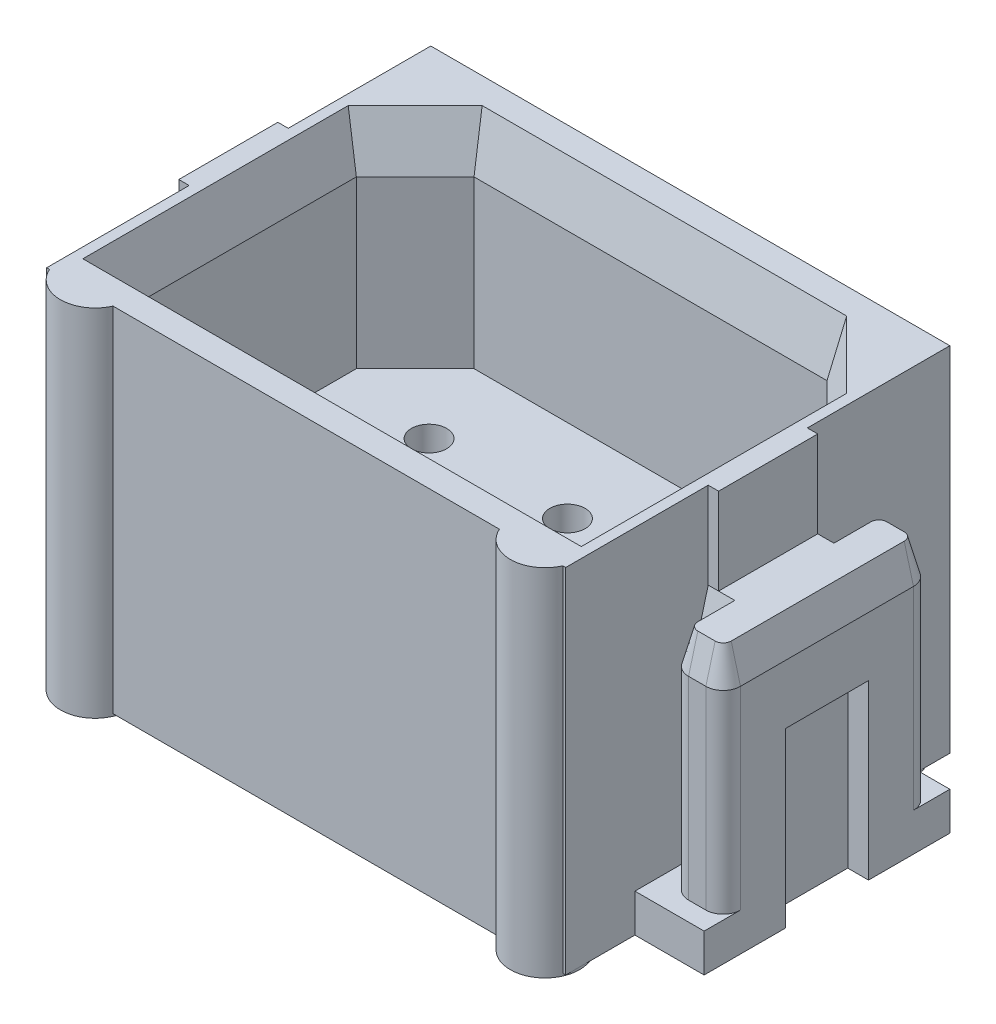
ISO-10303-21;
HEADER;
FILE_DESCRIPTION(('STEP AP214'),'2;1');
FILE_NAME('part.step','',(''),(''),'','','');
FILE_SCHEMA(('AUTOMOTIVE_DESIGN { 1 0 10303 214 1 1 1 1 }'));
ENDSEC;
DATA;
#1=APPLICATION_CONTEXT('core data for automotive mechanical design processes');
#2=APPLICATION_PROTOCOL_DEFINITION('international standard','automotive_design',2000,#1);
#3=PRODUCT_CONTEXT('',#1,'mechanical');
#4=PRODUCT('Part','Part','',(#3));
#5=PRODUCT_RELATED_PRODUCT_CATEGORY('part','',(#4));
#6=PRODUCT_DEFINITION_FORMATION('','',#4);
#7=PRODUCT_DEFINITION_CONTEXT('part definition',#1,'design');
#8=PRODUCT_DEFINITION('design','',#6,#7);
#9=PRODUCT_DEFINITION_SHAPE('','',#8);
#10=(LENGTH_UNIT() NAMED_UNIT(*) SI_UNIT(.MILLI.,.METRE.));
#11=(NAMED_UNIT(*) PLANE_ANGLE_UNIT() SI_UNIT($,.RADIAN.));
#12=(NAMED_UNIT(*) SI_UNIT($,.STERADIAN.) SOLID_ANGLE_UNIT());
#13=UNCERTAINTY_MEASURE_WITH_UNIT(LENGTH_MEASURE(1.E-05),#10,'distance_accuracy_value','');
#14=(GEOMETRIC_REPRESENTATION_CONTEXT(3) GLOBAL_UNCERTAINTY_ASSIGNED_CONTEXT((#13)) GLOBAL_UNIT_ASSIGNED_CONTEXT((#10,
#11,#12)) REPRESENTATION_CONTEXT('',''));
#15=CARTESIAN_POINT('',(0.,0.,0.));
#16=DIRECTION('',(0.,0.,1.));
#17=DIRECTION('',(1.,0.,0.));
#18=AXIS2_PLACEMENT_3D('',#15,#16,#17);
#19=CARTESIAN_POINT('',(-3.885126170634,3.85,1.420666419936));
#20=DIRECTION('',(0.,-1.,0.));
#21=DIRECTION('',(-1.,0.,0.));
#22=AXIS2_PLACEMENT_3D('',#19,#20,#21);
#23=PLANE('',#22);
#24=DIRECTION('',(0.,0.,1.));
#25=VECTOR('',#24,1.);
#26=CARTESIAN_POINT('',(-4.133974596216,3.85,0.));
#27=LINE('',#26,#25);
#28=CARTESIAN_POINT('',(-4.13397459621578,3.84999999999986,-1.25000000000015));
#29=VERTEX_POINT('',#28);
#30=CARTESIAN_POINT('',(-4.13397459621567,3.85,-0.716025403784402));
#31=VERTEX_POINT('',#30);
#32=EDGE_CURVE('E546',#29,#31,#27,.T.);
#33=ORIENTED_EDGE('',*,*,#32,.F.);
#34=CARTESIAN_POINT('',(-4.25,3.84999999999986,-1.25));
#35=DIRECTION('',(0.,-1.,0.));
#36=DIRECTION('',(0.,0.,-1.));
#37=AXIS2_PLACEMENT_3D('',#34,#35,#36);
#38=CIRCLE('',#37,0.116025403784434);
#39=CARTESIAN_POINT('',(-4.24999999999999,3.84999999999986,-1.36602540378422));
#40=VERTEX_POINT('',#39);
#41=EDGE_CURVE('E825',#40,#29,#38,.T.);
#42=ORIENTED_EDGE('',*,*,#41,.F.);
#43=DIRECTION('',(1.,0.,0.));
#44=VECTOR('',#43,1.);
#45=CARTESIAN_POINT('',(-4.258012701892,3.85,-1.366025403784));
#46=LINE('',#45,#44);
#47=CARTESIAN_POINT('',(-4.50000000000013,3.84999999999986,-1.36602540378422));
#48=VERTEX_POINT('',#47);
#49=EDGE_CURVE('E528',#48,#40,#46,.T.);
#50=ORIENTED_EDGE('',*,*,#49,.F.);
#51=CARTESIAN_POINT('',(-4.5,3.84999999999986,-1.25));
#52=DIRECTION('',(0.,-1.,0.));
#53=DIRECTION('',(0.,0.,-1.));
#54=AXIS2_PLACEMENT_3D('',#51,#52,#53);
#55=CIRCLE('',#54,0.116025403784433);
#56=CARTESIAN_POINT('',(-4.61602540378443,3.84999999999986,-1.25));
#57=VERTEX_POINT('',#56);
#58=EDGE_CURVE('E525',#57,#48,#55,.T.);
#59=ORIENTED_EDGE('',*,*,#58,.F.);
#60=DIRECTION('',(0.,0.,1.));
#61=VECTOR('',#60,1.);
#62=CARTESIAN_POINT('',(-4.61602540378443,3.84999999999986,0.));
#63=LINE('',#62,#61);
#64=CARTESIAN_POINT('',(-4.61602540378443,3.84999999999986,1.25));
#65=VERTEX_POINT('',#64);
#66=EDGE_CURVE('E535',#57,#65,#63,.T.);
#67=ORIENTED_EDGE('',*,*,#66,.T.);
#68=CARTESIAN_POINT('',(-4.5,3.84999999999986,1.25));
#69=DIRECTION('',(0.,-1.,0.));
#70=DIRECTION('',(0.,0.,-1.));
#71=AXIS2_PLACEMENT_3D('',#68,#69,#70);
#72=CIRCLE('',#71,0.116025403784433);
#73=CARTESIAN_POINT('',(-4.50000000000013,3.84999999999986,1.36602540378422));
#74=VERTEX_POINT('',#73);
#75=EDGE_CURVE('E523',#74,#65,#72,.T.);
#76=ORIENTED_EDGE('',*,*,#75,.F.);
#77=DIRECTION('',(-1.,0.,0.));
#78=VECTOR('',#77,1.);
#79=CARTESIAN_POINT('',(-4.258012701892,3.85,1.366025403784));
#80=LINE('',#79,#78);
#81=CARTESIAN_POINT('',(-4.25000000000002,3.84999999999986,1.36602540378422));
#82=VERTEX_POINT('',#81);
#83=EDGE_CURVE('E509',#82,#74,#80,.T.);
#84=ORIENTED_EDGE('',*,*,#83,.F.);
#85=CARTESIAN_POINT('',(-4.25,3.84999999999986,1.25));
#86=DIRECTION('',(0.,-1.,0.));
#87=DIRECTION('',(0.,0.,-1.));
#88=AXIS2_PLACEMENT_3D('',#85,#86,#87);
#89=CIRCLE('',#88,0.116025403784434);
#90=CARTESIAN_POINT('',(-4.13397459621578,3.84999999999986,1.25000000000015));
#91=VERTEX_POINT('',#90);
#92=EDGE_CURVE('E21',#91,#82,#89,.T.);
#93=ORIENTED_EDGE('',*,*,#92,.F.);
#94=DIRECTION('',(0.,0.,1.));
#95=VECTOR('',#94,1.);
#96=CARTESIAN_POINT('',(-4.133974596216,3.85,0.));
#97=LINE('',#96,#95);
#98=CARTESIAN_POINT('',(-4.13397459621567,3.85,0.716025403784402));
#99=VERTEX_POINT('',#98);
#100=EDGE_CURVE('E496',#99,#91,#97,.T.);
#101=ORIENTED_EDGE('',*,*,#100,.F.);
#102=DIRECTION('',(-1.,0.,0.));
#103=VECTOR('',#102,1.);
#104=CARTESIAN_POINT('',(-4.258012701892,3.85,0.7160254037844));
#105=LINE('',#104,#103);
#106=CARTESIAN_POINT('',(-3.9,3.85,0.716025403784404));
#107=VERTEX_POINT('',#106);
#108=EDGE_CURVE('E531',#107,#99,#105,.T.);
#109=ORIENTED_EDGE('',*,*,#108,.F.);
#110=DIRECTION('',(0.,0.,1.));
#111=VECTOR('',#110,1.);
#112=CARTESIAN_POINT('',(-3.9,3.85,0.));
#113=LINE('',#112,#111);
#114=CARTESIAN_POINT('',(-3.90000000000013,3.85,-0.7160254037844));
#115=VERTEX_POINT('',#114);
#116=EDGE_CURVE('E539',#115,#107,#113,.T.);
#117=ORIENTED_EDGE('',*,*,#116,.F.);
#118=DIRECTION('',(1.,0.,0.));
#119=VECTOR('',#118,1.);
#120=CARTESIAN_POINT('',(-4.258012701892,3.85,-0.7160254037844));
#121=LINE('',#120,#119);
#122=EDGE_CURVE('E543',#31,#115,#121,.T.);
#123=ORIENTED_EDGE('',*,*,#122,.F.);
#124=EDGE_LOOP('',(#33,#42,#50,#59,#67,#76,#84,#93,#101,#109,#117,#123));
#125=FACE_BOUND('',#124,.T.);
#126=ADVANCED_FACE('F17',(#125),#23,.F.);
#127=CARTESIAN_POINT('',(-4.45,2.601,-0.624));
#128=DIRECTION('',(-1.,0.,0.));
#129=DIRECTION('',(0.,-1.,0.));
#130=AXIS2_PLACEMENT_3D('',#127,#128,#129);
#131=PLANE('',#130);
#132=DIRECTION('',(0.,0.,1.));
#133=VECTOR('',#132,1.);
#134=CARTESIAN_POINT('',(-4.4500000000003,2.54999999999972,0.));
#135=LINE('',#134,#133);
#136=CARTESIAN_POINT('',(-4.45000000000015,2.54999999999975,-0.6));
#137=VERTEX_POINT('',#136);
#138=CARTESIAN_POINT('',(-4.45000000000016,2.54999999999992,0.6));
#139=VERTEX_POINT('',#138);
#140=EDGE_CURVE('E854',#137,#139,#135,.T.);
#141=ORIENTED_EDGE('',*,*,#140,.F.);
#142=DIRECTION('',(0.,-1.,0.));
#143=VECTOR('',#142,1.);
#144=CARTESIAN_POINT('',(-4.45,1.275,-0.6));
#145=LINE('',#144,#143);
#146=CARTESIAN_POINT('',(-4.45,0.,-0.6));
#147=VERTEX_POINT('',#146);
#148=EDGE_CURVE('E532',#137,#147,#145,.T.);
#149=ORIENTED_EDGE('',*,*,#148,.T.);
#150=DIRECTION('',(0.,0.,1.));
#151=VECTOR('',#150,1.);
#152=CARTESIAN_POINT('',(-4.45,0.,0.));
#153=LINE('',#152,#151);
#154=CARTESIAN_POINT('',(-4.45,0.,0.6));
#155=VERTEX_POINT('',#154);
#156=EDGE_CURVE('E545',#147,#155,#153,.T.);
#157=ORIENTED_EDGE('',*,*,#156,.T.);
#158=DIRECTION('',(0.,-1.,0.));
#159=VECTOR('',#158,1.);
#160=CARTESIAN_POINT('',(-4.45,1.275,0.6));
#161=LINE('',#160,#159);
#162=EDGE_CURVE('E820',#139,#155,#161,.T.);
#163=ORIENTED_EDGE('',*,*,#162,.F.);
#164=EDGE_LOOP('',(#141,#149,#157,#163));
#165=FACE_BOUND('',#164,.T.);
#166=ADVANCED_FACE('F1639',(#165),#131,.T.);
#167=CARTESIAN_POINT('',(-4.764647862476,2.494519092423,-0.624));
#168=DIRECTION('',(0.173648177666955,-0.984807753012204,0.));
#169=DIRECTION('',(0.984807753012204,0.173648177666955,0.));
#170=AXIS2_PLACEMENT_3D('',#167,#168,#169);
#171=PLANE('',#170);
#172=ORIENTED_EDGE('',*,*,#140,.T.);
#173=DIRECTION('',(0.98480775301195,0.173648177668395,0.));
#174=VECTOR('',#173,1.);
#175=CARTESIAN_POINT('',(-4.75,2.497101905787,0.6));
#176=LINE('',#175,#174);
#177=CARTESIAN_POINT('',(-4.75,2.497101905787,0.6));
#178=VERTEX_POINT('',#177);
#179=EDGE_CURVE('E817',#178,#139,#176,.T.);
#180=ORIENTED_EDGE('',*,*,#179,.F.);
#181=DIRECTION('',(0.,0.,-1.));
#182=VECTOR('',#181,1.);
#183=CARTESIAN_POINT('',(-4.75,2.497101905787,0.));
#184=LINE('',#183,#182);
#185=CARTESIAN_POINT('',(-4.75,2.49710190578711,-0.6));
#186=VERTEX_POINT('',#185);
#187=EDGE_CURVE('E864',#178,#186,#184,.T.);
#188=ORIENTED_EDGE('',*,*,#187,.T.);
#189=DIRECTION('',(0.984807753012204,0.173648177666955,0.));
#190=VECTOR('',#189,1.);
#191=CARTESIAN_POINT('',(-4.764647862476,2.494519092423,-0.6));
#192=LINE('',#191,#190);
#193=EDGE_CURVE('E536',#186,#137,#192,.T.);
#194=ORIENTED_EDGE('',*,*,#193,.T.);
#195=EDGE_LOOP('',(#172,#180,#188,#194));
#196=FACE_BOUND('',#195,.T.);
#197=ADVANCED_FACE('F1935',(#196),#171,.T.);
#198=CARTESIAN_POINT('',(-4.435126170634,-0.051,-0.6));
#199=DIRECTION('',(0.,0.,-1.));
#200=DIRECTION('',(-1.,0.,0.));
#201=AXIS2_PLACEMENT_3D('',#198,#199,#200);
#202=PLANE('',#201);
#203=ORIENTED_EDGE('',*,*,#193,.F.);
#204=DIRECTION('',(0.,-1.,0.));
#205=VECTOR('',#204,1.);
#206=CARTESIAN_POINT('',(-4.75,1.675,-0.6));
#207=LINE('',#206,#205);
#208=CARTESIAN_POINT('',(-4.75,0.,-0.6));
#209=VERTEX_POINT('',#208);
#210=EDGE_CURVE('E866',#186,#209,#207,.T.);
#211=ORIENTED_EDGE('',*,*,#210,.T.);
#212=DIRECTION('',(-1.,0.,0.));
#213=VECTOR('',#212,1.);
#214=CARTESIAN_POINT('',(-4.6,0.,-0.6));
#215=LINE('',#214,#213);
#216=EDGE_CURVE('E824',#147,#209,#215,.T.);
#217=ORIENTED_EDGE('',*,*,#216,.F.);
#218=ORIENTED_EDGE('',*,*,#148,.F.);
#219=EDGE_LOOP('',(#203,#211,#217,#218));
#220=FACE_BOUND('',#219,.T.);
#221=ADVANCED_FACE('F1642',(#220),#202,.F.);
#222=CARTESIAN_POINT('',(-4.612175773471,3.86436701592,-1.3));
#223=DIRECTION('',(0.965925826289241,-0.258819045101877,0.));
#224=DIRECTION('',(0.,0.,1.));
#225=AXIS2_PLACEMENT_3D('',#222,#223,#224);
#226=PLANE('',#225);
#227=DIRECTION('',(0.,0.,1.));
#228=VECTOR('',#227,1.);
#229=CARTESIAN_POINT('',(-4.75,3.35,0.));
#230=LINE('',#229,#228);
#231=CARTESIAN_POINT('',(-4.74999999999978,3.3500000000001,-1.25));
#232=VERTEX_POINT('',#231);
#233=CARTESIAN_POINT('',(-4.74999999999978,3.3500000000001,1.24999999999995));
#234=VERTEX_POINT('',#233);
#235=EDGE_CURVE('E953',#232,#234,#230,.T.);
#236=ORIENTED_EDGE('',*,*,#235,.T.);
#237=DIRECTION('',(-0.258819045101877,-0.965925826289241,0.));
#238=VECTOR('',#237,1.);
#239=CARTESIAN_POINT('',(-4.683012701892,3.6,1.25));
#240=LINE('',#239,#238);
#241=EDGE_CURVE('E853',#65,#234,#240,.T.);
#242=ORIENTED_EDGE('',*,*,#241,.F.);
#243=ORIENTED_EDGE('',*,*,#66,.F.);
#244=DIRECTION('',(0.258819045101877,0.965925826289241,0.));
#245=VECTOR('',#244,1.);
#246=CARTESIAN_POINT('',(-4.683012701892,3.6,-1.25));
#247=LINE('',#246,#245);
#248=EDGE_CURVE('E821',#232,#57,#247,.T.);
#249=ORIENTED_EDGE('',*,*,#248,.F.);
#250=EDGE_LOOP('',(#236,#242,#243,#249));
#251=FACE_BOUND('',#250,.T.);
#252=ADVANCED_FACE('F1929',(#251),#226,.F.);
#253=CARTESIAN_POINT('',(-4.435126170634,-0.051,0.6));
#254=DIRECTION('',(0.,0.,-1.));
#255=DIRECTION('',(-1.,0.,0.));
#256=AXIS2_PLACEMENT_3D('',#253,#254,#255);
#257=PLANE('',#256);
#258=ORIENTED_EDGE('',*,*,#162,.T.);
#259=DIRECTION('',(-1.,0.,0.));
#260=VECTOR('',#259,1.);
#261=CARTESIAN_POINT('',(-4.6,0.,0.6));
#262=LINE('',#261,#260);
#263=CARTESIAN_POINT('',(-4.75,0.,0.6));
#264=VERTEX_POINT('',#263);
#265=EDGE_CURVE('E863',#155,#264,#262,.T.);
#266=ORIENTED_EDGE('',*,*,#265,.T.);
#267=DIRECTION('',(0.,1.,0.));
#268=VECTOR('',#267,1.);
#269=CARTESIAN_POINT('',(-4.75,1.675,0.6));
#270=LINE('',#269,#268);
#271=EDGE_CURVE('E891',#264,#178,#270,.T.);
#272=ORIENTED_EDGE('',*,*,#271,.T.);
#273=ORIENTED_EDGE('',*,*,#179,.T.);
#274=EDGE_LOOP('',(#258,#266,#272,#273));
#275=FACE_BOUND('',#274,.T.);
#276=ADVANCED_FACE('F1634',(#275),#257,.T.);
#277=CARTESIAN_POINT('',(-4.75,3.417,-1.846));
#278=DIRECTION('',(1.,0.,0.));
#279=DIRECTION('',(0.,0.,1.));
#280=AXIS2_PLACEMENT_3D('',#277,#278,#279);
#281=PLANE('',#280);
#282=DIRECTION('',(0.,0.,-1.));
#283=VECTOR('',#282,1.);
#284=CARTESIAN_POINT('',(-4.75,0.,0.));
#285=LINE('',#284,#283);
#286=CARTESIAN_POINT('',(-4.75,0.,1.775));
#287=VERTEX_POINT('',#286);
#288=EDGE_CURVE('E895',#287,#264,#285,.T.);
#289=ORIENTED_EDGE('',*,*,#288,.F.);
#290=DIRECTION('',(0.,-1.,0.));
#291=VECTOR('',#290,1.);
#292=CARTESIAN_POINT('',(-4.75,1.675,1.775));
#293=LINE('',#292,#291);
#294=CARTESIAN_POINT('',(-4.75,0.55,1.775));
#295=VERTEX_POINT('',#294);
#296=EDGE_CURVE('E903',#295,#287,#293,.T.);
#297=ORIENTED_EDGE('',*,*,#296,.F.);
#298=DIRECTION('',(0.,0.,1.));
#299=VECTOR('',#298,1.);
#300=CARTESIAN_POINT('',(-4.75,0.55,0.));
#301=LINE('',#300,#299);
#302=CARTESIAN_POINT('',(-4.75,0.550000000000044,1.24999999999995));
#303=VERTEX_POINT('',#302);
#304=EDGE_CURVE('E907',#303,#295,#301,.T.);
#305=ORIENTED_EDGE('',*,*,#304,.F.);
#306=DIRECTION('',(0.,1.,0.));
#307=VECTOR('',#306,1.);
#308=CARTESIAN_POINT('',(-4.75,1.95,1.2499999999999));
#309=LINE('',#308,#307);
#310=EDGE_CURVE('E802',#303,#234,#309,.T.);
#311=ORIENTED_EDGE('',*,*,#310,.T.);
#312=ORIENTED_EDGE('',*,*,#235,.F.);
#313=DIRECTION('',(0.,-1.,0.));
#314=VECTOR('',#313,1.);
#315=CARTESIAN_POINT('',(-4.75,1.95,-1.25));
#316=LINE('',#315,#314);
#317=CARTESIAN_POINT('',(-4.75,0.550000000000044,-1.25));
#318=VERTEX_POINT('',#317);
#319=EDGE_CURVE('E798',#232,#318,#316,.T.);
#320=ORIENTED_EDGE('',*,*,#319,.T.);
#321=DIRECTION('',(0.,0.,1.));
#322=VECTOR('',#321,1.);
#323=CARTESIAN_POINT('',(-4.75,0.55,0.));
#324=LINE('',#323,#322);
#325=CARTESIAN_POINT('',(-4.75,0.55,-1.775));
#326=VERTEX_POINT('',#325);
#327=EDGE_CURVE('E882',#326,#318,#324,.T.);
#328=ORIENTED_EDGE('',*,*,#327,.F.);
#329=DIRECTION('',(0.,1.,0.));
#330=VECTOR('',#329,1.);
#331=CARTESIAN_POINT('',(-4.75,1.675,-1.775));
#332=LINE('',#331,#330);
#333=CARTESIAN_POINT('',(-4.75,0.,-1.775));
#334=VERTEX_POINT('',#333);
#335=EDGE_CURVE('E878',#334,#326,#332,.T.);
#336=ORIENTED_EDGE('',*,*,#335,.F.);
#337=DIRECTION('',(0.,0.,-1.));
#338=VECTOR('',#337,1.);
#339=CARTESIAN_POINT('',(-4.75,0.,0.));
#340=LINE('',#339,#338);
#341=EDGE_CURVE('E874',#209,#334,#340,.T.);
#342=ORIENTED_EDGE('',*,*,#341,.F.);
#343=ORIENTED_EDGE('',*,*,#210,.F.);
#344=ORIENTED_EDGE('',*,*,#187,.F.);
#345=ORIENTED_EDGE('',*,*,#271,.F.);
#346=EDGE_LOOP('',(#289,#297,#305,#311,#312,#320,#328,#336,#342,#343,#344,#345));
#347=FACE_BOUND('',#346,.T.);
#348=ADVANCED_FACE('F1629',(#347),#281,.F.);
#349=CARTESIAN_POINT('',(3.885126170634,3.85,1.420666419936));
#350=DIRECTION('',(0.,1.,0.));
#351=DIRECTION('',(1.,0.,0.));
#352=AXIS2_PLACEMENT_3D('',#349,#350,#351);
#353=PLANE('',#352);
#354=DIRECTION('',(0.,0.,1.));
#355=VECTOR('',#354,1.);
#356=CARTESIAN_POINT('',(4.133974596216,3.85,0.));
#357=LINE('',#356,#355);
#358=CARTESIAN_POINT('',(4.13397459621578,3.84999999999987,-1.25000000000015));
#359=VERTEX_POINT('',#358);
#360=CARTESIAN_POINT('',(4.1339745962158,3.85,-0.716025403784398));
#361=VERTEX_POINT('',#360);
#362=EDGE_CURVE('E807',#359,#361,#357,.T.);
#363=ORIENTED_EDGE('',*,*,#362,.T.);
#364=DIRECTION('',(-1.,0.,0.));
#365=VECTOR('',#364,1.);
#366=CARTESIAN_POINT('',(4.258012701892,3.85,-0.7160254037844));
#367=LINE('',#366,#365);
#368=CARTESIAN_POINT('',(3.9,3.85,-0.716025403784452));
#369=VERTEX_POINT('',#368);
#370=EDGE_CURVE('E945',#361,#369,#367,.T.);
#371=ORIENTED_EDGE('',*,*,#370,.T.);
#372=DIRECTION('',(0.,0.,1.));
#373=VECTOR('',#372,1.);
#374=CARTESIAN_POINT('',(3.9,3.85,0.));
#375=LINE('',#374,#373);
#376=CARTESIAN_POINT('',(3.9,3.85,0.716025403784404));
#377=VERTEX_POINT('',#376);
#378=EDGE_CURVE('E894',#369,#377,#375,.T.);
#379=ORIENTED_EDGE('',*,*,#378,.T.);
#380=DIRECTION('',(1.,0.,0.));
#381=VECTOR('',#380,1.);
#382=CARTESIAN_POINT('',(4.258012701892,3.85,0.7160254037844));
#383=LINE('',#382,#381);
#384=CARTESIAN_POINT('',(4.1339745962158,3.85,0.716025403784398));
#385=VERTEX_POINT('',#384);
#386=EDGE_CURVE('E920',#377,#385,#383,.T.);
#387=ORIENTED_EDGE('',*,*,#386,.T.);
#388=DIRECTION('',(0.,0.,1.));
#389=VECTOR('',#388,1.);
#390=CARTESIAN_POINT('',(4.133974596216,3.85,0.));
#391=LINE('',#390,#389);
#392=CARTESIAN_POINT('',(4.13397459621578,3.84999999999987,1.25000000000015));
#393=VERTEX_POINT('',#392);
#394=EDGE_CURVE('E816',#385,#393,#391,.T.);
#395=ORIENTED_EDGE('',*,*,#394,.T.);
#396=CARTESIAN_POINT('',(4.25,3.84999999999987,1.25));
#397=DIRECTION('',(0.,-1.,0.));
#398=DIRECTION('',(0.,0.,-1.));
#399=AXIS2_PLACEMENT_3D('',#396,#397,#398);
#400=CIRCLE('',#399,0.116025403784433);
#401=CARTESIAN_POINT('',(4.25000000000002,3.84999999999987,1.36602540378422));
#402=VERTEX_POINT('',#401);
#403=EDGE_CURVE('E813',#393,#402,#400,.F.);
#404=ORIENTED_EDGE('',*,*,#403,.T.);
#405=DIRECTION('',(1.,0.,0.));
#406=VECTOR('',#405,1.);
#407=CARTESIAN_POINT('',(4.258012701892,3.85,1.366025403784));
#408=LINE('',#407,#406);
#409=CARTESIAN_POINT('',(4.50000000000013,3.84999999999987,1.36602540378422));
#410=VERTEX_POINT('',#409);
#411=EDGE_CURVE('E812',#402,#410,#408,.T.);
#412=ORIENTED_EDGE('',*,*,#411,.T.);
#413=CARTESIAN_POINT('',(4.5,3.84999999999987,1.25));
#414=DIRECTION('',(0.,-1.,0.));
#415=DIRECTION('',(0.,0.,-1.));
#416=AXIS2_PLACEMENT_3D('',#413,#414,#415);
#417=CIRCLE('',#416,0.116025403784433);
#418=CARTESIAN_POINT('',(4.61602540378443,3.84999999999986,1.25));
#419=VERTEX_POINT('',#418);
#420=EDGE_CURVE('E793',#410,#419,#417,.F.);
#421=ORIENTED_EDGE('',*,*,#420,.T.);
#422=DIRECTION('',(0.,0.,-1.));
#423=VECTOR('',#422,1.);
#424=CARTESIAN_POINT('',(4.61602540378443,3.84999999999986,0.));
#425=LINE('',#424,#423);
#426=CARTESIAN_POINT('',(4.61602540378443,3.84999999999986,-1.25));
#427=VERTEX_POINT('',#426);
#428=EDGE_CURVE('E981',#419,#427,#425,.T.);
#429=ORIENTED_EDGE('',*,*,#428,.T.);
#430=CARTESIAN_POINT('',(4.5,3.84999999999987,-1.25));
#431=DIRECTION('',(0.,-1.,0.));
#432=DIRECTION('',(0.,0.,-1.));
#433=AXIS2_PLACEMENT_3D('',#430,#431,#432);
#434=CIRCLE('',#433,0.116025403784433);
#435=CARTESIAN_POINT('',(4.50000000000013,3.84999999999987,-1.36602540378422));
#436=VERTEX_POINT('',#435);
#437=EDGE_CURVE('E809',#427,#436,#434,.F.);
#438=ORIENTED_EDGE('',*,*,#437,.T.);
#439=DIRECTION('',(-1.,0.,0.));
#440=VECTOR('',#439,1.);
#441=CARTESIAN_POINT('',(4.258012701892,3.85,-1.366025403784));
#442=LINE('',#441,#440);
#443=CARTESIAN_POINT('',(4.24999999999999,3.84999999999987,-1.36602540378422));
#444=VERTEX_POINT('',#443);
#445=EDGE_CURVE('E808',#436,#444,#442,.T.);
#446=ORIENTED_EDGE('',*,*,#445,.T.);
#447=CARTESIAN_POINT('',(4.25,3.84999999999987,-1.25));
#448=DIRECTION('',(0.,-1.,0.));
#449=DIRECTION('',(0.,0.,-1.));
#450=AXIS2_PLACEMENT_3D('',#447,#448,#449);
#451=CIRCLE('',#450,0.116025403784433);
#452=EDGE_CURVE('E804',#444,#359,#451,.F.);
#453=ORIENTED_EDGE('',*,*,#452,.T.);
#454=EDGE_LOOP('',(#363,#371,#379,#387,#395,#404,#412,#421,#429,#438,#446,#453));
#455=FACE_BOUND('',#454,.T.);
#456=ADVANCED_FACE('F1920',(#455),#353,.T.);
#457=CARTESIAN_POINT('',(4.45,2.601,-0.624));
#458=DIRECTION('',(-1.,0.,0.));
#459=DIRECTION('',(0.,-1.,0.));
#460=AXIS2_PLACEMENT_3D('',#457,#458,#459);
#461=PLANE('',#460);
#462=DIRECTION('',(0.,0.,1.));
#463=VECTOR('',#462,1.);
#464=CARTESIAN_POINT('',(4.4500000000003,2.54999999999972,0.));
#465=LINE('',#464,#463);
#466=CARTESIAN_POINT('',(4.45000000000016,2.54999999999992,-0.6));
#467=VERTEX_POINT('',#466);
#468=CARTESIAN_POINT('',(4.45000000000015,2.54999999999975,0.6));
#469=VERTEX_POINT('',#468);
#470=EDGE_CURVE('E792',#467,#469,#465,.T.);
#471=ORIENTED_EDGE('',*,*,#470,.T.);
#472=DIRECTION('',(0.,-1.,0.));
#473=VECTOR('',#472,1.);
#474=CARTESIAN_POINT('',(4.45,1.275,0.6));
#475=LINE('',#474,#473);
#476=CARTESIAN_POINT('',(4.45,0.,0.6));
#477=VERTEX_POINT('',#476);
#478=EDGE_CURVE('E782',#469,#477,#475,.T.);
#479=ORIENTED_EDGE('',*,*,#478,.T.);
#480=DIRECTION('',(0.,0.,1.));
#481=VECTOR('',#480,1.);
#482=CARTESIAN_POINT('',(4.45,0.,0.));
#483=LINE('',#482,#481);
#484=CARTESIAN_POINT('',(4.45,0.,-0.6));
#485=VERTEX_POINT('',#484);
#486=EDGE_CURVE('E803',#485,#477,#483,.T.);
#487=ORIENTED_EDGE('',*,*,#486,.F.);
#488=DIRECTION('',(0.,-1.,0.));
#489=VECTOR('',#488,1.);
#490=CARTESIAN_POINT('',(4.45,1.275,-0.6));
#491=LINE('',#490,#489);
#492=EDGE_CURVE('E791',#467,#485,#491,.T.);
#493=ORIENTED_EDGE('',*,*,#492,.F.);
#494=EDGE_LOOP('',(#471,#479,#487,#493));
#495=FACE_BOUND('',#494,.T.);
#496=ADVANCED_FACE('F1916',(#495),#461,.F.);
#497=CARTESIAN_POINT('',(-4.5,3.35,1.25));
#498=DIRECTION('',(0.,-1.,0.));
#499=DIRECTION('',(0.,0.,-1.));
#500=AXIS2_PLACEMENT_3D('',#497,#498,#499);
#501=CYLINDRICAL_SURFACE('',#500,0.249999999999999);
#502=CARTESIAN_POINT('',(-4.5,3.35000000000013,1.25));
#503=DIRECTION('',(0.,-1.,0.));
#504=DIRECTION('',(-1.,0.,0.));
#505=AXIS2_PLACEMENT_3D('',#502,#503,#504);
#506=CIRCLE('',#505,0.249999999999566);
#507=CARTESIAN_POINT('',(-4.50000000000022,3.35000000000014,1.49999999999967));
#508=VERTEX_POINT('',#507);
#509=EDGE_CURVE('E799',#508,#234,#506,.T.);
#510=ORIENTED_EDGE('',*,*,#509,.T.);
#511=ORIENTED_EDGE('',*,*,#310,.F.);
#512=CARTESIAN_POINT('',(-4.5,0.550000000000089,1.25));
#513=DIRECTION('',(0.,-1.,0.));
#514=DIRECTION('',(0.,0.,-1.));
#515=AXIS2_PLACEMENT_3D('',#512,#513,#514);
#516=CIRCLE('',#515,0.249999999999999);
#517=CARTESIAN_POINT('',(-4.50000000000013,0.550000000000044,1.5));
#518=VERTEX_POINT('',#517);
#519=EDGE_CURVE('E800',#518,#303,#516,.T.);
#520=ORIENTED_EDGE('',*,*,#519,.F.);
#521=DIRECTION('',(0.,1.,0.));
#522=VECTOR('',#521,1.);
#523=CARTESIAN_POINT('',(-4.50000000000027,1.95,1.5));
#524=LINE('',#523,#522);
#525=EDGE_CURVE('E1002',#518,#508,#524,.T.);
#526=ORIENTED_EDGE('',*,*,#525,.T.);
#527=EDGE_LOOP('',(#510,#511,#520,#526));
#528=FACE_BOUND('',#527,.T.);
#529=ADVANCED_FACE('F1919',(#528),#501,.T.);
#530=CARTESIAN_POINT('',(-4.5,3.84999999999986,1.25));
#531=DIRECTION('',(0.,-1.,0.));
#532=DIRECTION('',(0.,0.,-1.));
#533=AXIS2_PLACEMENT_3D('',#530,#531,#532);
#534=CONICAL_SURFACE('',#533,0.116025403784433,0.261799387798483);
#535=ORIENTED_EDGE('',*,*,#509,.F.);
#536=DIRECTION('',(0.,-0.965925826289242,0.258819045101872));
#537=VECTOR('',#536,1.);
#538=CARTESIAN_POINT('',(-4.50000000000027,3.6,1.433012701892));
#539=LINE('',#538,#537);
#540=EDGE_CURVE('E1000',#74,#508,#539,.T.);
#541=ORIENTED_EDGE('',*,*,#540,.F.);
#542=ORIENTED_EDGE('',*,*,#75,.T.);
#543=ORIENTED_EDGE('',*,*,#241,.T.);
#544=EDGE_LOOP('',(#535,#541,#542,#543));
#545=FACE_BOUND('',#544,.T.);
#546=ADVANCED_FACE('F1945',(#545),#534,.T.);
#547=CARTESIAN_POINT('',(-4.5,3.35,-1.25));
#548=DIRECTION('',(0.,-1.,0.));
#549=DIRECTION('',(0.,0.,-1.));
#550=AXIS2_PLACEMENT_3D('',#547,#548,#549);
#551=CYLINDRICAL_SURFACE('',#550,0.249999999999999);
#552=CARTESIAN_POINT('',(-4.5,3.35000000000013,-1.25));
#553=DIRECTION('',(0.,-1.,0.));
#554=DIRECTION('',(-1.,0.,0.));
#555=AXIS2_PLACEMENT_3D('',#552,#553,#554);
#556=CIRCLE('',#555,0.249999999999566);
#557=CARTESIAN_POINT('',(-4.50000000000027,3.35000000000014,-1.49999999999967));
#558=VERTEX_POINT('',#557);
#559=EDGE_CURVE('E795',#232,#558,#556,.T.);
#560=ORIENTED_EDGE('',*,*,#559,.T.);
#561=DIRECTION('',(0.,-1.,0.));
#562=VECTOR('',#561,1.);
#563=CARTESIAN_POINT('',(-4.50000000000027,1.95,-1.5));
#564=LINE('',#563,#562);
#565=CARTESIAN_POINT('',(-4.50000000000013,0.550000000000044,-1.5));
#566=VERTEX_POINT('',#565);
#567=EDGE_CURVE('E1016',#558,#566,#564,.T.);
#568=ORIENTED_EDGE('',*,*,#567,.T.);
#569=CARTESIAN_POINT('',(-4.5,0.550000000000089,-1.25));
#570=DIRECTION('',(0.,-1.,0.));
#571=DIRECTION('',(0.,0.,-1.));
#572=AXIS2_PLACEMENT_3D('',#569,#570,#571);
#573=CIRCLE('',#572,0.249999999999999);
#574=EDGE_CURVE('E796',#318,#566,#573,.T.);
#575=ORIENTED_EDGE('',*,*,#574,.F.);
#576=ORIENTED_EDGE('',*,*,#319,.F.);
#577=EDGE_LOOP('',(#560,#568,#575,#576));
#578=FACE_BOUND('',#577,.T.);
#579=ADVANCED_FACE('F1949',(#578),#551,.T.);
#580=CARTESIAN_POINT('',(-4.5,3.84999999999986,-1.25));
#581=DIRECTION('',(0.,-1.,0.));
#582=DIRECTION('',(0.,0.,-1.));
#583=AXIS2_PLACEMENT_3D('',#580,#581,#582);
#584=CONICAL_SURFACE('',#583,0.116025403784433,0.261799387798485);
#585=ORIENTED_EDGE('',*,*,#559,.F.);
#586=ORIENTED_EDGE('',*,*,#248,.T.);
#587=ORIENTED_EDGE('',*,*,#58,.T.);
#588=DIRECTION('',(0.,0.965925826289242,0.258819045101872));
#589=VECTOR('',#588,1.);
#590=CARTESIAN_POINT('',(-4.50000000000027,3.6,-1.433012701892));
#591=LINE('',#590,#589);
#592=EDGE_CURVE('E839',#558,#48,#591,.T.);
#593=ORIENTED_EDGE('',*,*,#592,.F.);
#594=EDGE_LOOP('',(#585,#586,#587,#593));
#595=FACE_BOUND('',#594,.T.);
#596=ADVANCED_FACE('F1953',(#595),#584,.T.);
#597=CARTESIAN_POINT('',(4.5,3.35000000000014,1.25));
#598=DIRECTION('',(0.,-1.,0.));
#599=DIRECTION('',(0.,0.,-1.));
#600=AXIS2_PLACEMENT_3D('',#597,#598,#599);
#601=CONICAL_SURFACE('',#600,0.249999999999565,0.261799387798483);
#602=CARTESIAN_POINT('',(4.5,3.34999999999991,1.25));
#603=DIRECTION('',(0.,1.,0.));
#604=DIRECTION('',(1.,0.,0.));
#605=AXIS2_PLACEMENT_3D('',#602,#603,#604);
#606=CIRCLE('',#605,0.249999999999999);
#607=CARTESIAN_POINT('',(4.50000000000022,3.35000000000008,1.49999999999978));
#608=VERTEX_POINT('',#607);
#609=CARTESIAN_POINT('',(4.74999999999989,3.35000000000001,1.25));
#610=VERTEX_POINT('',#609);
#611=EDGE_CURVE('E786',#608,#610,#606,.T.);
#612=ORIENTED_EDGE('',*,*,#611,.T.);
#613=DIRECTION('',(-0.258819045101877,0.965925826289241,0.));
#614=VECTOR('',#613,1.);
#615=CARTESIAN_POINT('',(4.683012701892,3.6,1.25));
#616=LINE('',#615,#614);
#617=EDGE_CURVE('E787',#610,#419,#616,.T.);
#618=ORIENTED_EDGE('',*,*,#617,.T.);
#619=ORIENTED_EDGE('',*,*,#420,.F.);
#620=DIRECTION('',(0.,-0.965925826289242,0.258819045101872));
#621=VECTOR('',#620,1.);
#622=CARTESIAN_POINT('',(4.50000000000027,3.6,1.433012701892));
#623=LINE('',#622,#621);
#624=EDGE_CURVE('E1022',#410,#608,#623,.T.);
#625=ORIENTED_EDGE('',*,*,#624,.T.);
#626=EDGE_LOOP('',(#612,#618,#619,#625));
#627=FACE_BOUND('',#626,.T.);
#628=ADVANCED_FACE('F1914',(#627),#601,.T.);
#629=CARTESIAN_POINT('',(4.764647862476,2.494519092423,-0.624));
#630=DIRECTION('',(0.173648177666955,0.984807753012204,0.));
#631=DIRECTION('',(-0.984807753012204,0.173648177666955,0.));
#632=AXIS2_PLACEMENT_3D('',#629,#630,#631);
#633=PLANE('',#632);
#634=ORIENTED_EDGE('',*,*,#470,.F.);
#635=DIRECTION('',(-0.98480775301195,0.173648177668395,0.));
#636=VECTOR('',#635,1.);
#637=CARTESIAN_POINT('',(4.75,2.497101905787,-0.6));
#638=LINE('',#637,#636);
#639=CARTESIAN_POINT('',(4.75,2.497101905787,-0.6));
#640=VERTEX_POINT('',#639);
#641=EDGE_CURVE('E788',#640,#467,#638,.T.);
#642=ORIENTED_EDGE('',*,*,#641,.F.);
#643=DIRECTION('',(0.,0.,-1.));
#644=VECTOR('',#643,1.);
#645=CARTESIAN_POINT('',(4.75,2.497101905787,0.));
#646=LINE('',#645,#644);
#647=CARTESIAN_POINT('',(4.75,2.49710190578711,0.6));
#648=VERTEX_POINT('',#647);
#649=EDGE_CURVE('E1031',#648,#640,#646,.T.);
#650=ORIENTED_EDGE('',*,*,#649,.F.);
#651=DIRECTION('',(-0.984807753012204,0.173648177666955,0.));
#652=VECTOR('',#651,1.);
#653=CARTESIAN_POINT('',(4.764647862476,2.494519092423,0.6));
#654=LINE('',#653,#652);
#655=EDGE_CURVE('E779',#648,#469,#654,.T.);
#656=ORIENTED_EDGE('',*,*,#655,.T.);
#657=EDGE_LOOP('',(#634,#642,#650,#656));
#658=FACE_BOUND('',#657,.T.);
#659=ADVANCED_FACE('F1910',(#658),#633,.F.);
#660=CARTESIAN_POINT('',(4.435126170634,-0.051,-0.6));
#661=DIRECTION('',(0.,0.,1.));
#662=DIRECTION('',(1.,0.,0.));
#663=AXIS2_PLACEMENT_3D('',#660,#661,#662);
#664=PLANE('',#663);
#665=ORIENTED_EDGE('',*,*,#492,.T.);
#666=DIRECTION('',(1.,0.,0.));
#667=VECTOR('',#666,1.);
#668=CARTESIAN_POINT('',(4.6,0.,-0.6));
#669=LINE('',#668,#667);
#670=CARTESIAN_POINT('',(4.75,0.,-0.6));
#671=VERTEX_POINT('',#670);
#672=EDGE_CURVE('E973',#485,#671,#669,.T.);
#673=ORIENTED_EDGE('',*,*,#672,.T.);
#674=DIRECTION('',(0.,-1.,0.));
#675=VECTOR('',#674,1.);
#676=CARTESIAN_POINT('',(4.75,1.675,-0.6));
#677=LINE('',#676,#675);
#678=EDGE_CURVE('E1034',#640,#671,#677,.T.);
#679=ORIENTED_EDGE('',*,*,#678,.F.);
#680=ORIENTED_EDGE('',*,*,#641,.T.);
#681=EDGE_LOOP('',(#665,#673,#679,#680));
#682=FACE_BOUND('',#681,.T.);
#683=ADVANCED_FACE('F1906',(#682),#664,.T.);
#684=CARTESIAN_POINT('',(4.612175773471,3.86436701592,1.3));
#685=DIRECTION('',(-0.965925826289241,-0.258819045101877,0.));
#686=DIRECTION('',(0.,0.,-1.));
#687=AXIS2_PLACEMENT_3D('',#684,#685,#686);
#688=PLANE('',#687);
#689=DIRECTION('',(0.,0.,1.));
#690=VECTOR('',#689,1.);
#691=CARTESIAN_POINT('',(4.75,3.35,0.));
#692=LINE('',#691,#690);
#693=CARTESIAN_POINT('',(4.74999999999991,3.34999999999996,-1.25));
#694=VERTEX_POINT('',#693);
#695=EDGE_CURVE('E1074',#694,#610,#692,.T.);
#696=ORIENTED_EDGE('',*,*,#695,.F.);
#697=DIRECTION('',(0.258819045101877,-0.965925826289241,0.));
#698=VECTOR('',#697,1.);
#699=CARTESIAN_POINT('',(4.683012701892,3.6,-1.25));
#700=LINE('',#699,#698);
#701=EDGE_CURVE('E984',#427,#694,#700,.T.);
#702=ORIENTED_EDGE('',*,*,#701,.F.);
#703=ORIENTED_EDGE('',*,*,#428,.F.);
#704=ORIENTED_EDGE('',*,*,#617,.F.);
#705=EDGE_LOOP('',(#696,#702,#703,#704));
#706=FACE_BOUND('',#705,.T.);
#707=ADVANCED_FACE('F1903',(#706),#688,.F.);
#708=CARTESIAN_POINT('',(4.5,0.550000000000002,1.25));
#709=DIRECTION('',(0.,1.,0.));
#710=DIRECTION('',(0.,0.,1.));
#711=AXIS2_PLACEMENT_3D('',#708,#709,#710);
#712=CYLINDRICAL_SURFACE('',#711,0.249999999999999);
#713=ORIENTED_EDGE('',*,*,#611,.F.);
#714=DIRECTION('',(0.,1.,0.));
#715=VECTOR('',#714,1.);
#716=CARTESIAN_POINT('',(4.50000000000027,1.95,1.5));
#717=LINE('',#716,#715);
#718=CARTESIAN_POINT('',(4.50000000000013,0.550000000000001,1.5));
#719=VERTEX_POINT('',#718);
#720=EDGE_CURVE('E1026',#719,#608,#717,.T.);
#721=ORIENTED_EDGE('',*,*,#720,.F.);
#722=CARTESIAN_POINT('',(4.5,0.550000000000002,1.25));
#723=DIRECTION('',(0.,1.,0.));
#724=DIRECTION('',(0.,0.,1.));
#725=AXIS2_PLACEMENT_3D('',#722,#723,#724);
#726=CIRCLE('',#725,0.249999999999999);
#727=CARTESIAN_POINT('',(4.75,0.550000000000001,1.25));
#728=VERTEX_POINT('',#727);
#729=EDGE_CURVE('E784',#728,#719,#726,.F.);
#730=ORIENTED_EDGE('',*,*,#729,.F.);
#731=DIRECTION('',(0.,-1.,0.));
#732=VECTOR('',#731,1.);
#733=CARTESIAN_POINT('',(4.75,1.675,1.25));
#734=LINE('',#733,#732);
#735=EDGE_CURVE('E1077',#610,#728,#734,.T.);
#736=ORIENTED_EDGE('',*,*,#735,.F.);
#737=EDGE_LOOP('',(#713,#721,#730,#736));
#738=FACE_BOUND('',#737,.T.);
#739=ADVANCED_FACE('F1568',(#738),#712,.T.);
#740=CARTESIAN_POINT('',(4.435126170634,-0.051,0.6));
#741=DIRECTION('',(0.,0.,1.));
#742=DIRECTION('',(1.,0.,0.));
#743=AXIS2_PLACEMENT_3D('',#740,#741,#742);
#744=PLANE('',#743);
#745=ORIENTED_EDGE('',*,*,#655,.F.);
#746=DIRECTION('',(0.,1.,0.));
#747=VECTOR('',#746,1.);
#748=CARTESIAN_POINT('',(4.75,1.675,0.6));
#749=LINE('',#748,#747);
#750=CARTESIAN_POINT('',(4.75,0.,0.6));
#751=VERTEX_POINT('',#750);
#752=EDGE_CURVE('E778',#751,#648,#749,.T.);
#753=ORIENTED_EDGE('',*,*,#752,.F.);
#754=DIRECTION('',(1.,0.,0.));
#755=VECTOR('',#754,1.);
#756=CARTESIAN_POINT('',(4.6,0.,0.6));
#757=LINE('',#756,#755);
#758=EDGE_CURVE('E783',#477,#751,#757,.T.);
#759=ORIENTED_EDGE('',*,*,#758,.F.);
#760=ORIENTED_EDGE('',*,*,#478,.F.);
#761=EDGE_LOOP('',(#745,#753,#759,#760));
#762=FACE_BOUND('',#761,.T.);
#763=ADVANCED_FACE('F1898',(#762),#744,.F.);
#764=CARTESIAN_POINT('',(-4.235126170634,0.494,1.5));
#765=DIRECTION('',(0.,0.,-1.));
#766=DIRECTION('',(-1.,0.,0.));
#767=AXIS2_PLACEMENT_3D('',#764,#765,#766);
#768=PLANE('',#767);
#769=DIRECTION('',(1.,0.,0.));
#770=VECTOR('',#769,1.);
#771=CARTESIAN_POINT('',(-4.375,3.35000000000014,1.49999999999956));
#772=LINE('',#771,#770);
#773=CARTESIAN_POINT('',(-4.25000000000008,3.35000000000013,1.49999999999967));
#774=VERTEX_POINT('',#773);
#775=EDGE_CURVE('E516',#508,#774,#772,.T.);
#776=ORIENTED_EDGE('',*,*,#775,.F.);
#777=ORIENTED_EDGE('',*,*,#525,.F.);
#778=DIRECTION('',(-1.,0.,0.));
#779=VECTOR('',#778,1.);
#780=CARTESIAN_POINT('',(-4.375,0.55,1.5));
#781=LINE('',#780,#779);
#782=CARTESIAN_POINT('',(-4.25000000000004,0.550000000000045,1.5));
#783=VERTEX_POINT('',#782);
#784=EDGE_CURVE('E992',#783,#518,#781,.T.);
#785=ORIENTED_EDGE('',*,*,#784,.F.);
#786=DIRECTION('',(0.,1.,0.));
#787=VECTOR('',#786,1.);
#788=CARTESIAN_POINT('',(-4.25000000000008,1.95,1.5));
#789=LINE('',#788,#787);
#790=EDGE_CURVE('E777',#783,#774,#789,.T.);
#791=ORIENTED_EDGE('',*,*,#790,.T.);
#792=EDGE_LOOP('',(#776,#777,#785,#791));
#793=FACE_BOUND('',#792,.T.);
#794=ADVANCED_FACE('F1895',(#793),#768,.F.);
#795=CARTESIAN_POINT('',(-4.235126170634,3.86436701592,1.362175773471));
#796=DIRECTION('',(0.,0.258819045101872,0.965925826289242));
#797=DIRECTION('',(-1.,0.,0.));
#798=AXIS2_PLACEMENT_3D('',#795,#796,#797);
#799=PLANE('',#798);
#800=ORIENTED_EDGE('',*,*,#775,.T.);
#801=DIRECTION('',(0.,0.965925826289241,-0.258819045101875));
#802=VECTOR('',#801,1.);
#803=CARTESIAN_POINT('',(-4.25000000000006,3.6,1.433012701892));
#804=LINE('',#803,#802);
#805=EDGE_CURVE('E505',#774,#82,#804,.T.);
#806=ORIENTED_EDGE('',*,*,#805,.T.);
#807=ORIENTED_EDGE('',*,*,#83,.T.);
#808=ORIENTED_EDGE('',*,*,#540,.T.);
#809=EDGE_LOOP('',(#800,#806,#807,#808));
#810=FACE_BOUND('',#809,.T.);
#811=ADVANCED_FACE('F512',(#810),#799,.T.);
#812=CARTESIAN_POINT('',(-4.514873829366,0.494,-1.5));
#813=DIRECTION('',(0.,0.,1.));
#814=DIRECTION('',(1.,0.,0.));
#815=AXIS2_PLACEMENT_3D('',#812,#813,#814);
#816=PLANE('',#815);
#817=DIRECTION('',(-1.,0.,0.));
#818=VECTOR('',#817,1.);
#819=CARTESIAN_POINT('',(-4.375,3.35000000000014,-1.49999999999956));
#820=LINE('',#819,#818);
#821=CARTESIAN_POINT('',(-4.24999999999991,3.35000000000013,-1.49999999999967));
#822=VERTEX_POINT('',#821);
#823=EDGE_CURVE('E1013',#822,#558,#820,.T.);
#824=ORIENTED_EDGE('',*,*,#823,.F.);
#825=DIRECTION('',(0.,-1.,0.));
#826=VECTOR('',#825,1.);
#827=CARTESIAN_POINT('',(-4.24999999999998,1.95,-1.5));
#828=LINE('',#827,#826);
#829=CARTESIAN_POINT('',(-4.24999999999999,0.550000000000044,-1.5));
#830=VERTEX_POINT('',#829);
#831=EDGE_CURVE('E774',#822,#830,#828,.T.);
#832=ORIENTED_EDGE('',*,*,#831,.T.);
#833=DIRECTION('',(1.,0.,0.));
#834=VECTOR('',#833,1.);
#835=CARTESIAN_POINT('',(-4.375,0.55,-1.5));
#836=LINE('',#835,#834);
#837=EDGE_CURVE('E1019',#566,#830,#836,.T.);
#838=ORIENTED_EDGE('',*,*,#837,.F.);
#839=ORIENTED_EDGE('',*,*,#567,.F.);
#840=EDGE_LOOP('',(#824,#832,#838,#839));
#841=FACE_BOUND('',#840,.T.);
#842=ADVANCED_FACE('F1889',(#841),#816,.F.);
#843=CARTESIAN_POINT('',(-4.514873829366,3.86436701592,-1.362175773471));
#844=DIRECTION('',(0.,0.258819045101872,-0.965925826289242));
#845=DIRECTION('',(1.,0.,0.));
#846=AXIS2_PLACEMENT_3D('',#843,#844,#845);
#847=PLANE('',#846);
#848=ORIENTED_EDGE('',*,*,#823,.T.);
#849=ORIENTED_EDGE('',*,*,#592,.T.);
#850=ORIENTED_EDGE('',*,*,#49,.T.);
#851=DIRECTION('',(0.,-0.965925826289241,-0.258819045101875));
#852=VECTOR('',#851,1.);
#853=CARTESIAN_POINT('',(-4.24999999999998,3.6,-1.433012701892));
#854=LINE('',#853,#852);
#855=EDGE_CURVE('E837',#40,#822,#854,.T.);
#856=ORIENTED_EDGE('',*,*,#855,.T.);
#857=EDGE_LOOP('',(#848,#849,#850,#856));
#858=FACE_BOUND('',#857,.T.);
#859=ADVANCED_FACE('F836',(#858),#847,.T.);
#860=CARTESIAN_POINT('',(4.235126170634,0.494,1.5));
#861=DIRECTION('',(0.,0.,1.));
#862=DIRECTION('',(1.,0.,0.));
#863=AXIS2_PLACEMENT_3D('',#860,#861,#862);
#864=PLANE('',#863);
#865=DIRECTION('',(-1.,0.,0.));
#866=VECTOR('',#865,1.);
#867=CARTESIAN_POINT('',(4.375,3.35000000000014,1.49999999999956));
#868=LINE('',#867,#866);
#869=CARTESIAN_POINT('',(4.24999999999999,3.35000000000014,1.49999999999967));
#870=VERTEX_POINT('',#869);
#871=EDGE_CURVE('E1025',#608,#870,#868,.T.);
#872=ORIENTED_EDGE('',*,*,#871,.T.);
#873=DIRECTION('',(0.,-1.,0.));
#874=VECTOR('',#873,1.);
#875=CARTESIAN_POINT('',(4.25000000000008,1.95,1.5));
#876=LINE('',#875,#874);
#877=CARTESIAN_POINT('',(4.25000000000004,0.550000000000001,1.5));
#878=VERTEX_POINT('',#877);
#879=EDGE_CURVE('E771',#870,#878,#876,.T.);
#880=ORIENTED_EDGE('',*,*,#879,.T.);
#881=DIRECTION('',(1.,0.,0.));
#882=VECTOR('',#881,1.);
#883=CARTESIAN_POINT('',(4.375,0.55,1.5));
#884=LINE('',#883,#882);
#885=EDGE_CURVE('E1012',#878,#719,#884,.T.);
#886=ORIENTED_EDGE('',*,*,#885,.T.);
#887=ORIENTED_EDGE('',*,*,#720,.T.);
#888=EDGE_LOOP('',(#872,#880,#886,#887));
#889=FACE_BOUND('',#888,.T.);
#890=ADVANCED_FACE('F1571',(#889),#864,.T.);
#891=CARTESIAN_POINT('',(4.235126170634,3.86436701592,1.362175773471));
#892=DIRECTION('',(0.,-0.258819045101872,-0.965925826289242));
#893=DIRECTION('',(1.,0.,0.));
#894=AXIS2_PLACEMENT_3D('',#891,#892,#893);
#895=PLANE('',#894);
#896=ORIENTED_EDGE('',*,*,#871,.F.);
#897=ORIENTED_EDGE('',*,*,#624,.F.);
#898=ORIENTED_EDGE('',*,*,#411,.F.);
#899=DIRECTION('',(0.,-0.965925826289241,0.258819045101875));
#900=VECTOR('',#899,1.);
#901=CARTESIAN_POINT('',(4.25000000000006,3.6,1.433012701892));
#902=LINE('',#901,#900);
#903=EDGE_CURVE('E1139',#402,#870,#902,.T.);
#904=ORIENTED_EDGE('',*,*,#903,.T.);
#905=EDGE_LOOP('',(#896,#897,#898,#904));
#906=FACE_BOUND('',#905,.T.);
#907=ADVANCED_FACE('F1881',(#906),#895,.F.);
#908=CARTESIAN_POINT('',(4.75,3.417,-1.846));
#909=DIRECTION('',(1.,0.,0.));
#910=DIRECTION('',(0.,0.,1.));
#911=AXIS2_PLACEMENT_3D('',#908,#909,#910);
#912=PLANE('',#911);
#913=DIRECTION('',(0.,0.,-1.));
#914=VECTOR('',#913,1.);
#915=CARTESIAN_POINT('',(4.75,0.,0.));
#916=LINE('',#915,#914);
#917=CARTESIAN_POINT('',(4.75,0.,1.775));
#918=VERTEX_POINT('',#917);
#919=EDGE_CURVE('E1104',#918,#751,#916,.T.);
#920=ORIENTED_EDGE('',*,*,#919,.T.);
#921=ORIENTED_EDGE('',*,*,#752,.T.);
#922=ORIENTED_EDGE('',*,*,#649,.T.);
#923=ORIENTED_EDGE('',*,*,#678,.T.);
#924=DIRECTION('',(0.,0.,-1.));
#925=VECTOR('',#924,1.);
#926=CARTESIAN_POINT('',(4.75,0.,0.));
#927=LINE('',#926,#925);
#928=CARTESIAN_POINT('',(4.75,0.,-1.775));
#929=VERTEX_POINT('',#928);
#930=EDGE_CURVE('E1042',#671,#929,#927,.T.);
#931=ORIENTED_EDGE('',*,*,#930,.T.);
#932=DIRECTION('',(0.,1.,0.));
#933=VECTOR('',#932,1.);
#934=CARTESIAN_POINT('',(4.75,1.675,-1.775));
#935=LINE('',#934,#933);
#936=CARTESIAN_POINT('',(4.75,0.55,-1.775));
#937=VERTEX_POINT('',#936);
#938=EDGE_CURVE('E1047',#929,#937,#935,.T.);
#939=ORIENTED_EDGE('',*,*,#938,.T.);
#940=DIRECTION('',(0.,0.,1.));
#941=VECTOR('',#940,1.);
#942=CARTESIAN_POINT('',(4.75,0.55,0.));
#943=LINE('',#942,#941);
#944=CARTESIAN_POINT('',(4.75,0.550000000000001,-1.25));
#945=VERTEX_POINT('',#944);
#946=EDGE_CURVE('E1052',#937,#945,#943,.T.);
#947=ORIENTED_EDGE('',*,*,#946,.T.);
#948=DIRECTION('',(0.,1.,0.));
#949=VECTOR('',#948,1.);
#950=CARTESIAN_POINT('',(4.75,1.95,-1.25));
#951=LINE('',#950,#949);
#952=EDGE_CURVE('E767',#945,#694,#951,.T.);
#953=ORIENTED_EDGE('',*,*,#952,.T.);
#954=ORIENTED_EDGE('',*,*,#695,.T.);
#955=ORIENTED_EDGE('',*,*,#735,.T.);
#956=DIRECTION('',(0.,0.,1.));
#957=VECTOR('',#956,1.);
#958=CARTESIAN_POINT('',(4.75,0.55,0.));
#959=LINE('',#958,#957);
#960=CARTESIAN_POINT('',(4.75,0.55,1.775));
#961=VERTEX_POINT('',#960);
#962=EDGE_CURVE('E1085',#728,#961,#959,.T.);
#963=ORIENTED_EDGE('',*,*,#962,.T.);
#964=DIRECTION('',(0.,-1.,0.));
#965=VECTOR('',#964,1.);
#966=CARTESIAN_POINT('',(4.75,1.675,1.775));
#967=LINE('',#966,#965);
#968=EDGE_CURVE('E1090',#961,#918,#967,.T.);
#969=ORIENTED_EDGE('',*,*,#968,.T.);
#970=EDGE_LOOP('',(#920,#921,#922,#923,#931,#939,#947,#953,#954,#955,#963,#969));
#971=FACE_BOUND('',#970,.T.);
#972=ADVANCED_FACE('F1564',(#971),#912,.T.);
#973=CARTESIAN_POINT('',(-4.25,3.35,1.25));
#974=DIRECTION('',(0.,-1.,0.));
#975=DIRECTION('',(0.,0.,-1.));
#976=AXIS2_PLACEMENT_3D('',#973,#974,#975);
#977=CYLINDRICAL_SURFACE('',#976,0.25);
#978=CARTESIAN_POINT('',(-4.25,3.35000000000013,1.25));
#979=DIRECTION('',(0.,-1.,0.));
#980=DIRECTION('',(-1.,0.,0.));
#981=AXIS2_PLACEMENT_3D('',#978,#979,#980);
#982=CIRCLE('',#981,0.249999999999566);
#983=CARTESIAN_POINT('',(-4.00000000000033,3.35000000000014,1.25000000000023));
#984=VERTEX_POINT('',#983);
#985=EDGE_CURVE('E518',#984,#774,#982,.T.);
#986=ORIENTED_EDGE('',*,*,#985,.T.);
#987=ORIENTED_EDGE('',*,*,#790,.F.);
#988=CARTESIAN_POINT('',(-4.25,0.550000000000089,1.25));
#989=DIRECTION('',(0.,-1.,0.));
#990=DIRECTION('',(0.,0.,-1.));
#991=AXIS2_PLACEMENT_3D('',#988,#989,#990);
#992=CIRCLE('',#991,0.25);
#993=CARTESIAN_POINT('',(-4.,0.550000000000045,1.25000000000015));
#994=VERTEX_POINT('',#993);
#995=EDGE_CURVE('E775',#994,#783,#992,.T.);
#996=ORIENTED_EDGE('',*,*,#995,.F.);
#997=DIRECTION('',(0.,1.,0.));
#998=VECTOR('',#997,1.);
#999=CARTESIAN_POINT('',(-4.,1.95,1.25000000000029));
#1000=LINE('',#999,#998);
#1001=EDGE_CURVE('E1162',#994,#984,#1000,.T.);
#1002=ORIENTED_EDGE('',*,*,#1001,.T.);
#1003=EDGE_LOOP('',(#986,#987,#996,#1002));
#1004=FACE_BOUND('',#1003,.T.);
#1005=ADVANCED_FACE('F1880',(#1004),#977,.T.);
#1006=CARTESIAN_POINT('',(-4.25,3.84999999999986,1.25));
#1007=DIRECTION('',(0.,-1.,0.));
#1008=DIRECTION('',(0.,0.,-1.));
#1009=AXIS2_PLACEMENT_3D('',#1006,#1007,#1008);
#1010=CONICAL_SURFACE('',#1009,0.116025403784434,0.261799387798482);
#1011=ORIENTED_EDGE('',*,*,#985,.F.);
#1012=DIRECTION('',(0.258819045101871,-0.965925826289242,0.));
#1013=VECTOR('',#1012,1.);
#1014=CARTESIAN_POINT('',(-4.066987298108,3.6,1.25000000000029));
#1015=LINE('',#1014,#1013);
#1016=EDGE_CURVE('E506',#91,#984,#1015,.T.);
#1017=ORIENTED_EDGE('',*,*,#1016,.F.);
#1018=ORIENTED_EDGE('',*,*,#92,.T.);
#1019=ORIENTED_EDGE('',*,*,#805,.F.);
#1020=EDGE_LOOP('',(#1011,#1017,#1018,#1019));
#1021=FACE_BOUND('',#1020,.T.);
#1022=ADVANCED_FACE('F504',(#1021),#1010,.T.);
#1023=CARTESIAN_POINT('',(-4.25,3.35,-1.25));
#1024=DIRECTION('',(0.,-1.,0.));
#1025=DIRECTION('',(0.,0.,-1.));
#1026=AXIS2_PLACEMENT_3D('',#1023,#1024,#1025);
#1027=CYLINDRICAL_SURFACE('',#1026,0.25);
#1028=CARTESIAN_POINT('',(-4.25,3.35000000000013,-1.25));
#1029=DIRECTION('',(0.,-1.,0.));
#1030=DIRECTION('',(-1.,0.,0.));
#1031=AXIS2_PLACEMENT_3D('',#1028,#1029,#1030);
#1032=CIRCLE('',#1031,0.249999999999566);
#1033=CARTESIAN_POINT('',(-4.00000000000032,3.35000000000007,-1.25000000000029));
#1034=VERTEX_POINT('',#1033);
#1035=EDGE_CURVE('E772',#822,#1034,#1032,.T.);
#1036=ORIENTED_EDGE('',*,*,#1035,.T.);
#1037=DIRECTION('',(0.,-1.,0.));
#1038=VECTOR('',#1037,1.);
#1039=CARTESIAN_POINT('',(-4.,1.95,-1.25000000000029));
#1040=LINE('',#1039,#1038);
#1041=CARTESIAN_POINT('',(-4.,0.550000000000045,-1.25000000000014));
#1042=VERTEX_POINT('',#1041);
#1043=EDGE_CURVE('E1225',#1034,#1042,#1040,.T.);
#1044=ORIENTED_EDGE('',*,*,#1043,.T.);
#1045=CARTESIAN_POINT('',(-4.25,0.550000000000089,-1.25));
#1046=DIRECTION('',(0.,-1.,0.));
#1047=DIRECTION('',(0.,0.,-1.));
#1048=AXIS2_PLACEMENT_3D('',#1045,#1046,#1047);
#1049=CIRCLE('',#1048,0.25);
#1050=EDGE_CURVE('E517',#830,#1042,#1049,.T.);
#1051=ORIENTED_EDGE('',*,*,#1050,.F.);
#1052=ORIENTED_EDGE('',*,*,#831,.F.);
#1053=EDGE_LOOP('',(#1036,#1044,#1051,#1052));
#1054=FACE_BOUND('',#1053,.T.);
#1055=ADVANCED_FACE('F1967',(#1054),#1027,.T.);
#1056=CARTESIAN_POINT('',(-4.25,3.84999999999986,-1.25));
#1057=DIRECTION('',(0.,-1.,0.));
#1058=DIRECTION('',(0.,0.,-1.));
#1059=AXIS2_PLACEMENT_3D('',#1056,#1057,#1058);
#1060=CONICAL_SURFACE('',#1059,0.116025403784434,0.261799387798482);
#1061=ORIENTED_EDGE('',*,*,#1035,.F.);
#1062=ORIENTED_EDGE('',*,*,#855,.F.);
#1063=ORIENTED_EDGE('',*,*,#41,.T.);
#1064=DIRECTION('',(-0.258819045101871,0.965925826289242,0.));
#1065=VECTOR('',#1064,1.);
#1066=CARTESIAN_POINT('',(-4.066987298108,3.6,-1.25000000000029));
#1067=LINE('',#1066,#1065);
#1068=EDGE_CURVE('E1171',#1034,#29,#1067,.T.);
#1069=ORIENTED_EDGE('',*,*,#1068,.F.);
#1070=EDGE_LOOP('',(#1061,#1062,#1063,#1069));
#1071=FACE_BOUND('',#1070,.T.);
#1072=ADVANCED_FACE('F843',(#1071),#1060,.T.);
#1073=CARTESIAN_POINT('',(4.25,0.550000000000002,1.25));
#1074=DIRECTION('',(0.,1.,0.));
#1075=DIRECTION('',(0.,0.,1.));
#1076=AXIS2_PLACEMENT_3D('',#1073,#1074,#1075);
#1077=CYLINDRICAL_SURFACE('',#1076,0.25);
#1078=CARTESIAN_POINT('',(4.25,3.35000000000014,1.25));
#1079=DIRECTION('',(0.,1.,0.));
#1080=DIRECTION('',(1.,0.,0.));
#1081=AXIS2_PLACEMENT_3D('',#1078,#1079,#1080);
#1082=CIRCLE('',#1081,0.249999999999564);
#1083=CARTESIAN_POINT('',(4.00000000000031,3.35000000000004,1.25000000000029));
#1084=VERTEX_POINT('',#1083);
#1085=EDGE_CURVE('E768',#870,#1084,#1082,.F.);
#1086=ORIENTED_EDGE('',*,*,#1085,.T.);
#1087=DIRECTION('',(0.,1.,0.));
#1088=VECTOR('',#1087,1.);
#1089=CARTESIAN_POINT('',(4.,1.95,1.25000000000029));
#1090=LINE('',#1089,#1088);
#1091=CARTESIAN_POINT('',(4.,0.550000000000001,1.25000000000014));
#1092=VERTEX_POINT('',#1091);
#1093=EDGE_CURVE('E1173',#1092,#1084,#1090,.T.);
#1094=ORIENTED_EDGE('',*,*,#1093,.F.);
#1095=CARTESIAN_POINT('',(4.25,0.550000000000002,1.25));
#1096=DIRECTION('',(0.,1.,0.));
#1097=DIRECTION('',(0.,0.,1.));
#1098=AXIS2_PLACEMENT_3D('',#1095,#1096,#1097);
#1099=CIRCLE('',#1098,0.25);
#1100=EDGE_CURVE('E769',#878,#1092,#1099,.F.);
#1101=ORIENTED_EDGE('',*,*,#1100,.F.);
#1102=ORIENTED_EDGE('',*,*,#879,.F.);
#1103=EDGE_LOOP('',(#1086,#1094,#1101,#1102));
#1104=FACE_BOUND('',#1103,.T.);
#1105=ADVANCED_FACE('F1577',(#1104),#1077,.T.);
#1106=CARTESIAN_POINT('',(4.25,3.35000000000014,1.25));
#1107=DIRECTION('',(0.,-1.,0.));
#1108=DIRECTION('',(0.,0.,-1.));
#1109=AXIS2_PLACEMENT_3D('',#1106,#1107,#1108);
#1110=CONICAL_SURFACE('',#1109,0.249999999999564,0.26179938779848);
#1111=ORIENTED_EDGE('',*,*,#1085,.F.);
#1112=ORIENTED_EDGE('',*,*,#903,.F.);
#1113=ORIENTED_EDGE('',*,*,#403,.F.);
#1114=DIRECTION('',(-0.258819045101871,-0.965925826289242,0.));
#1115=VECTOR('',#1114,1.);
#1116=CARTESIAN_POINT('',(4.066987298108,3.6,1.25000000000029));
#1117=LINE('',#1116,#1115);
#1118=EDGE_CURVE('E1178',#393,#1084,#1117,.T.);
#1119=ORIENTED_EDGE('',*,*,#1118,.T.);
#1120=EDGE_LOOP('',(#1111,#1112,#1113,#1119));
#1121=FACE_BOUND('',#1120,.T.);
#1122=ADVANCED_FACE('F1975',(#1121),#1110,.T.);
#1123=CARTESIAN_POINT('',(4.5,3.35000000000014,-1.25));
#1124=DIRECTION('',(0.,-1.,0.));
#1125=DIRECTION('',(0.,0.,-1.));
#1126=AXIS2_PLACEMENT_3D('',#1123,#1124,#1125);
#1127=CONICAL_SURFACE('',#1126,0.249999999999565,0.261799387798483);
#1128=CARTESIAN_POINT('',(4.5,3.34999999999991,-1.25));
#1129=DIRECTION('',(0.,1.,0.));
#1130=DIRECTION('',(1.,0.,0.));
#1131=AXIS2_PLACEMENT_3D('',#1128,#1129,#1130);
#1132=CIRCLE('',#1131,0.249999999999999);
#1133=CARTESIAN_POINT('',(4.50000000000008,3.35000000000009,-1.49999999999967));
#1134=VERTEX_POINT('',#1133);
#1135=EDGE_CURVE('E1062',#694,#1134,#1132,.T.);
#1136=ORIENTED_EDGE('',*,*,#1135,.T.);
#1137=DIRECTION('',(0.,0.965925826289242,0.258819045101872));
#1138=VECTOR('',#1137,1.);
#1139=CARTESIAN_POINT('',(4.50000000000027,3.6,-1.433012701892));
#1140=LINE('',#1139,#1138);
#1141=EDGE_CURVE('E937',#1134,#436,#1140,.T.);
#1142=ORIENTED_EDGE('',*,*,#1141,.T.);
#1143=ORIENTED_EDGE('',*,*,#437,.F.);
#1144=ORIENTED_EDGE('',*,*,#701,.T.);
#1145=EDGE_LOOP('',(#1136,#1142,#1143,#1144));
#1146=FACE_BOUND('',#1145,.T.);
#1147=ADVANCED_FACE('F1978',(#1146),#1127,.T.);
#1148=CARTESIAN_POINT('',(4.5,0.550000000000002,-1.25));
#1149=DIRECTION('',(0.,1.,0.));
#1150=DIRECTION('',(0.,0.,1.));
#1151=AXIS2_PLACEMENT_3D('',#1148,#1149,#1150);
#1152=CYLINDRICAL_SURFACE('',#1151,0.249999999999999);
#1153=ORIENTED_EDGE('',*,*,#1135,.F.);
#1154=ORIENTED_EDGE('',*,*,#952,.F.);
#1155=CARTESIAN_POINT('',(4.5,0.550000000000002,-1.25));
#1156=DIRECTION('',(0.,1.,0.));
#1157=DIRECTION('',(0.,0.,1.));
#1158=AXIS2_PLACEMENT_3D('',#1155,#1156,#1157);
#1159=CIRCLE('',#1158,0.249999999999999);
#1160=CARTESIAN_POINT('',(4.50000000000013,0.550000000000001,-1.5));
#1161=VERTEX_POINT('',#1160);
#1162=EDGE_CURVE('E765',#1161,#945,#1159,.F.);
#1163=ORIENTED_EDGE('',*,*,#1162,.F.);
#1164=DIRECTION('',(0.,-1.,0.));
#1165=VECTOR('',#1164,1.);
#1166=CARTESIAN_POINT('',(4.50000000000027,1.95,-1.5));
#1167=LINE('',#1166,#1165);
#1168=EDGE_CURVE('E1186',#1134,#1161,#1167,.T.);
#1169=ORIENTED_EDGE('',*,*,#1168,.F.);
#1170=EDGE_LOOP('',(#1153,#1154,#1163,#1169));
#1171=FACE_BOUND('',#1170,.T.);
#1172=ADVANCED_FACE('F1982',(#1171),#1152,.T.);
#1173=CARTESIAN_POINT('',(-3.25,-0.0341452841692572,-2.275));
#1174=DIRECTION('',(0.,1.,0.));
#1175=DIRECTION('',(0.,0.,1.));
#1176=AXIS2_PLACEMENT_3D('',#1173,#1174,#1175);
#1177=CONICAL_SURFACE('',#1176,0.499999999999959,1.08210413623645);
#1178=CARTESIAN_POINT('',(-3.25,-0.3,-2.275));
#1179=VERTEX_POINT('',#1178);
#1180=VERTEX_LOOP('',#1179);
#1181=FACE_BOUND('',#1180,.T.);
#1182=CARTESIAN_POINT('',(-3.25,-0.0341452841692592,-2.275));
#1183=DIRECTION('',(0.,-1.,0.));
#1184=DIRECTION('',(0.,0.,1.));
#1185=AXIS2_PLACEMENT_3D('',#1182,#1183,#1184);
#1186=CIRCLE('',#1185,0.5);
#1187=CARTESIAN_POINT('',(-3.25,-0.0341452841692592,-1.775));
#1188=VERTEX_POINT('',#1187);
#1189=EDGE_CURVE('E1189',#1188,#1188,#1186,.T.);
#1190=ORIENTED_EDGE('',*,*,#1189,.T.);
#1191=EDGE_LOOP('',(#1190));
#1192=FACE_BOUND('',#1191,.T.);
#1193=ADVANCED_FACE('F1986',(#1181,#1192),#1177,.T.);
#1194=CARTESIAN_POINT('',(2.,0.180000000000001,-1.));
#1195=DIRECTION('',(0.,1.,0.));
#1196=DIRECTION('',(0.,0.,1.));
#1197=AXIS2_PLACEMENT_3D('',#1194,#1195,#1196);
#1198=CYLINDRICAL_SURFACE('',#1197,0.255);
#1199=CARTESIAN_POINT('',(2.,0.180000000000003,-1.));
#1200=DIRECTION('',(0.,1.,0.));
#1201=DIRECTION('',(-1.,0.,0.));
#1202=AXIS2_PLACEMENT_3D('',#1199,#1200,#1201);
#1203=CIRCLE('',#1202,0.254999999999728);
#1204=CARTESIAN_POINT('',(1.74500000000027,0.180000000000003,-1.));
#1205=VERTEX_POINT('',#1204);
#1206=EDGE_CURVE('E1193',#1205,#1205,#1203,.T.);
#1207=ORIENTED_EDGE('',*,*,#1206,.F.);
#1208=EDGE_LOOP('',(#1207));
#1209=FACE_BOUND('',#1208,.T.);
#1210=CARTESIAN_POINT('',(2.,1.94999999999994,-1.));
#1211=DIRECTION('',(0.,1.,0.));
#1212=DIRECTION('',(0.,0.,1.));
#1213=AXIS2_PLACEMENT_3D('',#1210,#1211,#1212);
#1214=CIRCLE('',#1213,0.255);
#1215=CARTESIAN_POINT('',(2.,1.94999999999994,-0.745));
#1216=VERTEX_POINT('',#1215);
#1217=EDGE_CURVE('E758',#1216,#1216,#1214,.T.);
#1218=ORIENTED_EDGE('',*,*,#1217,.T.);
#1219=EDGE_LOOP('',(#1218));
#1220=FACE_BOUND('',#1219,.T.);
#1221=ADVANCED_FACE('F1990',(#1209,#1220),#1198,.F.);
#1222=CARTESIAN_POINT('',(0.,0.180000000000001,-1.));
#1223=DIRECTION('',(0.,1.,0.));
#1224=DIRECTION('',(0.,0.,1.));
#1225=AXIS2_PLACEMENT_3D('',#1222,#1223,#1224);
#1226=CYLINDRICAL_SURFACE('',#1225,0.255);
#1227=CARTESIAN_POINT('',(0.,0.180000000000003,-1.));
#1228=DIRECTION('',(0.,1.,0.));
#1229=DIRECTION('',(-1.,0.,0.));
#1230=AXIS2_PLACEMENT_3D('',#1227,#1228,#1229);
#1231=CIRCLE('',#1230,0.254999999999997);
#1232=CARTESIAN_POINT('',(-0.254999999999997,0.180000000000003,-1.));
#1233=VERTEX_POINT('',#1232);
#1234=EDGE_CURVE('E1196',#1233,#1233,#1231,.T.);
#1235=ORIENTED_EDGE('',*,*,#1234,.F.);
#1236=EDGE_LOOP('',(#1235));
#1237=FACE_BOUND('',#1236,.T.);
#1238=CARTESIAN_POINT('',(0.,1.94999999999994,-1.));
#1239=DIRECTION('',(0.,1.,0.));
#1240=DIRECTION('',(0.,0.,1.));
#1241=AXIS2_PLACEMENT_3D('',#1238,#1239,#1240);
#1242=CIRCLE('',#1241,0.255);
#1243=CARTESIAN_POINT('',(0.,1.94999999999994,-0.745));
#1244=VERTEX_POINT('',#1243);
#1245=EDGE_CURVE('E755',#1244,#1244,#1242,.T.);
#1246=ORIENTED_EDGE('',*,*,#1245,.T.);
#1247=EDGE_LOOP('',(#1246));
#1248=FACE_BOUND('',#1247,.T.);
#1249=ADVANCED_FACE('F1994',(#1237,#1248),#1226,.F.);
#1250=CARTESIAN_POINT('',(-2.,0.180000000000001,-1.));
#1251=DIRECTION('',(0.,1.,0.));
#1252=DIRECTION('',(0.,0.,1.));
#1253=AXIS2_PLACEMENT_3D('',#1250,#1251,#1252);
#1254=CYLINDRICAL_SURFACE('',#1253,0.255);
#1255=CARTESIAN_POINT('',(-2.,0.180000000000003,-1.));
#1256=DIRECTION('',(0.,1.,0.));
#1257=DIRECTION('',(-1.,0.,0.));
#1258=AXIS2_PLACEMENT_3D('',#1255,#1256,#1257);
#1259=CIRCLE('',#1258,0.254999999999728);
#1260=CARTESIAN_POINT('',(-2.25499999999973,0.180000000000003,-1.));
#1261=VERTEX_POINT('',#1260);
#1262=EDGE_CURVE('E1199',#1261,#1261,#1259,.T.);
#1263=ORIENTED_EDGE('',*,*,#1262,.F.);
#1264=EDGE_LOOP('',(#1263));
#1265=FACE_BOUND('',#1264,.T.);
#1266=CARTESIAN_POINT('',(-2.,1.94999999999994,-1.));
#1267=DIRECTION('',(0.,1.,0.));
#1268=DIRECTION('',(0.,0.,1.));
#1269=AXIS2_PLACEMENT_3D('',#1266,#1267,#1268);
#1270=CIRCLE('',#1269,0.255);
#1271=CARTESIAN_POINT('',(-2.,1.94999999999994,-0.745));
#1272=VERTEX_POINT('',#1271);
#1273=EDGE_CURVE('E752',#1272,#1272,#1270,.T.);
#1274=ORIENTED_EDGE('',*,*,#1273,.T.);
#1275=EDGE_LOOP('',(#1274));
#1276=FACE_BOUND('',#1275,.T.);
#1277=ADVANCED_FACE('F1998',(#1265,#1276),#1254,.F.);
#1278=CARTESIAN_POINT('',(2.,0.180000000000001,1.));
#1279=DIRECTION('',(0.,1.,0.));
#1280=DIRECTION('',(0.,0.,1.));
#1281=AXIS2_PLACEMENT_3D('',#1278,#1279,#1280);
#1282=CYLINDRICAL_SURFACE('',#1281,0.255);
#1283=CARTESIAN_POINT('',(2.,1.94999999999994,1.));
#1284=DIRECTION('',(0.,1.,0.));
#1285=DIRECTION('',(0.,0.,1.));
#1286=AXIS2_PLACEMENT_3D('',#1283,#1284,#1285);
#1287=CIRCLE('',#1286,0.255);
#1288=CARTESIAN_POINT('',(2.,1.94999999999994,1.255));
#1289=VERTEX_POINT('',#1288);
#1290=EDGE_CURVE('E749',#1289,#1289,#1287,.T.);
#1291=ORIENTED_EDGE('',*,*,#1290,.T.);
#1292=EDGE_LOOP('',(#1291));
#1293=FACE_BOUND('',#1292,.T.);
#1294=CARTESIAN_POINT('',(2.,0.180000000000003,1.));
#1295=DIRECTION('',(0.,1.,0.));
#1296=DIRECTION('',(-1.,0.,0.));
#1297=AXIS2_PLACEMENT_3D('',#1294,#1295,#1296);
#1298=CIRCLE('',#1297,0.254999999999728);
#1299=CARTESIAN_POINT('',(1.74500000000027,0.180000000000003,1.));
#1300=VERTEX_POINT('',#1299);
#1301=EDGE_CURVE('E1202',#1300,#1300,#1298,.T.);
#1302=ORIENTED_EDGE('',*,*,#1301,.F.);
#1303=EDGE_LOOP('',(#1302));
#1304=FACE_BOUND('',#1303,.T.);
#1305=ADVANCED_FACE('F2002',(#1293,#1304),#1282,.F.);
#1306=CARTESIAN_POINT('',(0.,0.180000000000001,1.));
#1307=DIRECTION('',(0.,1.,0.));
#1308=DIRECTION('',(0.,0.,1.));
#1309=AXIS2_PLACEMENT_3D('',#1306,#1307,#1308);
#1310=CYLINDRICAL_SURFACE('',#1309,0.255);
#1311=CARTESIAN_POINT('',(0.,1.94999999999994,1.));
#1312=DIRECTION('',(0.,1.,0.));
#1313=DIRECTION('',(0.,0.,1.));
#1314=AXIS2_PLACEMENT_3D('',#1311,#1312,#1313);
#1315=CIRCLE('',#1314,0.255);
#1316=CARTESIAN_POINT('',(0.,1.94999999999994,1.255));
#1317=VERTEX_POINT('',#1316);
#1318=EDGE_CURVE('E746',#1317,#1317,#1315,.T.);
#1319=ORIENTED_EDGE('',*,*,#1318,.T.);
#1320=EDGE_LOOP('',(#1319));
#1321=FACE_BOUND('',#1320,.T.);
#1322=CARTESIAN_POINT('',(0.,0.180000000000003,1.));
#1323=DIRECTION('',(0.,1.,0.));
#1324=DIRECTION('',(-1.,0.,0.));
#1325=AXIS2_PLACEMENT_3D('',#1322,#1323,#1324);
#1326=CIRCLE('',#1325,0.254999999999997);
#1327=CARTESIAN_POINT('',(-0.254999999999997,0.180000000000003,1.));
#1328=VERTEX_POINT('',#1327);
#1329=EDGE_CURVE('E1205',#1328,#1328,#1326,.T.);
#1330=ORIENTED_EDGE('',*,*,#1329,.F.);
#1331=EDGE_LOOP('',(#1330));
#1332=FACE_BOUND('',#1331,.T.);
#1333=ADVANCED_FACE('F2006',(#1321,#1332),#1310,.F.);
#1334=CARTESIAN_POINT('',(-2.,0.180000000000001,1.));
#1335=DIRECTION('',(0.,1.,0.));
#1336=DIRECTION('',(0.,0.,1.));
#1337=AXIS2_PLACEMENT_3D('',#1334,#1335,#1336);
#1338=CYLINDRICAL_SURFACE('',#1337,0.255);
#1339=CARTESIAN_POINT('',(-2.,1.94999999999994,1.));
#1340=DIRECTION('',(0.,1.,0.));
#1341=DIRECTION('',(0.,0.,1.));
#1342=AXIS2_PLACEMENT_3D('',#1339,#1340,#1341);
#1343=CIRCLE('',#1342,0.255);
#1344=CARTESIAN_POINT('',(-2.,1.94999999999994,1.255));
#1345=VERTEX_POINT('',#1344);
#1346=EDGE_CURVE('E584',#1345,#1345,#1343,.T.);
#1347=ORIENTED_EDGE('',*,*,#1346,.T.);
#1348=EDGE_LOOP('',(#1347));
#1349=FACE_BOUND('',#1348,.T.);
#1350=CARTESIAN_POINT('',(-2.,0.180000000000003,1.));
#1351=DIRECTION('',(0.,1.,0.));
#1352=DIRECTION('',(-1.,0.,0.));
#1353=AXIS2_PLACEMENT_3D('',#1350,#1351,#1352);
#1354=CIRCLE('',#1353,0.254999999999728);
#1355=CARTESIAN_POINT('',(-2.25499999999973,0.180000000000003,1.));
#1356=VERTEX_POINT('',#1355);
#1357=EDGE_CURVE('E1208',#1356,#1356,#1354,.T.);
#1358=ORIENTED_EDGE('',*,*,#1357,.F.);
#1359=EDGE_LOOP('',(#1358));
#1360=FACE_BOUND('',#1359,.T.);
#1361=ADVANCED_FACE('F2010',(#1349,#1360),#1338,.F.);
#1362=CARTESIAN_POINT('',(-3.25,-0.3,2.575));
#1363=DIRECTION('',(0.,1.,0.));
#1364=DIRECTION('',(0.,0.,1.));
#1365=AXIS2_PLACEMENT_3D('',#1362,#1363,#1364);
#1366=CONICAL_SURFACE('',#1365,0.,1.08210413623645);
#1367=CARTESIAN_POINT('',(-3.25,-0.0341452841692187,2.575));
#1368=DIRECTION('',(0.,1.,0.));
#1369=DIRECTION('',(0.,0.,-1.));
#1370=AXIS2_PLACEMENT_3D('',#1367,#1368,#1369);
#1371=CIRCLE('',#1370,0.5);
#1372=CARTESIAN_POINT('',(-3.25,-0.0341452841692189,2.075));
#1373=VERTEX_POINT('',#1372);
#1374=EDGE_CURVE('E743',#1373,#1373,#1371,.F.);
#1375=ORIENTED_EDGE('',*,*,#1374,.T.);
#1376=EDGE_LOOP('',(#1375));
#1377=FACE_BOUND('',#1376,.T.);
#1378=CARTESIAN_POINT('',(-3.25,-0.3,2.575));
#1379=VERTEX_POINT('',#1378);
#1380=VERTEX_LOOP('',#1379);
#1381=FACE_BOUND('',#1380,.T.);
#1382=ADVANCED_FACE('F2014',(#1377,#1381),#1366,.T.);
#1383=CARTESIAN_POINT('',(3.25,-0.0341452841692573,2.575));
#1384=DIRECTION('',(0.,1.,0.));
#1385=DIRECTION('',(0.,0.,1.));
#1386=AXIS2_PLACEMENT_3D('',#1383,#1384,#1385);
#1387=CONICAL_SURFACE('',#1386,0.499999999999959,1.08210413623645);
#1388=CARTESIAN_POINT('',(3.25,-0.3,2.575));
#1389=VERTEX_POINT('',#1388);
#1390=VERTEX_LOOP('',#1389);
#1391=FACE_BOUND('',#1390,.T.);
#1392=CARTESIAN_POINT('',(3.25,-0.03414528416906,2.575));
#1393=DIRECTION('',(0.,-1.,0.));
#1394=DIRECTION('',(0.,0.,-1.));
#1395=AXIS2_PLACEMENT_3D('',#1392,#1393,#1394);
#1396=CIRCLE('',#1395,0.5);
#1397=CARTESIAN_POINT('',(3.25,-0.0341452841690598,2.075));
#1398=VERTEX_POINT('',#1397);
#1399=EDGE_CURVE('E738',#1398,#1398,#1396,.T.);
#1400=ORIENTED_EDGE('',*,*,#1399,.T.);
#1401=EDGE_LOOP('',(#1400));
#1402=FACE_BOUND('',#1401,.T.);
#1403=ADVANCED_FACE('F1876',(#1391,#1402),#1387,.T.);
#1404=CARTESIAN_POINT('',(-4.,0.494,0.8351261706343));
#1405=DIRECTION('',(-1.,0.,0.));
#1406=DIRECTION('',(0.,0.,1.));
#1407=AXIS2_PLACEMENT_3D('',#1404,#1405,#1406);
#1408=PLANE('',#1407);
#1409=DIRECTION('',(0.,0.,-1.));
#1410=VECTOR('',#1409,1.);
#1411=CARTESIAN_POINT('',(-4.00000000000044,3.35000000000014,0.98301270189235));
#1412=LINE('',#1411,#1410);
#1413=CARTESIAN_POINT('',(-3.99999999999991,3.35000000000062,0.8499999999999));
#1414=VERTEX_POINT('',#1413);
#1415=EDGE_CURVE('E1161',#984,#1414,#1412,.T.);
#1416=ORIENTED_EDGE('',*,*,#1415,.F.);
#1417=ORIENTED_EDGE('',*,*,#1001,.F.);
#1418=DIRECTION('',(0.,0.,1.));
#1419=VECTOR('',#1418,1.);
#1420=CARTESIAN_POINT('',(-4.,0.55,1.05000000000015));
#1421=LINE('',#1420,#1419);
#1422=CARTESIAN_POINT('',(-4.00000000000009,0.55,0.850000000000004));
#1423=VERTEX_POINT('',#1422);
#1424=EDGE_CURVE('E1064',#1423,#994,#1421,.T.);
#1425=ORIENTED_EDGE('',*,*,#1424,.F.);
#1426=DIRECTION('',(0.,1.,0.));
#1427=VECTOR('',#1426,1.);
#1428=CARTESIAN_POINT('',(-4.00000000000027,1.95,0.85));
#1429=LINE('',#1428,#1427);
#1430=EDGE_CURVE('E1228',#1423,#1414,#1429,.T.);
#1431=ORIENTED_EDGE('',*,*,#1430,.T.);
#1432=EDGE_LOOP('',(#1416,#1417,#1425,#1431));
#1433=FACE_BOUND('',#1432,.T.);
#1434=ADVANCED_FACE('F1873',(#1433),#1408,.F.);
#1435=CARTESIAN_POINT('',(-4.137824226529,3.86436701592,0.7011515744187));
#1436=DIRECTION('',(0.965925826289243,0.258819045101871,0.));
#1437=DIRECTION('',(0.,0.,1.));
#1438=AXIS2_PLACEMENT_3D('',#1435,#1436,#1437);
#1439=PLANE('',#1438);
#1440=ORIENTED_EDGE('',*,*,#1415,.T.);
#1441=DIRECTION('',(0.250562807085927,-0.935113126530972,0.250562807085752));
#1442=VECTOR('',#1441,1.);
#1443=CARTESIAN_POINT('',(-4.1339745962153,3.84999999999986,0.716025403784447));
#1444=LINE('',#1443,#1442);
#1445=EDGE_CURVE('E729',#99,#1414,#1444,.T.);
#1446=ORIENTED_EDGE('',*,*,#1445,.F.);
#1447=ORIENTED_EDGE('',*,*,#100,.T.);
#1448=ORIENTED_EDGE('',*,*,#1016,.T.);
#1449=EDGE_LOOP('',(#1440,#1446,#1447,#1448));
#1450=FACE_BOUND('',#1449,.T.);
#1451=ADVANCED_FACE('F1869',(#1450),#1439,.T.);
#1452=CARTESIAN_POINT('',(-4.,0.494,-1.264873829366));
#1453=DIRECTION('',(-1.,0.,0.));
#1454=DIRECTION('',(0.,0.,1.));
#1455=AXIS2_PLACEMENT_3D('',#1452,#1453,#1454);
#1456=PLANE('',#1455);
#1457=DIRECTION('',(0.,0.,-1.));
#1458=VECTOR('',#1457,1.);
#1459=CARTESIAN_POINT('',(-4.00000000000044,3.35000000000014,-0.98301270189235));
#1460=LINE('',#1459,#1458);
#1461=CARTESIAN_POINT('',(-3.99999999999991,3.35000000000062,-0.8499999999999));
#1462=VERTEX_POINT('',#1461);
#1463=EDGE_CURVE('E1174',#1462,#1034,#1460,.T.);
#1464=ORIENTED_EDGE('',*,*,#1463,.F.);
#1465=DIRECTION('',(0.,-1.,0.));
#1466=VECTOR('',#1465,1.);
#1467=CARTESIAN_POINT('',(-4.00000000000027,1.95,-0.85));
#1468=LINE('',#1467,#1466);
#1469=CARTESIAN_POINT('',(-4.00000000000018,0.55,-0.85));
#1470=VERTEX_POINT('',#1469);
#1471=EDGE_CURVE('E1242',#1462,#1470,#1468,.T.);
#1472=ORIENTED_EDGE('',*,*,#1471,.T.);
#1473=DIRECTION('',(0.,0.,1.));
#1474=VECTOR('',#1473,1.);
#1475=CARTESIAN_POINT('',(-4.,0.55,0.));
#1476=LINE('',#1475,#1474);
#1477=EDGE_CURVE('E1245',#1042,#1470,#1476,.T.);
#1478=ORIENTED_EDGE('',*,*,#1477,.F.);
#1479=ORIENTED_EDGE('',*,*,#1043,.F.);
#1480=EDGE_LOOP('',(#1464,#1472,#1478,#1479));
#1481=FACE_BOUND('',#1480,.T.);
#1482=ADVANCED_FACE('F1866',(#1481),#1456,.F.);
#1483=CARTESIAN_POINT('',(-4.137824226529,3.86436701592,-1.264873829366));
#1484=DIRECTION('',(0.965925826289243,0.258819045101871,0.));
#1485=DIRECTION('',(0.,0.,1.));
#1486=AXIS2_PLACEMENT_3D('',#1483,#1484,#1485);
#1487=PLANE('',#1486);
#1488=ORIENTED_EDGE('',*,*,#1463,.T.);
#1489=ORIENTED_EDGE('',*,*,#1068,.T.);
#1490=ORIENTED_EDGE('',*,*,#32,.T.);
#1491=DIRECTION('',(-0.250562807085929,0.935113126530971,0.250562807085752));
#1492=VECTOR('',#1491,1.);
#1493=CARTESIAN_POINT('',(-3.9999999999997,3.35000000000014,-0.849999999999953));
#1494=LINE('',#1493,#1492);
#1495=EDGE_CURVE('E724',#1462,#31,#1494,.T.);
#1496=ORIENTED_EDGE('',*,*,#1495,.F.);
#1497=EDGE_LOOP('',(#1488,#1489,#1490,#1496));
#1498=FACE_BOUND('',#1497,.T.);
#1499=ADVANCED_FACE('F1863',(#1498),#1487,.T.);
#1500=CARTESIAN_POINT('',(4.,0.494,0.8351261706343));
#1501=DIRECTION('',(-1.,0.,0.));
#1502=DIRECTION('',(0.,0.,1.));
#1503=AXIS2_PLACEMENT_3D('',#1500,#1501,#1502);
#1504=PLANE('',#1503);
#1505=DIRECTION('',(0.,0.,-1.));
#1506=VECTOR('',#1505,1.);
#1507=CARTESIAN_POINT('',(4.00000000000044,3.35000000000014,0.98301270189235));
#1508=LINE('',#1507,#1506);
#1509=CARTESIAN_POINT('',(4.00000000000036,3.34999999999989,0.849999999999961));
#1510=VERTEX_POINT('',#1509);
#1511=EDGE_CURVE('E764',#1084,#1510,#1508,.T.);
#1512=ORIENTED_EDGE('',*,*,#1511,.T.);
#1513=DIRECTION('',(0.,1.,0.));
#1514=VECTOR('',#1513,1.);
#1515=CARTESIAN_POINT('',(4.00000000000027,1.95,0.85));
#1516=LINE('',#1515,#1514);
#1517=CARTESIAN_POINT('',(4.,0.55,0.85));
#1518=VERTEX_POINT('',#1517);
#1519=EDGE_CURVE('E723',#1518,#1510,#1516,.T.);
#1520=ORIENTED_EDGE('',*,*,#1519,.F.);
#1521=DIRECTION('',(0.,0.,1.));
#1522=VECTOR('',#1521,1.);
#1523=CARTESIAN_POINT('',(4.,0.55,0.));
#1524=LINE('',#1523,#1522);
#1525=EDGE_CURVE('E727',#1518,#1092,#1524,.T.);
#1526=ORIENTED_EDGE('',*,*,#1525,.T.);
#1527=ORIENTED_EDGE('',*,*,#1093,.T.);
#1528=EDGE_LOOP('',(#1512,#1520,#1526,#1527));
#1529=FACE_BOUND('',#1528,.T.);
#1530=ADVANCED_FACE('F1580',(#1529),#1504,.T.);
#1531=CARTESIAN_POINT('',(4.137824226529,3.86436701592,0.7011515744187));
#1532=DIRECTION('',(0.965925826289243,-0.258819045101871,0.));
#1533=DIRECTION('',(0.,0.,1.));
#1534=AXIS2_PLACEMENT_3D('',#1531,#1532,#1533);
#1535=PLANE('',#1534);
#1536=ORIENTED_EDGE('',*,*,#1511,.F.);
#1537=ORIENTED_EDGE('',*,*,#1118,.F.);
#1538=ORIENTED_EDGE('',*,*,#394,.F.);
#1539=DIRECTION('',(-0.250562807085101,-0.935113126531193,0.250562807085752));
#1540=VECTOR('',#1539,1.);
#1541=CARTESIAN_POINT('',(4.13397459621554,3.84999999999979,0.716025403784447));
#1542=LINE('',#1541,#1540);
#1543=EDGE_CURVE('E567',#385,#1510,#1542,.T.);
#1544=ORIENTED_EDGE('',*,*,#1543,.T.);
#1545=EDGE_LOOP('',(#1536,#1537,#1538,#1544));
#1546=FACE_BOUND('',#1545,.T.);
#1547=ADVANCED_FACE('F1856',(#1546),#1535,.F.);
#1548=CARTESIAN_POINT('',(-3.417,4.398,-1.333));
#1549=DIRECTION('',(-0.707106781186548,0.,-0.707106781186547));
#1550=DIRECTION('',(0.707106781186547,0.,-0.707106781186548));
#1551=AXIS2_PLACEMENT_3D('',#1548,#1549,#1550);
#1552=PLANE('',#1551);
#1553=DIRECTION('',(0.707106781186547,0.,-0.707106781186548));
#1554=VECTOR('',#1553,1.);
#1555=CARTESIAN_POINT('',(-3.417,1.95,-1.333));
#1556=LINE('',#1555,#1554);
#1557=CARTESIAN_POINT('',(-3.4,1.95,-1.35));
#1558=VERTEX_POINT('',#1557);
#1559=CARTESIAN_POINT('',(-2.55,1.95,-2.2));
#1560=VERTEX_POINT('',#1559);
#1561=EDGE_CURVE('E595',#1558,#1560,#1556,.T.);
#1562=ORIENTED_EDGE('',*,*,#1561,.T.);
#1563=DIRECTION('',(0.,1.,0.));
#1564=VECTOR('',#1563,1.);
#1565=CARTESIAN_POINT('',(-2.55,3.15,-2.2));
#1566=LINE('',#1565,#1564);
#1567=CARTESIAN_POINT('',(-2.54999999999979,4.34999999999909,-2.20000000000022));
#1568=VERTEX_POINT('',#1567);
#1569=EDGE_CURVE('E555',#1560,#1568,#1566,.T.);
#1570=ORIENTED_EDGE('',*,*,#1569,.T.);
#1571=DIRECTION('',(0.707106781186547,0.,-0.707106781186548));
#1572=VECTOR('',#1571,1.);
#1573=CARTESIAN_POINT('',(-2.975,4.35,-1.775));
#1574=LINE('',#1573,#1572);
#1575=CARTESIAN_POINT('',(-3.40000000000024,4.34999999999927,-1.34999999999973));
#1576=VERTEX_POINT('',#1575);
#1577=EDGE_CURVE('E593',#1576,#1568,#1574,.T.);
#1578=ORIENTED_EDGE('',*,*,#1577,.F.);
#1579=DIRECTION('',(0.,-1.,0.));
#1580=VECTOR('',#1579,1.);
#1581=CARTESIAN_POINT('',(-3.4,3.15,-1.35));
#1582=LINE('',#1581,#1580);
#1583=EDGE_CURVE('E552',#1576,#1558,#1582,.T.);
#1584=ORIENTED_EDGE('',*,*,#1583,.T.);
#1585=EDGE_LOOP('',(#1562,#1570,#1578,#1584));
#1586=FACE_BOUND('',#1585,.T.);
#1587=ADVANCED_FACE('F1852',(#1586),#1552,.F.);
#1588=CARTESIAN_POINT('',(3.536,1.95,2.288));
#1589=DIRECTION('',(0.,-1.,0.));
#1590=DIRECTION('',(-1.,0.,0.));
#1591=AXIS2_PLACEMENT_3D('',#1588,#1589,#1590);
#1592=PLANE('',#1591);
#1593=ORIENTED_EDGE('',*,*,#1346,.F.);
#1594=EDGE_LOOP('',(#1593));
#1595=FACE_BOUND('',#1594,.T.);
#1596=ORIENTED_EDGE('',*,*,#1318,.F.);
#1597=EDGE_LOOP('',(#1596));
#1598=FACE_BOUND('',#1597,.T.);
#1599=ORIENTED_EDGE('',*,*,#1290,.F.);
#1600=EDGE_LOOP('',(#1599));
#1601=FACE_BOUND('',#1600,.T.);
#1602=ORIENTED_EDGE('',*,*,#1273,.F.);
#1603=EDGE_LOOP('',(#1602));
#1604=FACE_BOUND('',#1603,.T.);
#1605=ORIENTED_EDGE('',*,*,#1245,.F.);
#1606=EDGE_LOOP('',(#1605));
#1607=FACE_BOUND('',#1606,.T.);
#1608=ORIENTED_EDGE('',*,*,#1217,.F.);
#1609=EDGE_LOOP('',(#1608));
#1610=FACE_BOUND('',#1609,.T.);
#1611=ORIENTED_EDGE('',*,*,#1561,.F.);
#1612=DIRECTION('',(0.,0.,1.));
#1613=VECTOR('',#1612,1.);
#1614=CARTESIAN_POINT('',(-3.4,1.95,0.425));
#1615=LINE('',#1614,#1613);
#1616=CARTESIAN_POINT('',(-3.4,1.95,2.2));
#1617=VERTEX_POINT('',#1616);
#1618=EDGE_CURVE('E554',#1558,#1617,#1615,.T.);
#1619=ORIENTED_EDGE('',*,*,#1618,.T.);
#1620=DIRECTION('',(1.,0.,0.));
#1621=VECTOR('',#1620,1.);
#1622=CARTESIAN_POINT('',(0.,1.95,2.2));
#1623=LINE('',#1622,#1621);
#1624=CARTESIAN_POINT('',(3.4,1.95,2.2));
#1625=VERTEX_POINT('',#1624);
#1626=EDGE_CURVE('E608',#1617,#1625,#1623,.T.);
#1627=ORIENTED_EDGE('',*,*,#1626,.T.);
#1628=DIRECTION('',(0.,0.,-1.));
#1629=VECTOR('',#1628,1.);
#1630=CARTESIAN_POINT('',(3.4,1.95,0.425));
#1631=LINE('',#1630,#1629);
#1632=CARTESIAN_POINT('',(3.40000000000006,1.95,-1.34999999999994));
#1633=VERTEX_POINT('',#1632);
#1634=EDGE_CURVE('E618',#1625,#1633,#1631,.T.);
#1635=ORIENTED_EDGE('',*,*,#1634,.T.);
#1636=DIRECTION('',(-0.707106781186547,0.,-0.707106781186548));
#1637=VECTOR('',#1636,1.);
#1638=CARTESIAN_POINT('',(2.975,1.95,-1.775));
#1639=LINE('',#1638,#1637);
#1640=CARTESIAN_POINT('',(2.55,1.95,-2.2));
#1641=VERTEX_POINT('',#1640);
#1642=EDGE_CURVE('E583',#1633,#1641,#1639,.T.);
#1643=ORIENTED_EDGE('',*,*,#1642,.T.);
#1644=DIRECTION('',(-1.,0.,0.));
#1645=VECTOR('',#1644,1.);
#1646=CARTESIAN_POINT('',(0.,1.95,-2.2));
#1647=LINE('',#1646,#1645);
#1648=EDGE_CURVE('E558',#1641,#1560,#1647,.T.);
#1649=ORIENTED_EDGE('',*,*,#1648,.T.);
#1650=EDGE_LOOP('',(#1611,#1619,#1627,#1635,#1643,#1649));
#1651=FACE_BOUND('',#1650,.T.);
#1652=ADVANCED_FACE('F1848',(#1595,#1598,#1601,#1604,#1607,#1610,#1651),#1592,.F.);
#1653=CARTESIAN_POINT('',(2.533,4.398,-2.217));
#1654=DIRECTION('',(0.707106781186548,0.,-0.707106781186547));
#1655=DIRECTION('',(0.707106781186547,0.,0.707106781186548));
#1656=AXIS2_PLACEMENT_3D('',#1653,#1654,#1655);
#1657=PLANE('',#1656);
#1658=ORIENTED_EDGE('',*,*,#1642,.F.);
#1659=DIRECTION('',(0.,1.,0.));
#1660=VECTOR('',#1659,1.);
#1661=CARTESIAN_POINT('',(3.4,3.15,-1.35));
#1662=LINE('',#1661,#1660);
#1663=CARTESIAN_POINT('',(3.40000000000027,4.34999999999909,-1.34999999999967));
#1664=VERTEX_POINT('',#1663);
#1665=EDGE_CURVE('E623',#1633,#1664,#1662,.T.);
#1666=ORIENTED_EDGE('',*,*,#1665,.T.);
#1667=DIRECTION('',(0.707106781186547,0.,0.707106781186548));
#1668=VECTOR('',#1667,1.);
#1669=CARTESIAN_POINT('',(2.975,4.35,-1.775));
#1670=LINE('',#1669,#1668);
#1671=CARTESIAN_POINT('',(2.54999999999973,4.34999999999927,-2.20000000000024));
#1672=VERTEX_POINT('',#1671);
#1673=EDGE_CURVE('E581',#1672,#1664,#1670,.T.);
#1674=ORIENTED_EDGE('',*,*,#1673,.F.);
#1675=DIRECTION('',(0.,-1.,0.));
#1676=VECTOR('',#1675,1.);
#1677=CARTESIAN_POINT('',(2.55,3.15,-2.2));
#1678=LINE('',#1677,#1676);
#1679=EDGE_CURVE('E561',#1672,#1641,#1678,.T.);
#1680=ORIENTED_EDGE('',*,*,#1679,.T.);
#1681=EDGE_LOOP('',(#1658,#1666,#1674,#1680));
#1682=FACE_BOUND('',#1681,.T.);
#1683=ADVANCED_FACE('F1844',(#1682),#1657,.F.);
#1684=CARTESIAN_POINT('',(4.514873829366,3.86436701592,-1.362175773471));
#1685=DIRECTION('',(0.,-0.258819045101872,0.965925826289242));
#1686=DIRECTION('',(-1.,0.,0.));
#1687=AXIS2_PLACEMENT_3D('',#1684,#1685,#1686);
#1688=PLANE('',#1687);
#1689=DIRECTION('',(1.,0.,0.));
#1690=VECTOR('',#1689,1.);
#1691=CARTESIAN_POINT('',(4.375,3.35,-1.5));
#1692=LINE('',#1691,#1690);
#1693=CARTESIAN_POINT('',(4.24999999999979,3.35000000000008,-1.49999999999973));
#1694=VERTEX_POINT('',#1693);
#1695=EDGE_CURVE('E1190',#1694,#1134,#1692,.T.);
#1696=ORIENTED_EDGE('',*,*,#1695,.F.);
#1697=DIRECTION('',(0.,0.965925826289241,0.258819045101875));
#1698=VECTOR('',#1697,1.);
#1699=CARTESIAN_POINT('',(4.24999999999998,3.6,-1.433012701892));
#1700=LINE('',#1699,#1698);
#1701=EDGE_CURVE('E626',#1694,#444,#1700,.T.);
#1702=ORIENTED_EDGE('',*,*,#1701,.T.);
#1703=ORIENTED_EDGE('',*,*,#445,.F.);
#1704=ORIENTED_EDGE('',*,*,#1141,.F.);
#1705=EDGE_LOOP('',(#1696,#1702,#1703,#1704));
#1706=FACE_BOUND('',#1705,.T.);
#1707=ADVANCED_FACE('F1674',(#1706),#1688,.F.);
#1708=CARTESIAN_POINT('',(4.514873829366,0.494,-1.5));
#1709=DIRECTION('',(0.,0.,-1.));
#1710=DIRECTION('',(-1.,0.,0.));
#1711=AXIS2_PLACEMENT_3D('',#1708,#1709,#1710);
#1712=PLANE('',#1711);
#1713=ORIENTED_EDGE('',*,*,#1695,.T.);
#1714=ORIENTED_EDGE('',*,*,#1168,.T.);
#1715=DIRECTION('',(-1.,0.,0.));
#1716=VECTOR('',#1715,1.);
#1717=CARTESIAN_POINT('',(4.375,0.55,-1.5));
#1718=LINE('',#1717,#1716);
#1719=CARTESIAN_POINT('',(4.24999999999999,0.550000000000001,-1.5));
#1720=VERTEX_POINT('',#1719);
#1721=EDGE_CURVE('E940',#1161,#1720,#1718,.T.);
#1722=ORIENTED_EDGE('',*,*,#1721,.T.);
#1723=DIRECTION('',(0.,1.,0.));
#1724=VECTOR('',#1723,1.);
#1725=CARTESIAN_POINT('',(4.24999999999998,1.95,-1.5));
#1726=LINE('',#1725,#1724);
#1727=EDGE_CURVE('E720',#1720,#1694,#1726,.T.);
#1728=ORIENTED_EDGE('',*,*,#1727,.T.);
#1729=EDGE_LOOP('',(#1713,#1714,#1722,#1728));
#1730=FACE_BOUND('',#1729,.T.);
#1731=ADVANCED_FACE('F1663',(#1730),#1712,.T.);
#1732=CARTESIAN_POINT('',(-3.25,0.,-2.275));
#1733=DIRECTION('',(0.,-1.,0.));
#1734=DIRECTION('',(0.,0.,-1.));
#1735=AXIS2_PLACEMENT_3D('',#1732,#1733,#1734);
#1736=CYLINDRICAL_SURFACE('',#1735,0.5);
#1737=ORIENTED_EDGE('',*,*,#1189,.F.);
#1738=EDGE_LOOP('',(#1737));
#1739=FACE_BOUND('',#1738,.T.);
#1740=CARTESIAN_POINT('',(-3.25,0.,-2.275));
#1741=DIRECTION('',(0.,-1.,0.));
#1742=DIRECTION('',(0.,0.,-1.));
#1743=AXIS2_PLACEMENT_3D('',#1740,#1741,#1742);
#1744=CIRCLE('',#1743,0.5);
#1745=CARTESIAN_POINT('',(-3.25000000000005,0.,-2.775));
#1746=VERTEX_POINT('',#1745);
#1747=CARTESIAN_POINT('',(-3.75,0.,-2.27499999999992));
#1748=VERTEX_POINT('',#1747);
#1749=EDGE_CURVE('E714',#1746,#1748,#1744,.F.);
#1750=ORIENTED_EDGE('',*,*,#1749,.F.);
#1751=CARTESIAN_POINT('',(-3.25,0.,-2.275));
#1752=DIRECTION('',(0.,-1.,0.));
#1753=DIRECTION('',(0.,0.,-1.));
#1754=AXIS2_PLACEMENT_3D('',#1751,#1752,#1753);
#1755=CIRCLE('',#1754,0.5);
#1756=EDGE_CURVE('E706',#1748,#1746,#1755,.F.);
#1757=ORIENTED_EDGE('',*,*,#1756,.F.);
#1758=EDGE_LOOP('',(#1750,#1757));
#1759=FACE_BOUND('',#1758,.T.);
#1760=ADVANCED_FACE('F1660',(#1739,#1759),#1736,.T.);
#1761=CARTESIAN_POINT('',(2.,0.,-1.));
#1762=DIRECTION('',(0.,-1.,0.));
#1763=DIRECTION('',(0.,0.,-1.));
#1764=AXIS2_PLACEMENT_3D('',#1761,#1762,#1763);
#1765=CONICAL_SURFACE('',#1764,0.43500000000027,0.785398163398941);
#1766=ORIENTED_EDGE('',*,*,#1206,.T.);
#1767=EDGE_LOOP('',(#1766));
#1768=FACE_BOUND('',#1767,.T.);
#1769=CARTESIAN_POINT('',(2.,0.,-1.));
#1770=DIRECTION('',(0.,-1.,0.));
#1771=DIRECTION('',(0.,0.,-1.));
#1772=AXIS2_PLACEMENT_3D('',#1769,#1770,#1771);
#1773=CIRCLE('',#1772,0.435000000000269);
#1774=CARTESIAN_POINT('',(2.,0.,-1.43500000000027));
#1775=VERTEX_POINT('',#1774);
#1776=EDGE_CURVE('E700',#1775,#1775,#1773,.F.);
#1777=ORIENTED_EDGE('',*,*,#1776,.F.);
#1778=EDGE_LOOP('',(#1777));
#1779=FACE_BOUND('',#1778,.T.);
#1780=ADVANCED_FACE('F1662',(#1768,#1779),#1765,.F.);
#1781=CARTESIAN_POINT('',(0.,0.,-1.));
#1782=DIRECTION('',(0.,-1.,0.));
#1783=DIRECTION('',(0.,0.,-1.));
#1784=AXIS2_PLACEMENT_3D('',#1781,#1782,#1783);
#1785=CONICAL_SURFACE('',#1784,0.435000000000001,0.785398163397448);
#1786=ORIENTED_EDGE('',*,*,#1234,.T.);
#1787=EDGE_LOOP('',(#1786));
#1788=FACE_BOUND('',#1787,.T.);
#1789=CARTESIAN_POINT('',(0.,0.,-1.));
#1790=DIRECTION('',(0.,-1.,0.));
#1791=DIRECTION('',(0.,0.,-1.));
#1792=AXIS2_PLACEMENT_3D('',#1789,#1790,#1791);
#1793=CIRCLE('',#1792,0.435000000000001);
#1794=CARTESIAN_POINT('',(0.,0.,-1.435));
#1795=VERTEX_POINT('',#1794);
#1796=EDGE_CURVE('E697',#1795,#1795,#1793,.F.);
#1797=ORIENTED_EDGE('',*,*,#1796,.F.);
#1798=EDGE_LOOP('',(#1797));
#1799=FACE_BOUND('',#1798,.T.);
#1800=ADVANCED_FACE('F1671',(#1788,#1799),#1785,.F.);
#1801=CARTESIAN_POINT('',(-2.,0.,-1.));
#1802=DIRECTION('',(0.,-1.,0.));
#1803=DIRECTION('',(0.,0.,-1.));
#1804=AXIS2_PLACEMENT_3D('',#1801,#1802,#1803);
#1805=CONICAL_SURFACE('',#1804,0.43500000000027,0.785398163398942);
#1806=ORIENTED_EDGE('',*,*,#1262,.T.);
#1807=EDGE_LOOP('',(#1806));
#1808=FACE_BOUND('',#1807,.T.);
#1809=CARTESIAN_POINT('',(-2.,0.,-1.));
#1810=DIRECTION('',(0.,-1.,0.));
#1811=DIRECTION('',(0.,0.,-1.));
#1812=AXIS2_PLACEMENT_3D('',#1809,#1810,#1811);
#1813=CIRCLE('',#1812,0.43500000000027);
#1814=CARTESIAN_POINT('',(-2.,0.,-1.43500000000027));
#1815=VERTEX_POINT('',#1814);
#1816=EDGE_CURVE('E694',#1815,#1815,#1813,.F.);
#1817=ORIENTED_EDGE('',*,*,#1816,.F.);
#1818=EDGE_LOOP('',(#1817));
#1819=FACE_BOUND('',#1818,.T.);
#1820=ADVANCED_FACE('F2046',(#1808,#1819),#1805,.F.);
#1821=CARTESIAN_POINT('',(2.,0.,1.));
#1822=DIRECTION('',(0.,-1.,0.));
#1823=DIRECTION('',(0.,0.,-1.));
#1824=AXIS2_PLACEMENT_3D('',#1821,#1822,#1823);
#1825=CONICAL_SURFACE('',#1824,0.435000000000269,0.785398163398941);
#1826=ORIENTED_EDGE('',*,*,#1301,.T.);
#1827=EDGE_LOOP('',(#1826));
#1828=FACE_BOUND('',#1827,.T.);
#1829=CARTESIAN_POINT('',(2.,0.,1.));
#1830=DIRECTION('',(0.,-1.,0.));
#1831=DIRECTION('',(0.,0.,-1.));
#1832=AXIS2_PLACEMENT_3D('',#1829,#1830,#1831);
#1833=CIRCLE('',#1832,0.435000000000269);
#1834=CARTESIAN_POINT('',(2.,0.,0.564999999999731));
#1835=VERTEX_POINT('',#1834);
#1836=EDGE_CURVE('E691',#1835,#1835,#1833,.F.);
#1837=ORIENTED_EDGE('',*,*,#1836,.F.);
#1838=EDGE_LOOP('',(#1837));
#1839=FACE_BOUND('',#1838,.T.);
#1840=ADVANCED_FACE('F2042',(#1828,#1839),#1825,.F.);
#1841=CARTESIAN_POINT('',(0.,0.,1.));
#1842=DIRECTION('',(0.,-1.,0.));
#1843=DIRECTION('',(0.,0.,-1.));
#1844=AXIS2_PLACEMENT_3D('',#1841,#1842,#1843);
#1845=CONICAL_SURFACE('',#1844,0.435000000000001,0.785398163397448);
#1846=ORIENTED_EDGE('',*,*,#1329,.T.);
#1847=EDGE_LOOP('',(#1846));
#1848=FACE_BOUND('',#1847,.T.);
#1849=CARTESIAN_POINT('',(0.,0.,1.));
#1850=DIRECTION('',(0.,-1.,0.));
#1851=DIRECTION('',(0.,0.,-1.));
#1852=AXIS2_PLACEMENT_3D('',#1849,#1850,#1851);
#1853=CIRCLE('',#1852,0.435000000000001);
#1854=CARTESIAN_POINT('',(0.,0.,0.564999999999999));
#1855=VERTEX_POINT('',#1854);
#1856=EDGE_CURVE('E688',#1855,#1855,#1853,.F.);
#1857=ORIENTED_EDGE('',*,*,#1856,.F.);
#1858=EDGE_LOOP('',(#1857));
#1859=FACE_BOUND('',#1858,.T.);
#1860=ADVANCED_FACE('F2038',(#1848,#1859),#1845,.F.);
#1861=CARTESIAN_POINT('',(-2.,0.,1.));
#1862=DIRECTION('',(0.,-1.,0.));
#1863=DIRECTION('',(0.,0.,-1.));
#1864=AXIS2_PLACEMENT_3D('',#1861,#1862,#1863);
#1865=CONICAL_SURFACE('',#1864,0.43500000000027,0.785398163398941);
#1866=ORIENTED_EDGE('',*,*,#1357,.T.);
#1867=EDGE_LOOP('',(#1866));
#1868=FACE_BOUND('',#1867,.T.);
#1869=CARTESIAN_POINT('',(-2.,0.,1.));
#1870=DIRECTION('',(0.,-1.,0.));
#1871=DIRECTION('',(0.,0.,-1.));
#1872=AXIS2_PLACEMENT_3D('',#1869,#1870,#1871);
#1873=CIRCLE('',#1872,0.43500000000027);
#1874=CARTESIAN_POINT('',(-2.,0.,0.56499999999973));
#1875=VERTEX_POINT('',#1874);
#1876=EDGE_CURVE('E684',#1875,#1875,#1873,.F.);
#1877=ORIENTED_EDGE('',*,*,#1876,.F.);
#1878=EDGE_LOOP('',(#1877));
#1879=FACE_BOUND('',#1878,.T.);
#1880=ADVANCED_FACE('F2030',(#1868,#1879),#1865,.F.);
#1881=CARTESIAN_POINT('',(-3.25,-0.0341452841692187,2.575));
#1882=DIRECTION('',(0.,1.,0.));
#1883=DIRECTION('',(0.,0.,1.));
#1884=AXIS2_PLACEMENT_3D('',#1881,#1882,#1883);
#1885=CYLINDRICAL_SURFACE('',#1884,0.5);
#1886=ORIENTED_EDGE('',*,*,#1374,.F.);
#1887=EDGE_LOOP('',(#1886));
#1888=FACE_BOUND('',#1887,.T.);
#1889=CARTESIAN_POINT('',(-3.25,5.09999999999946,2.575));
#1890=DIRECTION('',(0.,1.,0.));
#1891=DIRECTION('',(0.,0.,1.));
#1892=AXIS2_PLACEMENT_3D('',#1889,#1890,#1891);
#1893=CIRCLE('',#1892,0.5);
#1894=CARTESIAN_POINT('',(-3.70825756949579,5.09999999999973,2.775));
#1895=VERTEX_POINT('',#1894);
#1896=CARTESIAN_POINT('',(-2.79174243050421,5.09999999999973,2.775));
#1897=VERTEX_POINT('',#1896);
#1898=EDGE_CURVE('E741',#1895,#1897,#1893,.T.);
#1899=ORIENTED_EDGE('',*,*,#1898,.F.);
#1900=DIRECTION('',(0.,1.,0.));
#1901=VECTOR('',#1900,1.);
#1902=CARTESIAN_POINT('',(-3.708257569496,2.55,2.775));
#1903=LINE('',#1902,#1901);
#1904=CARTESIAN_POINT('',(-3.70825756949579,0.,2.775));
#1905=VERTEX_POINT('',#1904);
#1906=EDGE_CURVE('E737',#1905,#1895,#1903,.T.);
#1907=ORIENTED_EDGE('',*,*,#1906,.F.);
#1908=CARTESIAN_POINT('',(-3.25,0.,2.575));
#1909=DIRECTION('',(0.,1.,0.));
#1910=DIRECTION('',(0.,0.,1.));
#1911=AXIS2_PLACEMENT_3D('',#1908,#1909,#1910);
#1912=CIRCLE('',#1911,0.5);
#1913=CARTESIAN_POINT('',(-3.75,0.,2.57499999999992));
#1914=VERTEX_POINT('',#1913);
#1915=EDGE_CURVE('E734',#1914,#1905,#1912,.T.);
#1916=ORIENTED_EDGE('',*,*,#1915,.F.);
#1917=CARTESIAN_POINT('',(-3.25,0.,2.575));
#1918=DIRECTION('',(0.,1.,0.));
#1919=DIRECTION('',(0.,0.,1.));
#1920=AXIS2_PLACEMENT_3D('',#1917,#1918,#1919);
#1921=CIRCLE('',#1920,0.5);
#1922=CARTESIAN_POINT('',(-2.79174243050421,0.,2.775));
#1923=VERTEX_POINT('',#1922);
#1924=EDGE_CURVE('E711',#1923,#1914,#1921,.T.);
#1925=ORIENTED_EDGE('',*,*,#1924,.F.);
#1926=DIRECTION('',(0.,-1.,0.));
#1927=VECTOR('',#1926,1.);
#1928=CARTESIAN_POINT('',(-2.791742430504,2.55,2.775));
#1929=LINE('',#1928,#1927);
#1930=EDGE_CURVE('E687',#1897,#1923,#1929,.T.);
#1931=ORIENTED_EDGE('',*,*,#1930,.F.);
#1932=EDGE_LOOP('',(#1899,#1907,#1916,#1925,#1931));
#1933=FACE_BOUND('',#1932,.T.);
#1934=ADVANCED_FACE('F1613',(#1888,#1933),#1885,.T.);
#1935=CARTESIAN_POINT('',(3.25,5.09999999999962,2.575));
#1936=DIRECTION('',(0.,-1.,0.));
#1937=DIRECTION('',(1.,0.,0.));
#1938=AXIS2_PLACEMENT_3D('',#1935,#1936,#1937);
#1939=CYLINDRICAL_SURFACE('',#1938,0.5);
#1940=ORIENTED_EDGE('',*,*,#1399,.F.);
#1941=EDGE_LOOP('',(#1940));
#1942=FACE_BOUND('',#1941,.T.);
#1943=DIRECTION('',(0.,-1.,0.));
#1944=VECTOR('',#1943,1.);
#1945=CARTESIAN_POINT('',(3.70825756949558,2.55,2.775));
#1946=LINE('',#1945,#1944);
#1947=CARTESIAN_POINT('',(3.70825756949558,5.09999999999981,2.775));
#1948=VERTEX_POINT('',#1947);
#1949=CARTESIAN_POINT('',(3.70825756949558,0.,2.775));
#1950=VERTEX_POINT('',#1949);
#1951=EDGE_CURVE('E566',#1948,#1950,#1946,.T.);
#1952=ORIENTED_EDGE('',*,*,#1951,.F.);
#1953=CARTESIAN_POINT('',(3.25,5.09999999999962,2.575));
#1954=DIRECTION('',(0.,-1.,0.));
#1955=DIRECTION('',(1.,0.,0.));
#1956=AXIS2_PLACEMENT_3D('',#1953,#1954,#1955);
#1957=CIRCLE('',#1956,0.5);
#1958=CARTESIAN_POINT('',(2.79174243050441,5.09999999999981,2.775));
#1959=VERTEX_POINT('',#1958);
#1960=EDGE_CURVE('E739',#1959,#1948,#1957,.F.);
#1961=ORIENTED_EDGE('',*,*,#1960,.F.);
#1962=DIRECTION('',(0.,1.,0.));
#1963=VECTOR('',#1962,1.);
#1964=CARTESIAN_POINT('',(2.7917424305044,2.55,2.775));
#1965=LINE('',#1964,#1963);
#1966=CARTESIAN_POINT('',(2.79174243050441,0.,2.775));
#1967=VERTEX_POINT('',#1966);
#1968=EDGE_CURVE('E1280',#1967,#1959,#1965,.T.);
#1969=ORIENTED_EDGE('',*,*,#1968,.F.);
#1970=CARTESIAN_POINT('',(3.25,-1.37910516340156E-13,2.575));
#1971=DIRECTION('',(0.,-1.,0.));
#1972=DIRECTION('',(1.,0.,0.));
#1973=AXIS2_PLACEMENT_3D('',#1970,#1971,#1972);
#1974=CIRCLE('',#1973,0.5);
#1975=CARTESIAN_POINT('',(3.75,0.,2.575));
#1976=VERTEX_POINT('',#1975);
#1977=EDGE_CURVE('E703',#1976,#1967,#1974,.F.);
#1978=ORIENTED_EDGE('',*,*,#1977,.F.);
#1979=CARTESIAN_POINT('',(3.25,-1.37910516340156E-13,2.575));
#1980=DIRECTION('',(0.,-1.,0.));
#1981=DIRECTION('',(1.,0.,0.));
#1982=AXIS2_PLACEMENT_3D('',#1979,#1980,#1981);
#1983=CIRCLE('',#1982,0.5);
#1984=EDGE_CURVE('E596',#1950,#1976,#1983,.F.);
#1985=ORIENTED_EDGE('',*,*,#1984,.F.);
#1986=EDGE_LOOP('',(#1952,#1961,#1969,#1978,#1985));
#1987=FACE_BOUND('',#1986,.T.);
#1988=ADVANCED_FACE('F1604',(#1942,#1987),#1939,.T.);
#1989=CARTESIAN_POINT('',(4.94,0.,2.886));
#1990=DIRECTION('',(0.,-1.,0.));
#1991=DIRECTION('',(-1.,0.,0.));
#1992=AXIS2_PLACEMENT_3D('',#1989,#1990,#1991);
#1993=PLANE('',#1992);
#1994=DIRECTION('',(1.,0.,0.));
#1995=VECTOR('',#1994,1.);
#1996=CARTESIAN_POINT('',(0.,0.,2.775));
#1997=LINE('',#1996,#1995);
#1998=CARTESIAN_POINT('',(-3.75,0.,2.775));
#1999=VERTEX_POINT('',#1998);
#2000=EDGE_CURVE('E1231',#1999,#1905,#1997,.T.);
#2001=ORIENTED_EDGE('',*,*,#2000,.F.);
#2002=DIRECTION('',(0.,0.,1.));
#2003=VECTOR('',#2002,1.);
#2004=CARTESIAN_POINT('',(-3.75,0.,0.));
#2005=LINE('',#2004,#2003);
#2006=EDGE_CURVE('E1323',#1914,#1999,#2005,.T.);
#2007=ORIENTED_EDGE('',*,*,#2006,.F.);
#2008=ORIENTED_EDGE('',*,*,#1915,.T.);
#2009=EDGE_LOOP('',(#2001,#2007,#2008));
#2010=FACE_BOUND('',#2009,.T.);
#2011=ADVANCED_FACE('F1615',(#2010),#1993,.T.);
#2012=CARTESIAN_POINT('',(3.9,5.202,2.775));
#2013=DIRECTION('',(0.,0.,1.));
#2014=DIRECTION('',(-1.,0.,0.));
#2015=AXIS2_PLACEMENT_3D('',#2012,#2013,#2014);
#2016=PLANE('',#2015);
#2017=DIRECTION('',(0.,1.,0.));
#2018=VECTOR('',#2017,1.);
#2019=CARTESIAN_POINT('',(-3.75,2.55,2.775));
#2020=LINE('',#2019,#2018);
#2021=CARTESIAN_POINT('',(-3.75,5.1,2.775));
#2022=VERTEX_POINT('',#2021);
#2023=EDGE_CURVE('E683',#1999,#2022,#2020,.T.);
#2024=ORIENTED_EDGE('',*,*,#2023,.F.);
#2025=ORIENTED_EDGE('',*,*,#2000,.T.);
#2026=ORIENTED_EDGE('',*,*,#1906,.T.);
#2027=DIRECTION('',(-1.,0.,0.));
#2028=VECTOR('',#2027,1.);
#2029=CARTESIAN_POINT('',(0.,5.1,2.775));
#2030=LINE('',#2029,#2028);
#2031=EDGE_CURVE('E1217',#1895,#2022,#2030,.T.);
#2032=ORIENTED_EDGE('',*,*,#2031,.T.);
#2033=EDGE_LOOP('',(#2024,#2025,#2026,#2032));
#2034=FACE_BOUND('',#2033,.T.);
#2035=ADVANCED_FACE('F1835',(#2034),#2016,.T.);
#2036=CARTESIAN_POINT('',(-3.735126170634,0.494,0.85));
#2037=DIRECTION('',(0.,0.,-1.));
#2038=DIRECTION('',(-1.,0.,0.));
#2039=AXIS2_PLACEMENT_3D('',#2036,#2037,#2038);
#2040=PLANE('',#2039);
#2041=ORIENTED_EDGE('',*,*,#1430,.F.);
#2042=DIRECTION('',(-1.,0.,0.));
#2043=VECTOR('',#2042,1.);
#2044=CARTESIAN_POINT('',(-4.25,0.55,0.85));
#2045=LINE('',#2044,#2043);
#2046=CARTESIAN_POINT('',(-3.75,0.55,0.85));
#2047=VERTEX_POINT('',#2046);
#2048=EDGE_CURVE('E1230',#2047,#1423,#2045,.T.);
#2049=ORIENTED_EDGE('',*,*,#2048,.F.);
#2050=DIRECTION('',(0.,-1.,0.));
#2051=VECTOR('',#2050,1.);
#2052=CARTESIAN_POINT('',(-3.75,2.55,0.85));
#2053=LINE('',#2052,#2051);
#2054=CARTESIAN_POINT('',(-3.75,3.35000000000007,0.849999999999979));
#2055=VERTEX_POINT('',#2054);
#2056=EDGE_CURVE('E682',#2055,#2047,#2053,.T.);
#2057=ORIENTED_EDGE('',*,*,#2056,.F.);
#2058=DIRECTION('',(1.,0.,0.));
#2059=VECTOR('',#2058,1.);
#2060=CARTESIAN_POINT('',(-3.9419872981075,3.35000000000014,0.849999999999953));
#2061=LINE('',#2060,#2059);
#2062=EDGE_CURVE('E732',#1414,#2055,#2061,.T.);
#2063=ORIENTED_EDGE('',*,*,#2062,.F.);
#2064=EDGE_LOOP('',(#2041,#2049,#2057,#2063));
#2065=FACE_BOUND('',#2064,.T.);
#2066=ADVANCED_FACE('F1831',(#2065),#2040,.F.);
#2067=CARTESIAN_POINT('',(-4.77,0.55,1.846));
#2068=DIRECTION('',(0.,1.,0.));
#2069=DIRECTION('',(1.,0.,0.));
#2070=AXIS2_PLACEMENT_3D('',#2067,#2068,#2069);
#2071=PLANE('',#2070);
#2072=DIRECTION('',(1.,0.,0.));
#2073=VECTOR('',#2072,1.);
#2074=CARTESIAN_POINT('',(-4.25,0.55,1.775));
#2075=LINE('',#2074,#2073);
#2076=CARTESIAN_POINT('',(-3.75,0.55,1.775));
#2077=VERTEX_POINT('',#2076);
#2078=EDGE_CURVE('E733',#295,#2077,#2075,.T.);
#2079=ORIENTED_EDGE('',*,*,#2078,.T.);
#2080=DIRECTION('',(0.,0.,1.));
#2081=VECTOR('',#2080,1.);
#2082=CARTESIAN_POINT('',(-3.75,0.55,0.));
#2083=LINE('',#2082,#2081);
#2084=EDGE_CURVE('E1294',#2047,#2077,#2083,.T.);
#2085=ORIENTED_EDGE('',*,*,#2084,.F.);
#2086=ORIENTED_EDGE('',*,*,#2048,.T.);
#2087=ORIENTED_EDGE('',*,*,#1424,.T.);
#2088=ORIENTED_EDGE('',*,*,#995,.T.);
#2089=ORIENTED_EDGE('',*,*,#784,.T.);
#2090=ORIENTED_EDGE('',*,*,#519,.T.);
#2091=ORIENTED_EDGE('',*,*,#304,.T.);
#2092=EDGE_LOOP('',(#2079,#2085,#2086,#2087,#2088,#2089,#2090,#2091));
#2093=FACE_BOUND('',#2092,.T.);
#2094=ADVANCED_FACE('F1828',(#2093),#2071,.T.);
#2095=CARTESIAN_POINT('',(-4.77,0.5648738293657,1.775));
#2096=DIRECTION('',(0.,0.,-1.));
#2097=DIRECTION('',(1.,0.,0.));
#2098=AXIS2_PLACEMENT_3D('',#2095,#2096,#2097);
#2099=PLANE('',#2098);
#2100=ORIENTED_EDGE('',*,*,#296,.T.);
#2101=DIRECTION('',(-1.,0.,0.));
#2102=VECTOR('',#2101,1.);
#2103=CARTESIAN_POINT('',(0.,0.,1.775));
#2104=LINE('',#2103,#2102);
#2105=CARTESIAN_POINT('',(-3.75,0.,1.775));
#2106=VERTEX_POINT('',#2105);
#2107=EDGE_CURVE('E713',#2106,#287,#2104,.T.);
#2108=ORIENTED_EDGE('',*,*,#2107,.F.);
#2109=DIRECTION('',(0.,-1.,0.));
#2110=VECTOR('',#2109,1.);
#2111=CARTESIAN_POINT('',(-3.75,2.55,1.775));
#2112=LINE('',#2111,#2110);
#2113=EDGE_CURVE('E1303',#2077,#2106,#2112,.T.);
#2114=ORIENTED_EDGE('',*,*,#2113,.F.);
#2115=ORIENTED_EDGE('',*,*,#2078,.F.);
#2116=EDGE_LOOP('',(#2100,#2108,#2114,#2115));
#2117=FACE_BOUND('',#2116,.T.);
#2118=ADVANCED_FACE('F1623',(#2117),#2099,.F.);
#2119=CARTESIAN_POINT('',(-3.735126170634,3.86436701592,0.712175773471));
#2120=DIRECTION('',(0.,0.258819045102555,0.965925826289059));
#2121=DIRECTION('',(-1.,0.,0.));
#2122=AXIS2_PLACEMENT_3D('',#2119,#2120,#2121);
#2123=PLANE('',#2122);
#2124=ORIENTED_EDGE('',*,*,#2062,.T.);
#2125=DIRECTION('',(0.,-0.965925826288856,0.258819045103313));
#2126=VECTOR('',#2125,1.);
#2127=CARTESIAN_POINT('',(-3.75,3.85,0.716025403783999));
#2128=LINE('',#2127,#2126);
#2129=CARTESIAN_POINT('',(-3.74999999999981,3.84999999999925,0.7160254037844));
#2130=VERTEX_POINT('',#2129);
#2131=EDGE_CURVE('E679',#2130,#2055,#2128,.T.);
#2132=ORIENTED_EDGE('',*,*,#2131,.F.);
#2133=DIRECTION('',(-1.,0.,0.));
#2134=VECTOR('',#2133,1.);
#2135=CARTESIAN_POINT('',(-3.825,3.85,0.7160254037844));
#2136=LINE('',#2135,#2134);
#2137=EDGE_CURVE('E1328',#2130,#107,#2136,.T.);
#2138=ORIENTED_EDGE('',*,*,#2137,.T.);
#2139=ORIENTED_EDGE('',*,*,#108,.T.);
#2140=ORIENTED_EDGE('',*,*,#1445,.T.);
#2141=EDGE_LOOP('',(#2124,#2132,#2138,#2139,#2140));
#2142=FACE_BOUND('',#2141,.T.);
#2143=ADVANCED_FACE('F1822',(#2142),#2123,.T.);
#2144=CARTESIAN_POINT('',(-3.73,0.5648738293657,-1.775));
#2145=DIRECTION('',(0.,0.,1.));
#2146=DIRECTION('',(-1.,0.,0.));
#2147=AXIS2_PLACEMENT_3D('',#2144,#2145,#2146);
#2148=PLANE('',#2147);
#2149=ORIENTED_EDGE('',*,*,#335,.T.);
#2150=DIRECTION('',(-1.,0.,0.));
#2151=VECTOR('',#2150,1.);
#2152=CARTESIAN_POINT('',(-4.25,0.55,-1.775));
#2153=LINE('',#2152,#2151);
#2154=CARTESIAN_POINT('',(-3.75,0.55,-1.775));
#2155=VERTEX_POINT('',#2154);
#2156=EDGE_CURVE('E1289',#2155,#326,#2153,.T.);
#2157=ORIENTED_EDGE('',*,*,#2156,.F.);
#2158=DIRECTION('',(0.,1.,0.));
#2159=VECTOR('',#2158,1.);
#2160=CARTESIAN_POINT('',(-3.75,2.55,-1.775));
#2161=LINE('',#2160,#2159);
#2162=CARTESIAN_POINT('',(-3.75,0.,-1.775));
#2163=VERTEX_POINT('',#2162);
#2164=EDGE_CURVE('E1337',#2163,#2155,#2161,.T.);
#2165=ORIENTED_EDGE('',*,*,#2164,.F.);
#2166=DIRECTION('',(1.,0.,0.));
#2167=VECTOR('',#2166,1.);
#2168=CARTESIAN_POINT('',(0.,0.,-1.775));
#2169=LINE('',#2168,#2167);
#2170=EDGE_CURVE('E710',#334,#2163,#2169,.T.);
#2171=ORIENTED_EDGE('',*,*,#2170,.F.);
#2172=EDGE_LOOP('',(#2149,#2157,#2165,#2171));
#2173=FACE_BOUND('',#2172,.T.);
#2174=ADVANCED_FACE('F1650',(#2173),#2148,.F.);
#2175=CARTESIAN_POINT('',(-4.77,0.55,1.846));
#2176=DIRECTION('',(0.,1.,0.));
#2177=DIRECTION('',(1.,0.,0.));
#2178=AXIS2_PLACEMENT_3D('',#2175,#2176,#2177);
#2179=PLANE('',#2178);
#2180=ORIENTED_EDGE('',*,*,#1050,.T.);
#2181=ORIENTED_EDGE('',*,*,#1477,.T.);
#2182=DIRECTION('',(1.,0.,0.));
#2183=VECTOR('',#2182,1.);
#2184=CARTESIAN_POINT('',(-3.875,0.55,-0.85));
#2185=LINE('',#2184,#2183);
#2186=CARTESIAN_POINT('',(-3.75,0.55,-0.85));
#2187=VERTEX_POINT('',#2186);
#2188=EDGE_CURVE('E1244',#1470,#2187,#2185,.T.);
#2189=ORIENTED_EDGE('',*,*,#2188,.T.);
#2190=DIRECTION('',(0.,0.,1.));
#2191=VECTOR('',#2190,1.);
#2192=CARTESIAN_POINT('',(-3.75,0.55,0.));
#2193=LINE('',#2192,#2191);
#2194=EDGE_CURVE('E1340',#2155,#2187,#2193,.T.);
#2195=ORIENTED_EDGE('',*,*,#2194,.F.);
#2196=ORIENTED_EDGE('',*,*,#2156,.T.);
#2197=ORIENTED_EDGE('',*,*,#327,.T.);
#2198=ORIENTED_EDGE('',*,*,#574,.T.);
#2199=ORIENTED_EDGE('',*,*,#837,.T.);
#2200=EDGE_LOOP('',(#2180,#2181,#2189,#2195,#2196,#2197,#2198,#2199));
#2201=FACE_BOUND('',#2200,.T.);
#2202=ADVANCED_FACE('F1815',(#2201),#2179,.T.);
#2203=CARTESIAN_POINT('',(-4.014873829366,0.494,-0.85));
#2204=DIRECTION('',(0.,0.,1.));
#2205=DIRECTION('',(1.,0.,0.));
#2206=AXIS2_PLACEMENT_3D('',#2203,#2204,#2205);
#2207=PLANE('',#2206);
#2208=ORIENTED_EDGE('',*,*,#1471,.F.);
#2209=DIRECTION('',(-1.,0.,0.));
#2210=VECTOR('',#2209,1.);
#2211=CARTESIAN_POINT('',(-3.9419872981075,3.35000000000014,-0.849999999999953));
#2212=LINE('',#2211,#2210);
#2213=CARTESIAN_POINT('',(-3.75,3.35000000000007,-0.849999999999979));
#2214=VERTEX_POINT('',#2213);
#2215=EDGE_CURVE('E728',#2214,#1462,#2212,.T.);
#2216=ORIENTED_EDGE('',*,*,#2215,.F.);
#2217=DIRECTION('',(0.,1.,0.));
#2218=VECTOR('',#2217,1.);
#2219=CARTESIAN_POINT('',(-3.75,2.55,-0.850000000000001));
#2220=LINE('',#2219,#2218);
#2221=EDGE_CURVE('E678',#2187,#2214,#2220,.T.);
#2222=ORIENTED_EDGE('',*,*,#2221,.F.);
#2223=ORIENTED_EDGE('',*,*,#2188,.F.);
#2224=EDGE_LOOP('',(#2208,#2216,#2222,#2223));
#2225=FACE_BOUND('',#2224,.T.);
#2226=ADVANCED_FACE('F1811',(#2225),#2207,.F.);
#2227=CARTESIAN_POINT('',(-4.148848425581,3.86436701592,-0.712175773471));
#2228=DIRECTION('',(0.,0.258819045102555,-0.965925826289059));
#2229=DIRECTION('',(1.,0.,0.));
#2230=AXIS2_PLACEMENT_3D('',#2227,#2228,#2229);
#2231=PLANE('',#2230);
#2232=ORIENTED_EDGE('',*,*,#1495,.T.);
#2233=ORIENTED_EDGE('',*,*,#122,.T.);
#2234=DIRECTION('',(1.,0.,0.));
#2235=VECTOR('',#2234,1.);
#2236=CARTESIAN_POINT('',(-3.825,3.85,-0.7160254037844));
#2237=LINE('',#2236,#2235);
#2238=CARTESIAN_POINT('',(-3.75,3.84999999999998,-0.716025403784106));
#2239=VERTEX_POINT('',#2238);
#2240=EDGE_CURVE('E1365',#115,#2239,#2237,.T.);
#2241=ORIENTED_EDGE('',*,*,#2240,.T.);
#2242=DIRECTION('',(0.,0.965925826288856,0.258819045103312));
#2243=VECTOR('',#2242,1.);
#2244=CARTESIAN_POINT('',(-3.75,3.35,-0.850000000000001));
#2245=LINE('',#2244,#2243);
#2246=EDGE_CURVE('E674',#2214,#2239,#2245,.T.);
#2247=ORIENTED_EDGE('',*,*,#2246,.F.);
#2248=ORIENTED_EDGE('',*,*,#2215,.T.);
#2249=EDGE_LOOP('',(#2232,#2233,#2241,#2247,#2248));
#2250=FACE_BOUND('',#2249,.T.);
#2251=ADVANCED_FACE('F1808',(#2250),#2231,.T.);
#2252=CARTESIAN_POINT('',(4.77,0.5648738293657,1.775));
#2253=DIRECTION('',(0.,0.,1.));
#2254=DIRECTION('',(-1.,0.,0.));
#2255=AXIS2_PLACEMENT_3D('',#2252,#2253,#2254);
#2256=PLANE('',#2255);
#2257=ORIENTED_EDGE('',*,*,#968,.F.);
#2258=DIRECTION('',(-1.,0.,0.));
#2259=VECTOR('',#2258,1.);
#2260=CARTESIAN_POINT('',(4.25,0.55,1.775));
#2261=LINE('',#2260,#2259);
#2262=CARTESIAN_POINT('',(3.75,0.55,1.775));
#2263=VERTEX_POINT('',#2262);
#2264=EDGE_CURVE('E1093',#961,#2263,#2261,.T.);
#2265=ORIENTED_EDGE('',*,*,#2264,.T.);
#2266=DIRECTION('',(0.,1.,0.));
#2267=VECTOR('',#2266,1.);
#2268=CARTESIAN_POINT('',(3.75,2.55,1.775));
#2269=LINE('',#2268,#2267);
#2270=CARTESIAN_POINT('',(3.75,0.,1.775));
#2271=VERTEX_POINT('',#2270);
#2272=EDGE_CURVE('E1374',#2271,#2263,#2269,.T.);
#2273=ORIENTED_EDGE('',*,*,#2272,.F.);
#2274=DIRECTION('',(-1.,0.,0.));
#2275=VECTOR('',#2274,1.);
#2276=CARTESIAN_POINT('',(0.,0.,1.775));
#2277=LINE('',#2276,#2275);
#2278=EDGE_CURVE('E705',#918,#2271,#2277,.T.);
#2279=ORIENTED_EDGE('',*,*,#2278,.F.);
#2280=EDGE_LOOP('',(#2257,#2265,#2273,#2279));
#2281=FACE_BOUND('',#2280,.T.);
#2282=ADVANCED_FACE('F1549',(#2281),#2256,.T.);
#2283=CARTESIAN_POINT('',(4.77,0.55,1.846));
#2284=DIRECTION('',(0.,-1.,0.));
#2285=DIRECTION('',(-1.,0.,0.));
#2286=AXIS2_PLACEMENT_3D('',#2283,#2284,#2285);
#2287=PLANE('',#2286);
#2288=ORIENTED_EDGE('',*,*,#2264,.F.);
#2289=ORIENTED_EDGE('',*,*,#962,.F.);
#2290=ORIENTED_EDGE('',*,*,#729,.T.);
#2291=ORIENTED_EDGE('',*,*,#885,.F.);
#2292=ORIENTED_EDGE('',*,*,#1100,.T.);
#2293=ORIENTED_EDGE('',*,*,#1525,.F.);
#2294=DIRECTION('',(1.,0.,0.));
#2295=VECTOR('',#2294,1.);
#2296=CARTESIAN_POINT('',(3.875,0.55,0.85));
#2297=LINE('',#2296,#2295);
#2298=CARTESIAN_POINT('',(3.74999999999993,0.55,0.85));
#2299=VERTEX_POINT('',#2298);
#2300=EDGE_CURVE('E1096',#2299,#1518,#2297,.T.);
#2301=ORIENTED_EDGE('',*,*,#2300,.F.);
#2302=DIRECTION('',(0.,0.,-1.));
#2303=VECTOR('',#2302,1.);
#2304=CARTESIAN_POINT('',(3.75,0.55,0.));
#2305=LINE('',#2304,#2303);
#2306=EDGE_CURVE('E572',#2263,#2299,#2305,.T.);
#2307=ORIENTED_EDGE('',*,*,#2306,.F.);
#2308=EDGE_LOOP('',(#2288,#2289,#2290,#2291,#2292,#2293,#2301,#2307));
#2309=FACE_BOUND('',#2308,.T.);
#2310=ADVANCED_FACE('F1553',(#2309),#2287,.F.);
#2311=CARTESIAN_POINT('',(3.735126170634,0.494,0.85));
#2312=DIRECTION('',(0.,0.,1.));
#2313=DIRECTION('',(1.,0.,0.));
#2314=AXIS2_PLACEMENT_3D('',#2311,#2312,#2313);
#2315=PLANE('',#2314);
#2316=ORIENTED_EDGE('',*,*,#1519,.T.);
#2317=DIRECTION('',(-1.,0.,0.));
#2318=VECTOR('',#2317,1.);
#2319=CARTESIAN_POINT('',(3.9419872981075,3.35000000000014,0.849999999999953));
#2320=LINE('',#2319,#2318);
#2321=CARTESIAN_POINT('',(3.75,3.35000000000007,0.849999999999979));
#2322=VERTEX_POINT('',#2321);
#2323=EDGE_CURVE('E564',#1510,#2322,#2320,.T.);
#2324=ORIENTED_EDGE('',*,*,#2323,.T.);
#2325=DIRECTION('',(0.,1.,0.));
#2326=VECTOR('',#2325,1.);
#2327=CARTESIAN_POINT('',(3.75,2.55,0.850000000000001));
#2328=LINE('',#2327,#2326);
#2329=EDGE_CURVE('E568',#2299,#2322,#2328,.T.);
#2330=ORIENTED_EDGE('',*,*,#2329,.F.);
#2331=ORIENTED_EDGE('',*,*,#2300,.T.);
#2332=EDGE_LOOP('',(#2316,#2324,#2330,#2331));
#2333=FACE_BOUND('',#2332,.T.);
#2334=ADVANCED_FACE('F1584',(#2333),#2315,.T.);
#2335=CARTESIAN_POINT('',(3.735126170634,3.86436701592,0.712175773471));
#2336=DIRECTION('',(0.,-0.258819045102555,-0.965925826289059));
#2337=DIRECTION('',(1.,0.,0.));
#2338=AXIS2_PLACEMENT_3D('',#2335,#2336,#2337);
#2339=PLANE('',#2338);
#2340=ORIENTED_EDGE('',*,*,#2323,.F.);
#2341=ORIENTED_EDGE('',*,*,#1543,.F.);
#2342=ORIENTED_EDGE('',*,*,#386,.F.);
#2343=DIRECTION('',(1.,0.,0.));
#2344=VECTOR('',#2343,1.);
#2345=CARTESIAN_POINT('',(3.825,3.85,0.7160254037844));
#2346=LINE('',#2345,#2344);
#2347=CARTESIAN_POINT('',(3.75,3.84999999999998,0.716025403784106));
#2348=VERTEX_POINT('',#2347);
#2349=EDGE_CURVE('E923',#2348,#377,#2346,.T.);
#2350=ORIENTED_EDGE('',*,*,#2349,.F.);
#2351=DIRECTION('',(0.,0.965925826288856,-0.258819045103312));
#2352=VECTOR('',#2351,1.);
#2353=CARTESIAN_POINT('',(3.75,3.35,0.850000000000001));
#2354=LINE('',#2353,#2352);
#2355=EDGE_CURVE('E571',#2322,#2348,#2354,.T.);
#2356=ORIENTED_EDGE('',*,*,#2355,.F.);
#2357=EDGE_LOOP('',(#2340,#2341,#2342,#2350,#2356));
#2358=FACE_BOUND('',#2357,.T.);
#2359=ADVANCED_FACE('F1589',(#2358),#2339,.F.);
#2360=CARTESIAN_POINT('',(3.9,5.202,2.775));
#2361=DIRECTION('',(0.,0.,1.));
#2362=DIRECTION('',(-1.,0.,0.));
#2363=AXIS2_PLACEMENT_3D('',#2360,#2361,#2362);
#2364=PLANE('',#2363);
#2365=DIRECTION('',(0.,-1.,0.));
#2366=VECTOR('',#2365,1.);
#2367=CARTESIAN_POINT('',(3.75,2.55,2.775));
#2368=LINE('',#2367,#2366);
#2369=CARTESIAN_POINT('',(3.75,5.1,2.775));
#2370=VERTEX_POINT('',#2369);
#2371=CARTESIAN_POINT('',(3.75,0.,2.775));
#2372=VERTEX_POINT('',#2371);
#2373=EDGE_CURVE('E576',#2370,#2372,#2368,.T.);
#2374=ORIENTED_EDGE('',*,*,#2373,.F.);
#2375=DIRECTION('',(-1.,0.,0.));
#2376=VECTOR('',#2375,1.);
#2377=CARTESIAN_POINT('',(0.,5.1,2.775));
#2378=LINE('',#2377,#2376);
#2379=EDGE_CURVE('E1260',#2370,#1948,#2378,.T.);
#2380=ORIENTED_EDGE('',*,*,#2379,.T.);
#2381=ORIENTED_EDGE('',*,*,#1951,.T.);
#2382=DIRECTION('',(-1.,0.,0.));
#2383=VECTOR('',#2382,1.);
#2384=CARTESIAN_POINT('',(0.,0.,2.775));
#2385=LINE('',#2384,#2383);
#2386=EDGE_CURVE('E587',#2372,#1950,#2385,.T.);
#2387=ORIENTED_EDGE('',*,*,#2386,.F.);
#2388=EDGE_LOOP('',(#2374,#2380,#2381,#2387));
#2389=FACE_BOUND('',#2388,.T.);
#2390=ADVANCED_FACE('F1599',(#2389),#2364,.T.);
#2391=CARTESIAN_POINT('',(4.94,0.,2.886));
#2392=DIRECTION('',(0.,-1.,0.));
#2393=DIRECTION('',(-1.,0.,0.));
#2394=AXIS2_PLACEMENT_3D('',#2391,#2392,#2393);
#2395=PLANE('',#2394);
#2396=DIRECTION('',(0.,0.,-1.));
#2397=VECTOR('',#2396,1.);
#2398=CARTESIAN_POINT('',(3.75,0.,0.));
#2399=LINE('',#2398,#2397);
#2400=EDGE_CURVE('E671',#2372,#1976,#2399,.T.);
#2401=ORIENTED_EDGE('',*,*,#2400,.F.);
#2402=ORIENTED_EDGE('',*,*,#2386,.T.);
#2403=ORIENTED_EDGE('',*,*,#1984,.T.);
#2404=EDGE_LOOP('',(#2401,#2402,#2403));
#2405=FACE_BOUND('',#2404,.T.);
#2406=ADVANCED_FACE('F1602',(#2405),#2395,.T.);
#2407=CARTESIAN_POINT('',(-2.652,4.398,-2.2));
#2408=DIRECTION('',(0.,0.,-1.));
#2409=DIRECTION('',(1.,0.,0.));
#2410=AXIS2_PLACEMENT_3D('',#2407,#2408,#2409);
#2411=PLANE('',#2410);
#2412=ORIENTED_EDGE('',*,*,#1648,.F.);
#2413=ORIENTED_EDGE('',*,*,#1679,.F.);
#2414=DIRECTION('',(-1.,0.,0.));
#2415=VECTOR('',#2414,1.);
#2416=CARTESIAN_POINT('',(0.,4.34999999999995,-2.20000000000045));
#2417=LINE('',#2416,#2415);
#2418=EDGE_CURVE('E588',#1672,#1568,#2417,.T.);
#2419=ORIENTED_EDGE('',*,*,#2418,.T.);
#2420=ORIENTED_EDGE('',*,*,#1569,.F.);
#2421=EDGE_LOOP('',(#2412,#2413,#2419,#2420));
#2422=FACE_BOUND('',#2421,.T.);
#2423=ADVANCED_FACE('F1791',(#2422),#2411,.F.);
#2424=CARTESIAN_POINT('',(-3.4,4.398,2.271));
#2425=DIRECTION('',(-1.,0.,0.));
#2426=DIRECTION('',(0.,0.,-1.));
#2427=AXIS2_PLACEMENT_3D('',#2424,#2425,#2426);
#2428=PLANE('',#2427);
#2429=ORIENTED_EDGE('',*,*,#1618,.F.);
#2430=ORIENTED_EDGE('',*,*,#1583,.F.);
#2431=DIRECTION('',(0.,0.,1.));
#2432=VECTOR('',#2431,1.);
#2433=CARTESIAN_POINT('',(-3.40000000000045,4.34999999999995,0.4838603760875));
#2434=LINE('',#2433,#2432);
#2435=CARTESIAN_POINT('',(-3.40000000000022,4.34999999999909,2.20000000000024));
#2436=VERTEX_POINT('',#2435);
#2437=EDGE_CURVE('E600',#1576,#2436,#2434,.T.);
#2438=ORIENTED_EDGE('',*,*,#2437,.T.);
#2439=DIRECTION('',(0.,-1.,0.));
#2440=VECTOR('',#2439,1.);
#2441=CARTESIAN_POINT('',(-3.4,3.15,2.2));
#2442=LINE('',#2441,#2440);
#2443=EDGE_CURVE('E557',#2436,#1617,#2442,.T.);
#2444=ORIENTED_EDGE('',*,*,#2443,.T.);
#2445=EDGE_LOOP('',(#2429,#2430,#2438,#2444));
#2446=FACE_BOUND('',#2445,.T.);
#2447=ADVANCED_FACE('F1787',(#2446),#2428,.F.);
#2448=CARTESIAN_POINT('',(3.536,4.398,2.2));
#2449=DIRECTION('',(0.,0.,1.));
#2450=DIRECTION('',(-1.,0.,0.));
#2451=AXIS2_PLACEMENT_3D('',#2448,#2449,#2450);
#2452=PLANE('',#2451);
#2453=ORIENTED_EDGE('',*,*,#1626,.F.);
#2454=ORIENTED_EDGE('',*,*,#2443,.F.);
#2455=DIRECTION('',(1.,0.,0.));
#2456=VECTOR('',#2455,1.);
#2457=CARTESIAN_POINT('',(0.,4.34999999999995,2.20000000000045));
#2458=LINE('',#2457,#2456);
#2459=CARTESIAN_POINT('',(3.40000000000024,4.34999999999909,2.20000000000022));
#2460=VERTEX_POINT('',#2459);
#2461=EDGE_CURVE('E609',#2436,#2460,#2458,.T.);
#2462=ORIENTED_EDGE('',*,*,#2461,.T.);
#2463=DIRECTION('',(0.,-1.,0.));
#2464=VECTOR('',#2463,1.);
#2465=CARTESIAN_POINT('',(3.4,3.15,2.2));
#2466=LINE('',#2465,#2464);
#2467=EDGE_CURVE('E615',#2460,#1625,#2466,.T.);
#2468=ORIENTED_EDGE('',*,*,#2467,.T.);
#2469=EDGE_LOOP('',(#2453,#2454,#2462,#2468));
#2470=FACE_BOUND('',#2469,.T.);
#2471=ADVANCED_FACE('F1783',(#2470),#2452,.F.);
#2472=CARTESIAN_POINT('',(3.4,4.398,-1.421));
#2473=DIRECTION('',(1.,0.,0.));
#2474=DIRECTION('',(0.,0.,1.));
#2475=AXIS2_PLACEMENT_3D('',#2472,#2473,#2474);
#2476=PLANE('',#2475);
#2477=ORIENTED_EDGE('',*,*,#1634,.F.);
#2478=ORIENTED_EDGE('',*,*,#2467,.F.);
#2479=DIRECTION('',(0.,0.,-1.));
#2480=VECTOR('',#2479,1.);
#2481=CARTESIAN_POINT('',(3.40000000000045,4.34999999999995,0.4838603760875));
#2482=LINE('',#2481,#2480);
#2483=EDGE_CURVE('E619',#2460,#1664,#2482,.T.);
#2484=ORIENTED_EDGE('',*,*,#2483,.T.);
#2485=ORIENTED_EDGE('',*,*,#1665,.F.);
#2486=EDGE_LOOP('',(#2477,#2478,#2484,#2485));
#2487=FACE_BOUND('',#2486,.T.);
#2488=ADVANCED_FACE('F1779',(#2487),#2476,.F.);
#2489=CARTESIAN_POINT('',(4.25,3.35000000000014,-1.25));
#2490=DIRECTION('',(0.,-1.,0.));
#2491=DIRECTION('',(0.,0.,-1.));
#2492=AXIS2_PLACEMENT_3D('',#2489,#2490,#2491);
#2493=CONICAL_SURFACE('',#2492,0.249999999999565,0.261799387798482);
#2494=CARTESIAN_POINT('',(4.25,3.34999999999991,-1.25));
#2495=DIRECTION('',(0.,1.,0.));
#2496=DIRECTION('',(1.,0.,0.));
#2497=AXIS2_PLACEMENT_3D('',#2494,#2495,#2496);
#2498=CIRCLE('',#2497,0.25);
#2499=CARTESIAN_POINT('',(4.00000000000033,3.35000000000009,-1.25000000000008));
#2500=VERTEX_POINT('',#2499);
#2501=EDGE_CURVE('E717',#1694,#2500,#2498,.T.);
#2502=ORIENTED_EDGE('',*,*,#2501,.T.);
#2503=DIRECTION('',(0.258819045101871,0.965925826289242,0.));
#2504=VECTOR('',#2503,1.);
#2505=CARTESIAN_POINT('',(4.066987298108,3.6,-1.25000000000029));
#2506=LINE('',#2505,#2504);
#2507=EDGE_CURVE('E932',#2500,#359,#2506,.T.);
#2508=ORIENTED_EDGE('',*,*,#2507,.T.);
#2509=ORIENTED_EDGE('',*,*,#452,.F.);
#2510=ORIENTED_EDGE('',*,*,#1701,.F.);
#2511=EDGE_LOOP('',(#2502,#2508,#2509,#2510));
#2512=FACE_BOUND('',#2511,.T.);
#2513=ADVANCED_FACE('F1782',(#2512),#2493,.T.);
#2514=CARTESIAN_POINT('',(4.25,0.550000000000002,-1.25));
#2515=DIRECTION('',(0.,1.,0.));
#2516=DIRECTION('',(0.,0.,1.));
#2517=AXIS2_PLACEMENT_3D('',#2514,#2515,#2516);
#2518=CYLINDRICAL_SURFACE('',#2517,0.25);
#2519=ORIENTED_EDGE('',*,*,#2501,.F.);
#2520=ORIENTED_EDGE('',*,*,#1727,.F.);
#2521=CARTESIAN_POINT('',(4.25,0.550000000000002,-1.25));
#2522=DIRECTION('',(0.,1.,0.));
#2523=DIRECTION('',(0.,0.,1.));
#2524=AXIS2_PLACEMENT_3D('',#2521,#2522,#2523);
#2525=CIRCLE('',#2524,0.25);
#2526=CARTESIAN_POINT('',(4.,0.550000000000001,-1.25000000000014));
#2527=VERTEX_POINT('',#2526);
#2528=EDGE_CURVE('E718',#2527,#1720,#2525,.F.);
#2529=ORIENTED_EDGE('',*,*,#2528,.F.);
#2530=DIRECTION('',(0.,-1.,0.));
#2531=VECTOR('',#2530,1.);
#2532=CARTESIAN_POINT('',(4.,1.95,-1.25000000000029));
#2533=LINE('',#2532,#2531);
#2534=EDGE_CURVE('E630',#2500,#2527,#2533,.T.);
#2535=ORIENTED_EDGE('',*,*,#2534,.F.);
#2536=EDGE_LOOP('',(#2519,#2520,#2529,#2535));
#2537=FACE_BOUND('',#2536,.T.);
#2538=ADVANCED_FACE('F1778',(#2537),#2518,.T.);
#2539=CARTESIAN_POINT('',(4.94,0.,2.886));
#2540=DIRECTION('',(0.,-1.,0.));
#2541=DIRECTION('',(-1.,0.,0.));
#2542=AXIS2_PLACEMENT_3D('',#2539,#2540,#2541);
#2543=PLANE('',#2542);
#2544=DIRECTION('',(0.,0.,1.));
#2545=VECTOR('',#2544,1.);
#2546=CARTESIAN_POINT('',(-3.75,0.,0.));
#2547=LINE('',#2546,#2545);
#2548=CARTESIAN_POINT('',(-3.75,0.,-2.775));
#2549=VERTEX_POINT('',#2548);
#2550=EDGE_CURVE('E927',#2549,#1748,#2547,.T.);
#2551=ORIENTED_EDGE('',*,*,#2550,.F.);
#2552=DIRECTION('',(-1.,0.,0.));
#2553=VECTOR('',#2552,1.);
#2554=CARTESIAN_POINT('',(0.,0.,-2.775));
#2555=LINE('',#2554,#2553);
#2556=EDGE_CURVE('E658',#1746,#2549,#2555,.T.);
#2557=ORIENTED_EDGE('',*,*,#2556,.F.);
#2558=ORIENTED_EDGE('',*,*,#1749,.T.);
#2559=EDGE_LOOP('',(#2551,#2557,#2558));
#2560=FACE_BOUND('',#2559,.T.);
#2561=ADVANCED_FACE('F1658',(#2560),#2543,.T.);
#2562=CARTESIAN_POINT('',(4.94,0.,2.886));
#2563=DIRECTION('',(0.,-1.,0.));
#2564=DIRECTION('',(-1.,0.,0.));
#2565=AXIS2_PLACEMENT_3D('',#2562,#2563,#2564);
#2566=PLANE('',#2565);
#2567=ORIENTED_EDGE('',*,*,#1876,.T.);
#2568=EDGE_LOOP('',(#2567));
#2569=FACE_BOUND('',#2568,.T.);
#2570=ORIENTED_EDGE('',*,*,#1856,.T.);
#2571=EDGE_LOOP('',(#2570));
#2572=FACE_BOUND('',#2571,.T.);
#2573=ORIENTED_EDGE('',*,*,#1836,.T.);
#2574=EDGE_LOOP('',(#2573));
#2575=FACE_BOUND('',#2574,.T.);
#2576=ORIENTED_EDGE('',*,*,#1816,.T.);
#2577=EDGE_LOOP('',(#2576));
#2578=FACE_BOUND('',#2577,.T.);
#2579=ORIENTED_EDGE('',*,*,#1796,.T.);
#2580=EDGE_LOOP('',(#2579));
#2581=FACE_BOUND('',#2580,.T.);
#2582=ORIENTED_EDGE('',*,*,#1776,.T.);
#2583=EDGE_LOOP('',(#2582));
#2584=FACE_BOUND('',#2583,.T.);
#2585=ORIENTED_EDGE('',*,*,#1977,.T.);
#2586=DIRECTION('',(1.,0.,0.));
#2587=VECTOR('',#2586,1.);
#2588=CARTESIAN_POINT('',(0.,0.,2.775));
#2589=LINE('',#2588,#2587);
#2590=EDGE_CURVE('E1277',#1923,#1967,#2589,.T.);
#2591=ORIENTED_EDGE('',*,*,#2590,.F.);
#2592=ORIENTED_EDGE('',*,*,#1924,.T.);
#2593=DIRECTION('',(0.,0.,1.));
#2594=VECTOR('',#2593,1.);
#2595=CARTESIAN_POINT('',(-3.75,0.,0.));
#2596=LINE('',#2595,#2594);
#2597=EDGE_CURVE('E1311',#2106,#1914,#2596,.T.);
#2598=ORIENTED_EDGE('',*,*,#2597,.F.);
#2599=ORIENTED_EDGE('',*,*,#2107,.T.);
#2600=ORIENTED_EDGE('',*,*,#288,.T.);
#2601=ORIENTED_EDGE('',*,*,#265,.F.);
#2602=ORIENTED_EDGE('',*,*,#156,.F.);
#2603=ORIENTED_EDGE('',*,*,#216,.T.);
#2604=ORIENTED_EDGE('',*,*,#341,.T.);
#2605=ORIENTED_EDGE('',*,*,#2170,.T.);
#2606=DIRECTION('',(0.,0.,1.));
#2607=VECTOR('',#2606,1.);
#2608=CARTESIAN_POINT('',(-3.75,0.,0.));
#2609=LINE('',#2608,#2607);
#2610=EDGE_CURVE('E1341',#1748,#2163,#2609,.T.);
#2611=ORIENTED_EDGE('',*,*,#2610,.F.);
#2612=ORIENTED_EDGE('',*,*,#1756,.T.);
#2613=DIRECTION('',(-1.,0.,0.));
#2614=VECTOR('',#2613,1.);
#2615=CARTESIAN_POINT('',(0.,0.,-2.775));
#2616=LINE('',#2615,#2614);
#2617=CARTESIAN_POINT('',(3.25000000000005,0.,-2.775));
#2618=VERTEX_POINT('',#2617);
#2619=EDGE_CURVE('E1435',#2618,#1746,#2616,.T.);
#2620=ORIENTED_EDGE('',*,*,#2619,.F.);
#2621=CARTESIAN_POINT('',(3.25,0.,-2.275));
#2622=DIRECTION('',(0.,1.,0.));
#2623=DIRECTION('',(0.,0.,1.));
#2624=AXIS2_PLACEMENT_3D('',#2621,#2622,#2623);
#2625=CIRCLE('',#2624,0.5);
#2626=CARTESIAN_POINT('',(3.75,0.,-2.27499999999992));
#2627=VERTEX_POINT('',#2626);
#2628=EDGE_CURVE('E656',#2618,#2627,#2625,.T.);
#2629=ORIENTED_EDGE('',*,*,#2628,.T.);
#2630=DIRECTION('',(0.,0.,1.));
#2631=VECTOR('',#2630,1.);
#2632=CARTESIAN_POINT('',(3.75,0.,0.));
#2633=LINE('',#2632,#2631);
#2634=CARTESIAN_POINT('',(3.75,0.,-1.775));
#2635=VERTEX_POINT('',#2634);
#2636=EDGE_CURVE('E709',#2627,#2635,#2633,.T.);
#2637=ORIENTED_EDGE('',*,*,#2636,.T.);
#2638=DIRECTION('',(1.,0.,0.));
#2639=VECTOR('',#2638,1.);
#2640=CARTESIAN_POINT('',(0.,0.,-1.775));
#2641=LINE('',#2640,#2639);
#2642=EDGE_CURVE('E1274',#2635,#929,#2641,.T.);
#2643=ORIENTED_EDGE('',*,*,#2642,.T.);
#2644=ORIENTED_EDGE('',*,*,#930,.F.);
#2645=ORIENTED_EDGE('',*,*,#672,.F.);
#2646=ORIENTED_EDGE('',*,*,#486,.T.);
#2647=ORIENTED_EDGE('',*,*,#758,.T.);
#2648=ORIENTED_EDGE('',*,*,#919,.F.);
#2649=ORIENTED_EDGE('',*,*,#2278,.T.);
#2650=DIRECTION('',(0.,0.,-1.));
#2651=VECTOR('',#2650,1.);
#2652=CARTESIAN_POINT('',(3.75,0.,0.));
#2653=LINE('',#2652,#2651);
#2654=EDGE_CURVE('E926',#1976,#2271,#2653,.T.);
#2655=ORIENTED_EDGE('',*,*,#2654,.F.);
#2656=EDGE_LOOP('',(#2585,#2591,#2592,#2598,#2599,#2600,#2601,#2602,#2603,#2604,#2605,#2611,
#2612,#2620,#2629,#2637,#2643,#2644,#2645,#2646,#2647,#2648,#2649,#2655));
#2657=FACE_BOUND('',#2656,.T.);
#2658=ADVANCED_FACE('F1560',(#2569,#2572,#2575,#2578,#2581,#2584,#2657),#2566,.T.);
#2659=CARTESIAN_POINT('',(3.9,5.202,2.775));
#2660=DIRECTION('',(0.,0.,1.));
#2661=DIRECTION('',(-1.,0.,0.));
#2662=AXIS2_PLACEMENT_3D('',#2659,#2660,#2661);
#2663=PLANE('',#2662);
#2664=ORIENTED_EDGE('',*,*,#1968,.T.);
#2665=DIRECTION('',(-1.,0.,0.));
#2666=VECTOR('',#2665,1.);
#2667=CARTESIAN_POINT('',(0.,5.1,2.775));
#2668=LINE('',#2667,#2666);
#2669=EDGE_CURVE('E1438',#1959,#1897,#2668,.T.);
#2670=ORIENTED_EDGE('',*,*,#2669,.T.);
#2671=ORIENTED_EDGE('',*,*,#1930,.T.);
#2672=ORIENTED_EDGE('',*,*,#2590,.T.);
#2673=EDGE_LOOP('',(#2664,#2670,#2671,#2672));
#2674=FACE_BOUND('',#2673,.T.);
#2675=ADVANCED_FACE('F1607',(#2674),#2663,.T.);
#2676=CARTESIAN_POINT('',(-3.75,5.202,2.886));
#2677=DIRECTION('',(-1.,0.,0.));
#2678=DIRECTION('',(0.,0.,-1.));
#2679=AXIS2_PLACEMENT_3D('',#2676,#2677,#2678);
#2680=PLANE('',#2679);
#2681=ORIENTED_EDGE('',*,*,#2113,.T.);
#2682=ORIENTED_EDGE('',*,*,#2597,.T.);
#2683=ORIENTED_EDGE('',*,*,#2006,.T.);
#2684=ORIENTED_EDGE('',*,*,#2023,.T.);
#2685=DIRECTION('',(0.,0.,-1.));
#2686=VECTOR('',#2685,1.);
#2687=CARTESIAN_POINT('',(-3.75,5.1,0.15));
#2688=LINE('',#2687,#2686);
#2689=CARTESIAN_POINT('',(-3.74999999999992,5.1,0.7160254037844));
#2690=VERTEX_POINT('',#2689);
#2691=EDGE_CURVE('E1453',#2022,#2690,#2688,.T.);
#2692=ORIENTED_EDGE('',*,*,#2691,.T.);
#2693=DIRECTION('',(0.,-1.,0.));
#2694=VECTOR('',#2693,1.);
#2695=CARTESIAN_POINT('',(-3.74999999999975,4.475,0.7160254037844));
#2696=LINE('',#2695,#2694);
#2697=EDGE_CURVE('E1320',#2690,#2130,#2696,.T.);
#2698=ORIENTED_EDGE('',*,*,#2697,.T.);
#2699=ORIENTED_EDGE('',*,*,#2131,.T.);
#2700=ORIENTED_EDGE('',*,*,#2056,.T.);
#2701=ORIENTED_EDGE('',*,*,#2084,.T.);
#2702=EDGE_LOOP('',(#2681,#2682,#2683,#2684,#2692,#2698,#2699,#2700,#2701));
#2703=FACE_BOUND('',#2702,.T.);
#2704=ADVANCED_FACE('F1618',(#2703),#2680,.T.);
#2705=CARTESIAN_POINT('',(-3.735126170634,3.825,0.7160254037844));
#2706=DIRECTION('',(0.,0.,-1.));
#2707=DIRECTION('',(-1.,0.,0.));
#2708=AXIS2_PLACEMENT_3D('',#2705,#2706,#2707);
#2709=PLANE('',#2708);
#2710=DIRECTION('',(0.,-1.,0.));
#2711=VECTOR('',#2710,1.);
#2712=CARTESIAN_POINT('',(-3.9,4.475,0.716025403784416));
#2713=LINE('',#2712,#2711);
#2714=CARTESIAN_POINT('',(-3.9,5.1,0.716025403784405));
#2715=VERTEX_POINT('',#2714);
#2716=EDGE_CURVE('E1331',#2715,#107,#2713,.T.);
#2717=ORIENTED_EDGE('',*,*,#2716,.T.);
#2718=ORIENTED_EDGE('',*,*,#2137,.F.);
#2719=ORIENTED_EDGE('',*,*,#2697,.F.);
#2720=DIRECTION('',(-1.,0.,0.));
#2721=VECTOR('',#2720,1.);
#2722=CARTESIAN_POINT('',(0.,5.1,0.7160254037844));
#2723=LINE('',#2722,#2721);
#2724=EDGE_CURVE('E1455',#2690,#2715,#2723,.T.);
#2725=ORIENTED_EDGE('',*,*,#2724,.T.);
#2726=EDGE_LOOP('',(#2717,#2718,#2719,#2725));
#2727=FACE_BOUND('',#2726,.T.);
#2728=ADVANCED_FACE('F1764',(#2727),#2709,.F.);
#2729=CARTESIAN_POINT('',(-3.9,3.825,0.7446664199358));
#2730=DIRECTION('',(1.,0.,0.));
#2731=DIRECTION('',(0.,0.,-1.));
#2732=AXIS2_PLACEMENT_3D('',#2729,#2730,#2731);
#2733=PLANE('',#2732);
#2734=DIRECTION('',(0.,0.,-1.));
#2735=VECTOR('',#2734,1.);
#2736=CARTESIAN_POINT('',(-3.9,5.1,0.15));
#2737=LINE('',#2736,#2735);
#2738=CARTESIAN_POINT('',(-3.90000000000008,5.1,-0.7160254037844));
#2739=VERTEX_POINT('',#2738);
#2740=EDGE_CURVE('E1463',#2715,#2739,#2737,.T.);
#2741=ORIENTED_EDGE('',*,*,#2740,.T.);
#2742=DIRECTION('',(0.,-1.,0.));
#2743=VECTOR('',#2742,1.);
#2744=CARTESIAN_POINT('',(-3.90000000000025,4.475,-0.7160254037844));
#2745=LINE('',#2744,#2743);
#2746=EDGE_CURVE('E1367',#2739,#115,#2745,.T.);
#2747=ORIENTED_EDGE('',*,*,#2746,.T.);
#2748=ORIENTED_EDGE('',*,*,#116,.T.);
#2749=ORIENTED_EDGE('',*,*,#2716,.F.);
#2750=EDGE_LOOP('',(#2741,#2747,#2748,#2749));
#2751=FACE_BOUND('',#2750,.T.);
#2752=ADVANCED_FACE('F1760',(#2751),#2733,.F.);
#2753=CARTESIAN_POINT('',(-3.914873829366,3.825,-0.7160254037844));
#2754=DIRECTION('',(0.,0.,1.));
#2755=DIRECTION('',(1.,0.,0.));
#2756=AXIS2_PLACEMENT_3D('',#2753,#2754,#2755);
#2757=PLANE('',#2756);
#2758=ORIENTED_EDGE('',*,*,#2746,.F.);
#2759=DIRECTION('',(1.,0.,0.));
#2760=VECTOR('',#2759,1.);
#2761=CARTESIAN_POINT('',(0.,5.1,-0.7160254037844));
#2762=LINE('',#2761,#2760);
#2763=CARTESIAN_POINT('',(-3.75,5.1,-0.716025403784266));
#2764=VERTEX_POINT('',#2763);
#2765=EDGE_CURVE('E1471',#2739,#2764,#2762,.T.);
#2766=ORIENTED_EDGE('',*,*,#2765,.T.);
#2767=DIRECTION('',(0.,1.,0.));
#2768=VECTOR('',#2767,1.);
#2769=CARTESIAN_POINT('',(-3.75,2.55,-0.716025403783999));
#2770=LINE('',#2769,#2768);
#2771=EDGE_CURVE('E677',#2239,#2764,#2770,.T.);
#2772=ORIENTED_EDGE('',*,*,#2771,.F.);
#2773=ORIENTED_EDGE('',*,*,#2240,.F.);
#2774=EDGE_LOOP('',(#2758,#2766,#2772,#2773));
#2775=FACE_BOUND('',#2774,.T.);
#2776=ADVANCED_FACE('F1757',(#2775),#2757,.F.);
#2777=CARTESIAN_POINT('',(-3.75,5.202,2.886));
#2778=DIRECTION('',(-1.,0.,0.));
#2779=DIRECTION('',(0.,0.,-1.));
#2780=AXIS2_PLACEMENT_3D('',#2777,#2778,#2779);
#2781=PLANE('',#2780);
#2782=DIRECTION('',(0.,1.,0.));
#2783=VECTOR('',#2782,1.);
#2784=CARTESIAN_POINT('',(-3.75,2.55,-2.775));
#2785=LINE('',#2784,#2783);
#2786=CARTESIAN_POINT('',(-3.75,5.1,-2.775));
#2787=VERTEX_POINT('',#2786);
#2788=EDGE_CURVE('E1434',#2549,#2787,#2785,.T.);
#2789=ORIENTED_EDGE('',*,*,#2788,.F.);
#2790=ORIENTED_EDGE('',*,*,#2550,.T.);
#2791=ORIENTED_EDGE('',*,*,#2610,.T.);
#2792=ORIENTED_EDGE('',*,*,#2164,.T.);
#2793=ORIENTED_EDGE('',*,*,#2194,.T.);
#2794=ORIENTED_EDGE('',*,*,#2221,.T.);
#2795=ORIENTED_EDGE('',*,*,#2246,.T.);
#2796=ORIENTED_EDGE('',*,*,#2771,.T.);
#2797=DIRECTION('',(0.,0.,-1.));
#2798=VECTOR('',#2797,1.);
#2799=CARTESIAN_POINT('',(-3.75,5.1,0.15));
#2800=LINE('',#2799,#2798);
#2801=EDGE_CURVE('E1479',#2764,#2787,#2800,.T.);
#2802=ORIENTED_EDGE('',*,*,#2801,.T.);
#2803=EDGE_LOOP('',(#2789,#2790,#2791,#2792,#2793,#2794,#2795,#2796,#2802));
#2804=FACE_BOUND('',#2803,.T.);
#2805=ADVANCED_FACE('F1654',(#2804),#2781,.T.);
#2806=CARTESIAN_POINT('',(3.735126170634,3.825,0.7160254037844));
#2807=DIRECTION('',(0.,0.,1.));
#2808=DIRECTION('',(1.,0.,0.));
#2809=AXIS2_PLACEMENT_3D('',#2806,#2807,#2808);
#2810=PLANE('',#2809);
#2811=DIRECTION('',(0.,-1.,0.));
#2812=VECTOR('',#2811,1.);
#2813=CARTESIAN_POINT('',(3.9,4.475,0.716025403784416));
#2814=LINE('',#2813,#2812);
#2815=CARTESIAN_POINT('',(3.90000000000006,5.1,0.716025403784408));
#2816=VERTEX_POINT('',#2815);
#2817=EDGE_CURVE('E660',#2816,#377,#2814,.T.);
#2818=ORIENTED_EDGE('',*,*,#2817,.F.);
#2819=DIRECTION('',(-1.,0.,0.));
#2820=VECTOR('',#2819,1.);
#2821=CARTESIAN_POINT('',(0.,5.1,0.7160254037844));
#2822=LINE('',#2821,#2820);
#2823=CARTESIAN_POINT('',(3.74999999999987,5.1,0.7160254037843));
#2824=VERTEX_POINT('',#2823);
#2825=EDGE_CURVE('E1388',#2816,#2824,#2822,.T.);
#2826=ORIENTED_EDGE('',*,*,#2825,.T.);
#2827=DIRECTION('',(0.,1.,0.));
#2828=VECTOR('',#2827,1.);
#2829=CARTESIAN_POINT('',(3.75,2.55,0.716025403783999));
#2830=LINE('',#2829,#2828);
#2831=EDGE_CURVE('E573',#2348,#2824,#2830,.T.);
#2832=ORIENTED_EDGE('',*,*,#2831,.F.);
#2833=ORIENTED_EDGE('',*,*,#2349,.T.);
#2834=EDGE_LOOP('',(#2818,#2826,#2832,#2833));
#2835=FACE_BOUND('',#2834,.T.);
#2836=ADVANCED_FACE('F1592',(#2835),#2810,.T.);
#2837=CARTESIAN_POINT('',(3.75,5.202,-2.886));
#2838=DIRECTION('',(1.,0.,0.));
#2839=DIRECTION('',(0.,0.,1.));
#2840=AXIS2_PLACEMENT_3D('',#2837,#2838,#2839);
#2841=PLANE('',#2840);
#2842=ORIENTED_EDGE('',*,*,#2373,.T.);
#2843=ORIENTED_EDGE('',*,*,#2400,.T.);
#2844=ORIENTED_EDGE('',*,*,#2654,.T.);
#2845=ORIENTED_EDGE('',*,*,#2272,.T.);
#2846=ORIENTED_EDGE('',*,*,#2306,.T.);
#2847=ORIENTED_EDGE('',*,*,#2329,.T.);
#2848=ORIENTED_EDGE('',*,*,#2355,.T.);
#2849=ORIENTED_EDGE('',*,*,#2831,.T.);
#2850=DIRECTION('',(0.,0.,1.));
#2851=VECTOR('',#2850,1.);
#2852=CARTESIAN_POINT('',(3.75,5.1,0.15));
#2853=LINE('',#2852,#2851);
#2854=EDGE_CURVE('E655',#2824,#2370,#2853,.T.);
#2855=ORIENTED_EDGE('',*,*,#2854,.T.);
#2856=EDGE_LOOP('',(#2842,#2843,#2844,#2845,#2846,#2847,#2848,#2849,#2855));
#2857=FACE_BOUND('',#2856,.T.);
#2858=ADVANCED_FACE('F1556',(#2857),#2841,.T.);
#2859=CARTESIAN_POINT('',(2.61672875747,5.115,-2.423158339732));
#2860=DIRECTION('',(0.683012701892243,-0.258819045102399,-0.683012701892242));
#2861=DIRECTION('',(0.707106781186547,0.,0.707106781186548));
#2862=AXIS2_PLACEMENT_3D('',#2859,#2860,#2861);
#2863=PLANE('',#2862);
#2864=ORIENTED_EDGE('',*,*,#1673,.T.);
#2865=DIRECTION('',(0.257344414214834,0.960422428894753,-0.106595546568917));
#2866=VECTOR('',#2865,1.);
#2867=CARTESIAN_POINT('',(3.40000000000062,4.34999999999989,-1.34999999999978));
#2868=LINE('',#2867,#2866);
#2869=CARTESIAN_POINT('',(3.60096189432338,5.09999999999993,-1.43324114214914));
#2870=VERTEX_POINT('',#2869);
#2871=EDGE_CURVE('E622',#1664,#2870,#2868,.T.);
#2872=ORIENTED_EDGE('',*,*,#2871,.T.);
#2873=DIRECTION('',(0.707106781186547,0.,0.707106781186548));
#2874=VECTOR('',#2873,1.);
#2875=CARTESIAN_POINT('',(2.61388672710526,5.0999999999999,-2.42031630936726));
#2876=LINE('',#2875,#2874);
#2877=CARTESIAN_POINT('',(2.63324114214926,5.09999999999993,-2.40096189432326));
#2878=VERTEX_POINT('',#2877);
#2879=EDGE_CURVE('E580',#2870,#2878,#2876,.F.);
#2880=ORIENTED_EDGE('',*,*,#2879,.T.);
#2881=DIRECTION('',(-0.106595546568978,-0.960422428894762,0.257344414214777));
#2882=VECTOR('',#2881,1.);
#2883=CARTESIAN_POINT('',(2.63324114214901,5.1,-2.40096189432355));
#2884=LINE('',#2883,#2882);
#2885=EDGE_CURVE('E592',#2878,#1672,#2884,.T.);
#2886=ORIENTED_EDGE('',*,*,#2885,.T.);
#2887=EDGE_LOOP('',(#2864,#2872,#2880,#2886));
#2888=FACE_BOUND('',#2887,.T.);
#2889=ADVANCED_FACE('F1746',(#2888),#2863,.F.);
#2890=CARTESIAN_POINT('',(-2.738570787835,5.115,-2.40498113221));
#2891=DIRECTION('',(0.,-0.258819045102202,-0.965925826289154));
#2892=DIRECTION('',(1.,0.,0.));
#2893=AXIS2_PLACEMENT_3D('',#2890,#2891,#2892);
#2894=PLANE('',#2893);
#2895=ORIENTED_EDGE('',*,*,#2418,.F.);
#2896=ORIENTED_EDGE('',*,*,#2885,.F.);
#2897=DIRECTION('',(-1.,0.,0.));
#2898=VECTOR('',#2897,1.);
#2899=CARTESIAN_POINT('',(0.,5.1,-2.400961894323));
#2900=LINE('',#2899,#2898);
#2901=CARTESIAN_POINT('',(-2.6332411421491,5.09999999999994,-2.40096189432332));
#2902=VERTEX_POINT('',#2901);
#2903=EDGE_CURVE('E577',#2878,#2902,#2900,.T.);
#2904=ORIENTED_EDGE('',*,*,#2903,.T.);
#2905=DIRECTION('',(0.106595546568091,-0.960422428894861,0.257344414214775));
#2906=VECTOR('',#2905,1.);
#2907=CARTESIAN_POINT('',(-2.63324114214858,5.10000000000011,-2.40096189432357));
#2908=LINE('',#2907,#2906);
#2909=EDGE_CURVE('E591',#2902,#1568,#2908,.T.);
#2910=ORIENTED_EDGE('',*,*,#2909,.T.);
#2911=EDGE_LOOP('',(#2895,#2896,#2904,#2910));
#2912=FACE_BOUND('',#2911,.T.);
#2913=ADVANCED_FACE('F1742',(#2912),#2894,.F.);
#2914=CARTESIAN_POINT('',(-3.623158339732,5.115,-1.41672875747));
#2915=DIRECTION('',(-0.683012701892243,-0.258819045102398,-0.683012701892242));
#2916=DIRECTION('',(0.707106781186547,0.,-0.707106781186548));
#2917=AXIS2_PLACEMENT_3D('',#2914,#2915,#2916);
#2918=PLANE('',#2917);
#2919=ORIENTED_EDGE('',*,*,#1577,.T.);
#2920=ORIENTED_EDGE('',*,*,#2909,.F.);
#2921=DIRECTION('',(0.707106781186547,0.,-0.707106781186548));
#2922=VECTOR('',#2921,1.);
#2923=CARTESIAN_POINT('',(-3.62031630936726,5.0999999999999,-1.41388672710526));
#2924=LINE('',#2923,#2922);
#2925=CARTESIAN_POINT('',(-3.60096189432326,5.09999999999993,-1.43324114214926));
#2926=VERTEX_POINT('',#2925);
#2927=EDGE_CURVE('E579',#2902,#2926,#2924,.F.);
#2928=ORIENTED_EDGE('',*,*,#2927,.T.);
#2929=DIRECTION('',(0.257344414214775,-0.960422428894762,0.106595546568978));
#2930=VECTOR('',#2929,1.);
#2931=CARTESIAN_POINT('',(-3.60096189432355,5.1,-1.43324114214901));
#2932=LINE('',#2931,#2930);
#2933=EDGE_CURVE('E603',#2926,#1576,#2932,.T.);
#2934=ORIENTED_EDGE('',*,*,#2933,.T.);
#2935=EDGE_LOOP('',(#2919,#2920,#2928,#2934));
#2936=FACE_BOUND('',#2935,.T.);
#2937=ADVANCED_FACE('F1738',(#2936),#2918,.F.);
#2938=CARTESIAN_POINT('',(-3.60498113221,5.115,2.477645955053));
#2939=DIRECTION('',(-0.965925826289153,-0.258819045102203,0.));
#2940=DIRECTION('',(0.,0.,-1.));
#2941=AXIS2_PLACEMENT_3D('',#2938,#2939,#2940);
#2942=PLANE('',#2941);
#2943=ORIENTED_EDGE('',*,*,#2437,.F.);
#2944=ORIENTED_EDGE('',*,*,#2933,.F.);
#2945=DIRECTION('',(0.,0.,1.));
#2946=VECTOR('',#2945,1.);
#2947=CARTESIAN_POINT('',(-3.600961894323,5.1,0.15));
#2948=LINE('',#2947,#2946);
#2949=CARTESIAN_POINT('',(-3.60096189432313,5.09999999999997,2.40096189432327));
#2950=VERTEX_POINT('',#2949);
#2951=EDGE_CURVE('E597',#2926,#2950,#2948,.T.);
#2952=ORIENTED_EDGE('',*,*,#2951,.T.);
#2953=DIRECTION('',(0.250562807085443,-0.935113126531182,-0.250562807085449));
#2954=VECTOR('',#2953,1.);
#2955=CARTESIAN_POINT('',(-3.6009618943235,5.09999999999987,2.40096189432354));
#2956=LINE('',#2955,#2954);
#2957=EDGE_CURVE('E602',#2950,#2436,#2956,.T.);
#2958=ORIENTED_EDGE('',*,*,#2957,.T.);
#2959=EDGE_LOOP('',(#2943,#2944,#2952,#2958));
#2960=FACE_BOUND('',#2959,.T.);
#2961=ADVANCED_FACE('F1734',(#2960),#2942,.F.);
#2962=CARTESIAN_POINT('',(3.745000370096,5.115,2.40498113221));
#2963=DIRECTION('',(0.,-0.258819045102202,0.965925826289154));
#2964=DIRECTION('',(-1.,0.,0.));
#2965=AXIS2_PLACEMENT_3D('',#2962,#2963,#2964);
#2966=PLANE('',#2965);
#2967=ORIENTED_EDGE('',*,*,#2461,.F.);
#2968=ORIENTED_EDGE('',*,*,#2957,.F.);
#2969=DIRECTION('',(1.,0.,0.));
#2970=VECTOR('',#2969,1.);
#2971=CARTESIAN_POINT('',(0.,5.1,2.400961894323));
#2972=LINE('',#2971,#2970);
#2973=CARTESIAN_POINT('',(3.60096189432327,5.09999999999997,2.40096189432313));
#2974=VERTEX_POINT('',#2973);
#2975=EDGE_CURVE('E599',#2950,#2974,#2972,.T.);
#2976=ORIENTED_EDGE('',*,*,#2975,.T.);
#2977=DIRECTION('',(-0.250562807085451,-0.935113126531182,-0.250562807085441));
#2978=VECTOR('',#2977,1.);
#2979=CARTESIAN_POINT('',(3.60096189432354,5.09999999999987,2.4009618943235));
#2980=LINE('',#2979,#2978);
#2981=EDGE_CURVE('E611',#2974,#2460,#2980,.T.);
#2982=ORIENTED_EDGE('',*,*,#2981,.T.);
#2983=EDGE_LOOP('',(#2967,#2968,#2976,#2982));
#2984=FACE_BOUND('',#2983,.T.);
#2985=ADVANCED_FACE('F1730',(#2984),#2966,.F.);
#2986=CARTESIAN_POINT('',(3.60498113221,5.115,-1.509925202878));
#2987=DIRECTION('',(0.965925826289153,-0.258819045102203,0.));
#2988=DIRECTION('',(0.,0.,1.));
#2989=AXIS2_PLACEMENT_3D('',#2986,#2987,#2988);
#2990=PLANE('',#2989);
#2991=ORIENTED_EDGE('',*,*,#2483,.F.);
#2992=ORIENTED_EDGE('',*,*,#2981,.F.);
#2993=DIRECTION('',(0.,0.,-1.));
#2994=VECTOR('',#2993,1.);
#2995=CARTESIAN_POINT('',(3.600961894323,5.1,0.15));
#2996=LINE('',#2995,#2994);
#2997=EDGE_CURVE('E605',#2974,#2870,#2996,.T.);
#2998=ORIENTED_EDGE('',*,*,#2997,.T.);
#2999=ORIENTED_EDGE('',*,*,#2871,.F.);
#3000=EDGE_LOOP('',(#2991,#2992,#2998,#2999));
#3001=FACE_BOUND('',#3000,.T.);
#3002=ADVANCED_FACE('F1726',(#3001),#2990,.F.);
#3003=CARTESIAN_POINT('',(3.9,3.825,0.7446664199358));
#3004=DIRECTION('',(1.,0.,0.));
#3005=DIRECTION('',(0.,0.,-1.));
#3006=AXIS2_PLACEMENT_3D('',#3003,#3004,#3005);
#3007=PLANE('',#3006);
#3008=DIRECTION('',(0.,0.,1.));
#3009=VECTOR('',#3008,1.);
#3010=CARTESIAN_POINT('',(3.9,5.1,0.15));
#3011=LINE('',#3010,#3009);
#3012=CARTESIAN_POINT('',(3.90000000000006,5.1,-0.716025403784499));
#3013=VERTEX_POINT('',#3012);
#3014=EDGE_CURVE('E1501',#3013,#2816,#3011,.T.);
#3015=ORIENTED_EDGE('',*,*,#3014,.T.);
#3016=ORIENTED_EDGE('',*,*,#2817,.T.);
#3017=ORIENTED_EDGE('',*,*,#378,.F.);
#3018=DIRECTION('',(0.,-1.,0.));
#3019=VECTOR('',#3018,1.);
#3020=CARTESIAN_POINT('',(3.90000000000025,4.475,-0.7160254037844));
#3021=LINE('',#3020,#3019);
#3022=EDGE_CURVE('E910',#3013,#369,#3021,.T.);
#3023=ORIENTED_EDGE('',*,*,#3022,.F.);
#3024=EDGE_LOOP('',(#3015,#3016,#3017,#3023));
#3025=FACE_BOUND('',#3024,.T.);
#3026=ADVANCED_FACE('F1722',(#3025),#3007,.T.);
#3027=CARTESIAN_POINT('',(4.137824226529,3.86436701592,-1.264873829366));
#3028=DIRECTION('',(0.965925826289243,-0.258819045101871,0.));
#3029=DIRECTION('',(0.,0.,1.));
#3030=AXIS2_PLACEMENT_3D('',#3027,#3028,#3029);
#3031=PLANE('',#3030);
#3032=DIRECTION('',(0.,0.,-1.));
#3033=VECTOR('',#3032,1.);
#3034=CARTESIAN_POINT('',(4.,3.35,-1.05000000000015));
#3035=LINE('',#3034,#3033);
#3036=CARTESIAN_POINT('',(4.00000000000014,3.34999999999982,-0.850000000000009));
#3037=VERTEX_POINT('',#3036);
#3038=EDGE_CURVE('E627',#3037,#2500,#3035,.T.);
#3039=ORIENTED_EDGE('',*,*,#3038,.F.);
#3040=DIRECTION('',(0.250562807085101,0.935113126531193,0.250562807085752));
#3041=VECTOR('',#3040,1.);
#3042=CARTESIAN_POINT('',(4.00000000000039,3.34999999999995,-0.849999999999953));
#3043=LINE('',#3042,#3041);
#3044=EDGE_CURVE('E636',#3037,#361,#3043,.T.);
#3045=ORIENTED_EDGE('',*,*,#3044,.T.);
#3046=ORIENTED_EDGE('',*,*,#362,.F.);
#3047=ORIENTED_EDGE('',*,*,#2507,.F.);
#3048=EDGE_LOOP('',(#3039,#3045,#3046,#3047));
#3049=FACE_BOUND('',#3048,.T.);
#3050=ADVANCED_FACE('F1718',(#3049),#3031,.F.);
#3051=CARTESIAN_POINT('',(4.,0.494,-1.264873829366));
#3052=DIRECTION('',(-1.,0.,0.));
#3053=DIRECTION('',(0.,0.,1.));
#3054=AXIS2_PLACEMENT_3D('',#3051,#3052,#3053);
#3055=PLANE('',#3054);
#3056=ORIENTED_EDGE('',*,*,#3038,.T.);
#3057=ORIENTED_EDGE('',*,*,#2534,.T.);
#3058=DIRECTION('',(0.,0.,1.));
#3059=VECTOR('',#3058,1.);
#3060=CARTESIAN_POINT('',(4.,0.55,-1.05000000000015));
#3061=LINE('',#3060,#3059);
#3062=CARTESIAN_POINT('',(4.,0.55,-0.850000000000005));
#3063=VERTEX_POINT('',#3062);
#3064=EDGE_CURVE('E631',#2527,#3063,#3061,.T.);
#3065=ORIENTED_EDGE('',*,*,#3064,.T.);
#3066=DIRECTION('',(0.,-1.,0.));
#3067=VECTOR('',#3066,1.);
#3068=CARTESIAN_POINT('',(4.00000000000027,1.95,-0.85));
#3069=LINE('',#3068,#3067);
#3070=EDGE_CURVE('E635',#3037,#3063,#3069,.T.);
#3071=ORIENTED_EDGE('',*,*,#3070,.F.);
#3072=EDGE_LOOP('',(#3056,#3057,#3065,#3071));
#3073=FACE_BOUND('',#3072,.T.);
#3074=ADVANCED_FACE('F1715',(#3073),#3055,.T.);
#3075=CARTESIAN_POINT('',(3.25,-0.3,-2.275));
#3076=DIRECTION('',(0.,1.,0.));
#3077=DIRECTION('',(0.,0.,1.));
#3078=AXIS2_PLACEMENT_3D('',#3075,#3076,#3077);
#3079=CONICAL_SURFACE('',#3078,0.,1.08210413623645);
#3080=CARTESIAN_POINT('',(3.25,-0.3,-2.275));
#3081=VERTEX_POINT('',#3080);
#3082=VERTEX_LOOP('',#3081);
#3083=FACE_BOUND('',#3082,.T.);
#3084=CARTESIAN_POINT('',(3.25,-0.0341452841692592,-2.275));
#3085=DIRECTION('',(0.,1.,0.));
#3086=DIRECTION('',(0.,0.,1.));
#3087=AXIS2_PLACEMENT_3D('',#3084,#3085,#3086);
#3088=CIRCLE('',#3087,0.5);
#3089=CARTESIAN_POINT('',(3.25,-0.0341452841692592,-1.775));
#3090=VERTEX_POINT('',#3089);
#3091=EDGE_CURVE('E1058',#3090,#3090,#3088,.F.);
#3092=ORIENTED_EDGE('',*,*,#3091,.T.);
#3093=EDGE_LOOP('',(#3092));
#3094=FACE_BOUND('',#3093,.T.);
#3095=ADVANCED_FACE('F1713',(#3083,#3094),#3079,.T.);
#3096=CARTESIAN_POINT('',(-3.9,5.202,-2.775));
#3097=DIRECTION('',(0.,0.,-1.));
#3098=DIRECTION('',(1.,0.,0.));
#3099=AXIS2_PLACEMENT_3D('',#3096,#3097,#3098);
#3100=PLANE('',#3099);
#3101=DIRECTION('',(-1.,0.,0.));
#3102=VECTOR('',#3101,1.);
#3103=CARTESIAN_POINT('',(0.,0.,-2.775));
#3104=LINE('',#3103,#3102);
#3105=CARTESIAN_POINT('',(3.75,0.,-2.775));
#3106=VERTEX_POINT('',#3105);
#3107=EDGE_CURVE('E35',#3106,#2618,#3104,.T.);
#3108=ORIENTED_EDGE('',*,*,#3107,.T.);
#3109=ORIENTED_EDGE('',*,*,#2619,.T.);
#3110=ORIENTED_EDGE('',*,*,#2556,.T.);
#3111=ORIENTED_EDGE('',*,*,#2788,.T.);
#3112=DIRECTION('',(1.,0.,0.));
#3113=VECTOR('',#3112,1.);
#3114=CARTESIAN_POINT('',(0.,5.1,-2.775));
#3115=LINE('',#3114,#3113);
#3116=CARTESIAN_POINT('',(3.75,5.1,-2.775));
#3117=VERTEX_POINT('',#3116);
#3118=EDGE_CURVE('E1487',#2787,#3117,#3115,.T.);
#3119=ORIENTED_EDGE('',*,*,#3118,.T.);
#3120=DIRECTION('',(0.,1.,0.));
#3121=VECTOR('',#3120,1.);
#3122=CARTESIAN_POINT('',(3.75,2.55,-2.775));
#3123=LINE('',#3122,#3121);
#3124=EDGE_CURVE('E1496',#3106,#3117,#3123,.T.);
#3125=ORIENTED_EDGE('',*,*,#3124,.F.);
#3126=EDGE_LOOP('',(#3108,#3109,#3110,#3111,#3119,#3125));
#3127=FACE_BOUND('',#3126,.T.);
#3128=ADVANCED_FACE('F1709',(#3127),#3100,.T.);
#3129=CARTESIAN_POINT('',(4.056,5.1,3.192));
#3130=DIRECTION('',(0.,-1.,0.));
#3131=DIRECTION('',(-1.,0.,0.));
#3132=AXIS2_PLACEMENT_3D('',#3129,#3130,#3131);
#3133=PLANE('',#3132);
#3134=ORIENTED_EDGE('',*,*,#2975,.F.);
#3135=ORIENTED_EDGE('',*,*,#2951,.F.);
#3136=ORIENTED_EDGE('',*,*,#2927,.F.);
#3137=ORIENTED_EDGE('',*,*,#2903,.F.);
#3138=ORIENTED_EDGE('',*,*,#2879,.F.);
#3139=ORIENTED_EDGE('',*,*,#2997,.F.);
#3140=EDGE_LOOP('',(#3134,#3135,#3136,#3137,#3138,#3139));
#3141=FACE_BOUND('',#3140,.T.);
#3142=ORIENTED_EDGE('',*,*,#1960,.T.);
#3143=ORIENTED_EDGE('',*,*,#2379,.F.);
#3144=ORIENTED_EDGE('',*,*,#2854,.F.);
#3145=ORIENTED_EDGE('',*,*,#2825,.F.);
#3146=ORIENTED_EDGE('',*,*,#3014,.F.);
#3147=DIRECTION('',(1.,0.,0.));
#3148=VECTOR('',#3147,1.);
#3149=CARTESIAN_POINT('',(3.825,5.1,-0.7160254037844));
#3150=LINE('',#3149,#3148);
#3151=CARTESIAN_POINT('',(3.74999999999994,5.1,-0.7160254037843));
#3152=VERTEX_POINT('',#3151);
#3153=EDGE_CURVE('E614',#3152,#3013,#3150,.T.);
#3154=ORIENTED_EDGE('',*,*,#3153,.F.);
#3155=DIRECTION('',(0.,0.,1.));
#3156=VECTOR('',#3155,1.);
#3157=CARTESIAN_POINT('',(3.75,5.1,0.));
#3158=LINE('',#3157,#3156);
#3159=EDGE_CURVE('E641',#3117,#3152,#3158,.T.);
#3160=ORIENTED_EDGE('',*,*,#3159,.F.);
#3161=ORIENTED_EDGE('',*,*,#3118,.F.);
#3162=ORIENTED_EDGE('',*,*,#2801,.F.);
#3163=ORIENTED_EDGE('',*,*,#2765,.F.);
#3164=ORIENTED_EDGE('',*,*,#2740,.F.);
#3165=ORIENTED_EDGE('',*,*,#2724,.F.);
#3166=ORIENTED_EDGE('',*,*,#2691,.F.);
#3167=ORIENTED_EDGE('',*,*,#2031,.F.);
#3168=ORIENTED_EDGE('',*,*,#1898,.T.);
#3169=ORIENTED_EDGE('',*,*,#2669,.F.);
#3170=EDGE_LOOP('',(#3142,#3143,#3144,#3145,#3146,#3154,#3160,#3161,#3162,#3163,#3164,#3165,
#3166,#3167,#3168,#3169));
#3171=FACE_BOUND('',#3170,.T.);
#3172=ADVANCED_FACE('F1595',(#3141,#3171),#3133,.F.);
#3173=CARTESIAN_POINT('',(3.914873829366,3.825,-0.7160254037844));
#3174=DIRECTION('',(0.,0.,-1.));
#3175=DIRECTION('',(-1.,0.,0.));
#3176=AXIS2_PLACEMENT_3D('',#3173,#3174,#3175);
#3177=PLANE('',#3176);
#3178=ORIENTED_EDGE('',*,*,#3022,.T.);
#3179=DIRECTION('',(-1.,0.,0.));
#3180=VECTOR('',#3179,1.);
#3181=CARTESIAN_POINT('',(3.9419872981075,3.84999999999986,-0.716025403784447));
#3182=LINE('',#3181,#3180);
#3183=CARTESIAN_POINT('',(3.75,3.8499999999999,-0.716025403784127));
#3184=VERTEX_POINT('',#3183);
#3185=EDGE_CURVE('E652',#369,#3184,#3182,.T.);
#3186=ORIENTED_EDGE('',*,*,#3185,.T.);
#3187=DIRECTION('',(0.,-1.,0.));
#3188=VECTOR('',#3187,1.);
#3189=CARTESIAN_POINT('',(3.75,2.55,-0.716025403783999));
#3190=LINE('',#3189,#3188);
#3191=EDGE_CURVE('E637',#3152,#3184,#3190,.T.);
#3192=ORIENTED_EDGE('',*,*,#3191,.F.);
#3193=ORIENTED_EDGE('',*,*,#3153,.T.);
#3194=EDGE_LOOP('',(#3178,#3186,#3192,#3193));
#3195=FACE_BOUND('',#3194,.T.);
#3196=ADVANCED_FACE('F1702',(#3195),#3177,.T.);
#3197=CARTESIAN_POINT('',(4.148848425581,3.86436701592,-0.712175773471));
#3198=DIRECTION('',(0.,-0.258819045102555,0.965925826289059));
#3199=DIRECTION('',(-1.,0.,0.));
#3200=AXIS2_PLACEMENT_3D('',#3197,#3198,#3199);
#3201=PLANE('',#3200);
#3202=ORIENTED_EDGE('',*,*,#3044,.F.);
#3203=DIRECTION('',(1.,0.,0.));
#3204=VECTOR('',#3203,1.);
#3205=CARTESIAN_POINT('',(3.875,3.35,-0.85));
#3206=LINE('',#3205,#3204);
#3207=CARTESIAN_POINT('',(3.75,3.35,-0.85));
#3208=VERTEX_POINT('',#3207);
#3209=EDGE_CURVE('E632',#3208,#3037,#3206,.T.);
#3210=ORIENTED_EDGE('',*,*,#3209,.F.);
#3211=DIRECTION('',(0.,-0.965925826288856,-0.258819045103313));
#3212=VECTOR('',#3211,1.);
#3213=CARTESIAN_POINT('',(3.75,3.85,-0.716025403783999));
#3214=LINE('',#3213,#3212);
#3215=EDGE_CURVE('E640',#3184,#3208,#3214,.T.);
#3216=ORIENTED_EDGE('',*,*,#3215,.F.);
#3217=ORIENTED_EDGE('',*,*,#3185,.F.);
#3218=ORIENTED_EDGE('',*,*,#370,.F.);
#3219=EDGE_LOOP('',(#3202,#3210,#3216,#3217,#3218));
#3220=FACE_BOUND('',#3219,.T.);
#3221=ADVANCED_FACE('F1699',(#3220),#3201,.F.);
#3222=CARTESIAN_POINT('',(4.014873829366,0.494,-0.85));
#3223=DIRECTION('',(0.,0.,-1.));
#3224=DIRECTION('',(-1.,0.,0.));
#3225=AXIS2_PLACEMENT_3D('',#3222,#3223,#3224);
#3226=PLANE('',#3225);
#3227=ORIENTED_EDGE('',*,*,#3209,.T.);
#3228=ORIENTED_EDGE('',*,*,#3070,.T.);
#3229=DIRECTION('',(-1.,0.,0.));
#3230=VECTOR('',#3229,1.);
#3231=CARTESIAN_POINT('',(4.25,0.55,-0.85));
#3232=LINE('',#3231,#3230);
#3233=CARTESIAN_POINT('',(3.74999999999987,0.55,-0.85));
#3234=VERTEX_POINT('',#3233);
#3235=EDGE_CURVE('E1059',#3063,#3234,#3232,.T.);
#3236=ORIENTED_EDGE('',*,*,#3235,.T.);
#3237=DIRECTION('',(0.,-1.,0.));
#3238=VECTOR('',#3237,1.);
#3239=CARTESIAN_POINT('',(3.75,2.55,-0.85));
#3240=LINE('',#3239,#3238);
#3241=EDGE_CURVE('E642',#3208,#3234,#3240,.T.);
#3242=ORIENTED_EDGE('',*,*,#3241,.F.);
#3243=EDGE_LOOP('',(#3227,#3228,#3236,#3242));
#3244=FACE_BOUND('',#3243,.T.);
#3245=ADVANCED_FACE('F1696',(#3244),#3226,.T.);
#3246=CARTESIAN_POINT('',(4.77,0.55,1.846));
#3247=DIRECTION('',(0.,-1.,0.));
#3248=DIRECTION('',(-1.,0.,0.));
#3249=AXIS2_PLACEMENT_3D('',#3246,#3247,#3248);
#3250=PLANE('',#3249);
#3251=ORIENTED_EDGE('',*,*,#946,.F.);
#3252=DIRECTION('',(1.,0.,0.));
#3253=VECTOR('',#3252,1.);
#3254=CARTESIAN_POINT('',(4.25,0.55,-1.775));
#3255=LINE('',#3254,#3253);
#3256=CARTESIAN_POINT('',(3.75,0.55,-1.775));
#3257=VERTEX_POINT('',#3256);
#3258=EDGE_CURVE('E1055',#3257,#937,#3255,.T.);
#3259=ORIENTED_EDGE('',*,*,#3258,.F.);
#3260=DIRECTION('',(0.,0.,-1.));
#3261=VECTOR('',#3260,1.);
#3262=CARTESIAN_POINT('',(3.75,0.55,0.));
#3263=LINE('',#3262,#3261);
#3264=EDGE_CURVE('E645',#3234,#3257,#3263,.T.);
#3265=ORIENTED_EDGE('',*,*,#3264,.F.);
#3266=ORIENTED_EDGE('',*,*,#3235,.F.);
#3267=ORIENTED_EDGE('',*,*,#3064,.F.);
#3268=ORIENTED_EDGE('',*,*,#2528,.T.);
#3269=ORIENTED_EDGE('',*,*,#1721,.F.);
#3270=ORIENTED_EDGE('',*,*,#1162,.T.);
#3271=EDGE_LOOP('',(#3251,#3259,#3265,#3266,#3267,#3268,#3269,#3270));
#3272=FACE_BOUND('',#3271,.T.);
#3273=ADVANCED_FACE('F1532',(#3272),#3250,.F.);
#3274=CARTESIAN_POINT('',(3.73,0.5648738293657,-1.775));
#3275=DIRECTION('',(0.,0.,-1.));
#3276=DIRECTION('',(1.,0.,0.));
#3277=AXIS2_PLACEMENT_3D('',#3274,#3275,#3276);
#3278=PLANE('',#3277);
#3279=ORIENTED_EDGE('',*,*,#938,.F.);
#3280=ORIENTED_EDGE('',*,*,#2642,.F.);
#3281=DIRECTION('',(0.,-1.,0.));
#3282=VECTOR('',#3281,1.);
#3283=CARTESIAN_POINT('',(3.75,2.55,-1.775));
#3284=LINE('',#3283,#3282);
#3285=EDGE_CURVE('E647',#3257,#2635,#3284,.T.);
#3286=ORIENTED_EDGE('',*,*,#3285,.F.);
#3287=ORIENTED_EDGE('',*,*,#3258,.T.);
#3288=EDGE_LOOP('',(#3279,#3280,#3286,#3287));
#3289=FACE_BOUND('',#3288,.T.);
#3290=ADVANCED_FACE('F1687',(#3289),#3278,.T.);
#3291=CARTESIAN_POINT('',(3.25,-0.0341452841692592,-2.275));
#3292=DIRECTION('',(0.,1.,0.));
#3293=DIRECTION('',(0.,0.,1.));
#3294=AXIS2_PLACEMENT_3D('',#3291,#3292,#3293);
#3295=CYLINDRICAL_SURFACE('',#3294,0.5);
#3296=ORIENTED_EDGE('',*,*,#3091,.F.);
#3297=EDGE_LOOP('',(#3296));
#3298=FACE_BOUND('',#3297,.T.);
#3299=ORIENTED_EDGE('',*,*,#2628,.F.);
#3300=CARTESIAN_POINT('',(3.25,0.,-2.275));
#3301=DIRECTION('',(0.,1.,0.));
#3302=DIRECTION('',(0.,0.,1.));
#3303=AXIS2_PLACEMENT_3D('',#3300,#3301,#3302);
#3304=CIRCLE('',#3303,0.5);
#3305=EDGE_CURVE('E27',#2627,#2618,#3304,.T.);
#3306=ORIENTED_EDGE('',*,*,#3305,.F.);
#3307=EDGE_LOOP('',(#3299,#3306));
#3308=FACE_BOUND('',#3307,.T.);
#3309=ADVANCED_FACE('F1683',(#3298,#3308),#3295,.T.);
#3310=CARTESIAN_POINT('',(3.75,5.202,-2.886));
#3311=DIRECTION('',(1.,0.,0.));
#3312=DIRECTION('',(0.,0.,1.));
#3313=AXIS2_PLACEMENT_3D('',#3310,#3311,#3312);
#3314=PLANE('',#3313);
#3315=ORIENTED_EDGE('',*,*,#3285,.T.);
#3316=ORIENTED_EDGE('',*,*,#2636,.F.);
#3317=DIRECTION('',(0.,0.,1.));
#3318=VECTOR('',#3317,1.);
#3319=CARTESIAN_POINT('',(3.75,0.,0.));
#3320=LINE('',#3319,#3318);
#3321=EDGE_CURVE('E11',#3106,#2627,#3320,.T.);
#3322=ORIENTED_EDGE('',*,*,#3321,.F.);
#3323=ORIENTED_EDGE('',*,*,#3124,.T.);
#3324=ORIENTED_EDGE('',*,*,#3159,.T.);
#3325=ORIENTED_EDGE('',*,*,#3191,.T.);
#3326=ORIENTED_EDGE('',*,*,#3215,.T.);
#3327=ORIENTED_EDGE('',*,*,#3241,.T.);
#3328=ORIENTED_EDGE('',*,*,#3264,.T.);
#3329=EDGE_LOOP('',(#3315,#3316,#3322,#3323,#3324,#3325,#3326,#3327,#3328));
#3330=FACE_BOUND('',#3329,.T.);
#3331=ADVANCED_FACE('F1526',(#3330),#3314,.T.);
#3332=CARTESIAN_POINT('',(4.94,0.,2.886));
#3333=DIRECTION('',(0.,-1.,0.));
#3334=DIRECTION('',(-1.,0.,0.));
#3335=AXIS2_PLACEMENT_3D('',#3332,#3333,#3334);
#3336=PLANE('',#3335);
#3337=ORIENTED_EDGE('',*,*,#3107,.F.);
#3338=ORIENTED_EDGE('',*,*,#3321,.T.);
#3339=ORIENTED_EDGE('',*,*,#3305,.T.);
#3340=EDGE_LOOP('',(#3337,#3338,#3339));
#3341=FACE_BOUND('',#3340,.T.);
#3342=ADVANCED_FACE('F19',(#3341),#3336,.T.);
#3343=CLOSED_SHELL('',(#126,#166,#197,#221,#252,#276,#348,#456,#496,#529,#546,#579,#596,#628,
#659,#683,#707,#739,#763,#794,#811,#842,#859,#890,#907,#972,#1005,#1022,#1055,#1072,#1105,#1122,
#1147,#1172,#1193,#1221,#1249,#1277,#1305,#1333,#1361,#1382,#1403,#1434,#1451,#1482,#1499,#1530,
#1547,#1587,#1652,#1683,#1707,#1731,#1760,#1780,#1800,#1820,#1840,#1860,#1880,#1934,#1988,#2011,
#2035,#2066,#2094,#2118,#2143,#2174,#2202,#2226,#2251,#2282,#2310,#2334,#2359,#2390,#2406,#2423,
#2447,#2471,#2488,#2513,#2538,#2561,#2658,#2675,#2704,#2728,#2752,#2776,#2805,#2836,#2858,#2889,
#2913,#2937,#2961,#2985,#3002,#3026,#3050,#3074,#3095,#3128,#3172,#3196,#3221,#3245,#3273,#3290,
#3309,#3331,#3342));
#3344=MANIFOLD_SOLID_BREP('B1',#3343);
#3345=ADVANCED_BREP_SHAPE_REPRESENTATION('',(#18,#3344),#14);
#3346=SHAPE_DEFINITION_REPRESENTATION(#9,#3345);
ENDSEC;
END-ISO-10303-21;
